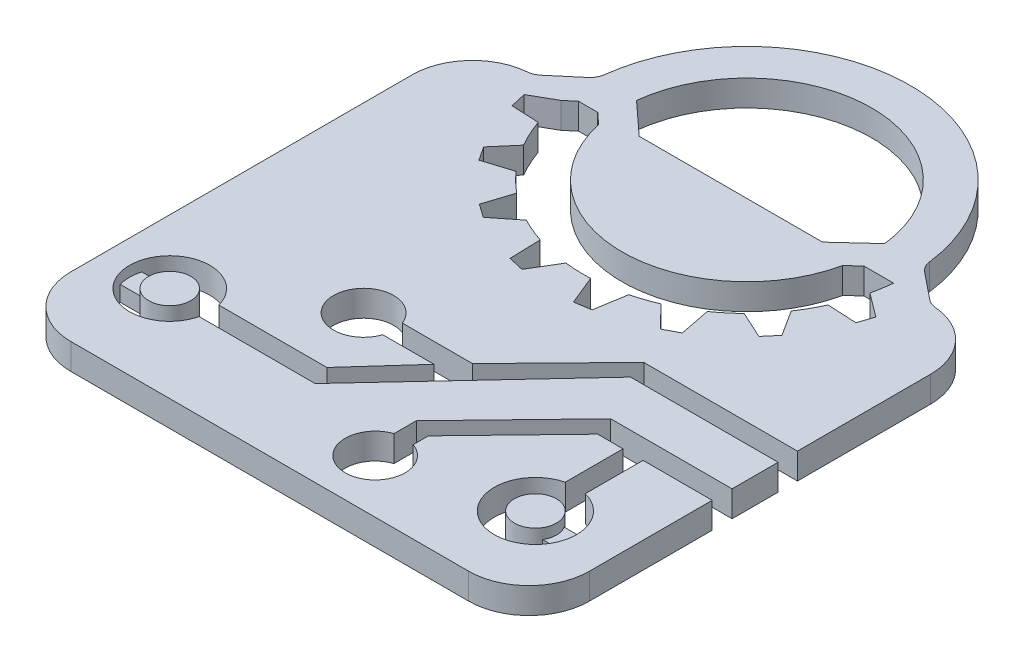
ISO-10303-21;
HEADER;
FILE_DESCRIPTION(('STEP AP214'),'2;1');
FILE_NAME('part.step','',(''),(''),'','','');
FILE_SCHEMA(('AUTOMOTIVE_DESIGN { 1 0 10303 214 1 1 1 1 }'));
ENDSEC;
DATA;
#1=APPLICATION_CONTEXT('core data for automotive mechanical design processes');
#2=APPLICATION_PROTOCOL_DEFINITION('international standard','automotive_design',2000,#1);
#3=PRODUCT_CONTEXT('',#1,'mechanical');
#4=PRODUCT('Part','Part','',(#3));
#5=PRODUCT_RELATED_PRODUCT_CATEGORY('part','',(#4));
#6=PRODUCT_DEFINITION_FORMATION('','',#4);
#7=PRODUCT_DEFINITION_CONTEXT('part definition',#1,'design');
#8=PRODUCT_DEFINITION('design','',#6,#7);
#9=PRODUCT_DEFINITION_SHAPE('','',#8);
#10=(LENGTH_UNIT() NAMED_UNIT(*) SI_UNIT(.MILLI.,.METRE.));
#11=(NAMED_UNIT(*) PLANE_ANGLE_UNIT() SI_UNIT($,.RADIAN.));
#12=(NAMED_UNIT(*) SI_UNIT($,.STERADIAN.) SOLID_ANGLE_UNIT());
#13=UNCERTAINTY_MEASURE_WITH_UNIT(LENGTH_MEASURE(1.E-05),#10,'distance_accuracy_value','');
#14=(GEOMETRIC_REPRESENTATION_CONTEXT(3) GLOBAL_UNCERTAINTY_ASSIGNED_CONTEXT((#13)) GLOBAL_UNIT_ASSIGNED_CONTEXT((#10,
#11,#12)) REPRESENTATION_CONTEXT('',''));
#15=CARTESIAN_POINT('',(0.,0.,0.));
#16=DIRECTION('',(0.,0.,1.));
#17=DIRECTION('',(1.,0.,0.));
#18=AXIS2_PLACEMENT_3D('',#15,#16,#17);
#19=CARTESIAN_POINT('',(21.6665733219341,32.5921111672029,171.415434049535));
#20=DIRECTION('',(0.,-1.,0.));
#21=DIRECTION('',(0.,0.,-1.));
#22=AXIS2_PLACEMENT_3D('',#19,#20,#21);
#23=CYLINDRICAL_SURFACE('',#22,7.91876207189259);
#24=CARTESIAN_POINT('',(21.6665733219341,30.5918111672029,171.415434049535));
#25=DIRECTION('',(0.,1.,0.));
#26=DIRECTION('',(0.,0.,1.));
#27=AXIS2_PLACEMENT_3D('',#24,#25,#26);
#28=CIRCLE('',#27,7.91876207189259);
#29=CARTESIAN_POINT('',(29.3086389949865,30.5918111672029,173.490434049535));
#30=VERTEX_POINT('',#29);
#31=CARTESIAN_POINT('',(29.3086389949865,30.5918111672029,169.340434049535));
#32=VERTEX_POINT('',#31);
#33=EDGE_CURVE('E825',#30,#32,#28,.T.);
#34=ORIENTED_EDGE('',*,*,#33,.F.);
#35=DIRECTION('',(0.,-1.,0.));
#36=VECTOR('',#35,1.);
#37=CARTESIAN_POINT('',(29.3086389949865,30.5918111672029,173.490434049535));
#38=LINE('',#37,#36);
#39=CARTESIAN_POINT('',(29.3086389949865,27.5921911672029,173.490434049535));
#40=VERTEX_POINT('',#39);
#41=EDGE_CURVE('E848',#30,#40,#38,.T.);
#42=ORIENTED_EDGE('',*,*,#41,.T.);
#43=CARTESIAN_POINT('',(21.6665733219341,27.5921911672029,171.415434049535));
#44=DIRECTION('',(0.,1.,0.));
#45=DIRECTION('',(0.,0.,1.));
#46=AXIS2_PLACEMENT_3D('',#43,#44,#45);
#47=CIRCLE('',#46,7.91876207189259);
#48=CARTESIAN_POINT('',(19.7403661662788,27.5921911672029,163.734514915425));
#49=VERTEX_POINT('',#48);
#50=EDGE_CURVE('E1146',#49,#40,#47,.T.);
#51=ORIENTED_EDGE('',*,*,#50,.F.);
#52=DIRECTION('',(0.,-1.,0.));
#53=VECTOR('',#52,1.);
#54=CARTESIAN_POINT('',(19.7403661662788,32.5921111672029,163.734514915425));
#55=LINE('',#54,#53);
#56=CARTESIAN_POINT('',(19.7403661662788,32.5921111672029,163.734514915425));
#57=VERTEX_POINT('',#56);
#58=EDGE_CURVE('E1461',#57,#49,#55,.T.);
#59=ORIENTED_EDGE('',*,*,#58,.F.);
#60=CARTESIAN_POINT('',(21.6665733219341,32.5921111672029,171.415434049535));
#61=DIRECTION('',(0.,1.,0.));
#62=DIRECTION('',(0.,0.,1.));
#63=AXIS2_PLACEMENT_3D('',#60,#61,#62);
#64=CIRCLE('',#63,7.91876207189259);
#65=CARTESIAN_POINT('',(23.5927804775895,32.5921111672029,163.734514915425));
#66=VERTEX_POINT('',#65);
#67=EDGE_CURVE('E922',#57,#66,#64,.T.);
#68=ORIENTED_EDGE('',*,*,#67,.T.);
#69=DIRECTION('',(0.,-1.,0.));
#70=VECTOR('',#69,1.);
#71=CARTESIAN_POINT('',(23.5927804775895,32.5921111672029,163.734514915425));
#72=LINE('',#71,#70);
#73=CARTESIAN_POINT('',(23.5927804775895,27.5921911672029,163.734514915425));
#74=VERTEX_POINT('',#73);
#75=EDGE_CURVE('E1463',#66,#74,#72,.T.);
#76=ORIENTED_EDGE('',*,*,#75,.T.);
#77=CARTESIAN_POINT('',(29.3086389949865,27.5921911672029,169.340434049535));
#78=VERTEX_POINT('',#77);
#79=EDGE_CURVE('E1145',#78,#74,#47,.T.);
#80=ORIENTED_EDGE('',*,*,#79,.F.);
#81=DIRECTION('',(0.,-1.,0.));
#82=VECTOR('',#81,1.);
#83=CARTESIAN_POINT('',(29.3086389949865,30.5918111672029,169.340434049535));
#84=LINE('',#83,#82);
#85=EDGE_CURVE('E834',#32,#78,#84,.T.);
#86=ORIENTED_EDGE('',*,*,#85,.F.);
#87=EDGE_LOOP('',(#34,#42,#51,#59,#68,#76,#80,#86));
#88=FACE_BOUND('',#87,.T.);
#89=ADVANCED_FACE('F273',(#88),#23,.F.);
#90=CARTESIAN_POINT('',(-50.6755759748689,32.5921111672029,169.526051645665));
#91=DIRECTION('',(0.,-1.,0.));
#92=DIRECTION('',(0.,0.,-1.));
#93=AXIS2_PLACEMENT_3D('',#90,#91,#92);
#94=CYLINDRICAL_SURFACE('',#93,7.74595383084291);
#95=CARTESIAN_POINT('',(-50.6755759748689,30.5918111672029,169.526051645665));
#96=DIRECTION('',(0.,1.,0.));
#97=DIRECTION('',(0.,0.,1.));
#98=AXIS2_PLACEMENT_3D('',#95,#96,#97);
#99=CIRCLE('',#98,7.74595383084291);
#100=CARTESIAN_POINT('',(-58.1384290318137,30.5918111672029,167.451051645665));
#101=VERTEX_POINT('',#100);
#102=CARTESIAN_POINT('',(-58.1384290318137,30.5918111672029,171.601051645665));
#103=VERTEX_POINT('',#102);
#104=EDGE_CURVE('E860',#101,#103,#99,.T.);
#105=ORIENTED_EDGE('',*,*,#104,.F.);
#106=DIRECTION('',(0.,-1.,0.));
#107=VECTOR('',#106,1.);
#108=CARTESIAN_POINT('',(-58.1384290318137,30.5918111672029,167.451051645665));
#109=LINE('',#108,#107);
#110=CARTESIAN_POINT('',(-58.1384290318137,27.5921911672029,167.451051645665));
#111=VERTEX_POINT('',#110);
#112=EDGE_CURVE('E877',#101,#111,#109,.T.);
#113=ORIENTED_EDGE('',*,*,#112,.T.);
#114=CARTESIAN_POINT('',(-50.6755759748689,27.5921911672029,169.526051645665));
#115=DIRECTION('',(0.,1.,0.));
#116=DIRECTION('',(0.,0.,1.));
#117=AXIS2_PLACEMENT_3D('',#114,#115,#116);
#118=CIRCLE('',#117,7.74595383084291);
#119=CARTESIAN_POINT('',(-43.1837020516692,27.5921911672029,167.558406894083));
#120=VERTEX_POINT('',#119);
#121=EDGE_CURVE('E1181',#120,#111,#118,.T.);
#122=ORIENTED_EDGE('',*,*,#121,.F.);
#123=DIRECTION('',(0.,-1.,0.));
#124=VECTOR('',#123,1.);
#125=CARTESIAN_POINT('',(-43.1837020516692,32.5921111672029,167.558406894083));
#126=LINE('',#125,#124);
#127=CARTESIAN_POINT('',(-43.1837020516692,32.5921111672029,167.558406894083));
#128=VERTEX_POINT('',#127);
#129=EDGE_CURVE('E1432',#128,#120,#126,.T.);
#130=ORIENTED_EDGE('',*,*,#129,.F.);
#131=CARTESIAN_POINT('',(-50.6755759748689,32.5921111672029,169.526051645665));
#132=DIRECTION('',(0.,1.,0.));
#133=DIRECTION('',(0.,0.,1.));
#134=AXIS2_PLACEMENT_3D('',#131,#132,#133);
#135=CIRCLE('',#134,7.74595383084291);
#136=CARTESIAN_POINT('',(-43.1543405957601,32.5921111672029,171.378298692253));
#137=VERTEX_POINT('',#136);
#138=EDGE_CURVE('E955',#128,#137,#135,.T.);
#139=ORIENTED_EDGE('',*,*,#138,.T.);
#140=DIRECTION('',(0.,-1.,0.));
#141=VECTOR('',#140,1.);
#142=CARTESIAN_POINT('',(-43.1543405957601,32.5921111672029,171.378298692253));
#143=LINE('',#142,#141);
#144=CARTESIAN_POINT('',(-43.1543405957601,27.5921911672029,171.378298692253));
#145=VERTEX_POINT('',#144);
#146=EDGE_CURVE('E1434',#137,#145,#143,.T.);
#147=ORIENTED_EDGE('',*,*,#146,.T.);
#148=CARTESIAN_POINT('',(-58.1384290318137,27.5921911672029,171.601051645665));
#149=VERTEX_POINT('',#148);
#150=EDGE_CURVE('E1180',#149,#145,#118,.T.);
#151=ORIENTED_EDGE('',*,*,#150,.F.);
#152=DIRECTION('',(0.,-1.,0.));
#153=VECTOR('',#152,1.);
#154=CARTESIAN_POINT('',(-58.1384290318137,30.5918111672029,171.601051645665));
#155=LINE('',#154,#153);
#156=EDGE_CURVE('E875',#103,#149,#155,.T.);
#157=ORIENTED_EDGE('',*,*,#156,.F.);
#158=EDGE_LOOP('',(#105,#113,#122,#130,#139,#147,#151,#157));
#159=FACE_BOUND('',#158,.T.);
#160=ADVANCED_FACE('F1595',(#159),#94,.F.);
#161=CARTESIAN_POINT('',(-13.1977240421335,32.5921111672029,95.8009097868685));
#162=DIRECTION('',(0.,-1.,0.));
#163=DIRECTION('',(0.,0.,-1.));
#164=AXIS2_PLACEMENT_3D('',#161,#162,#163);
#165=CYLINDRICAL_SURFACE('',#164,31.5127104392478);
#166=CARTESIAN_POINT('',(-13.1977240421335,27.5921911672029,95.8009097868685));
#167=DIRECTION('',(0.,1.,0.));
#168=DIRECTION('',(0.,0.,1.));
#169=AXIS2_PLACEMENT_3D('',#166,#167,#168);
#170=CIRCLE('',#169,31.5127104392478);
#171=CARTESIAN_POINT('',(17.5227621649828,27.5921911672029,102.822494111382));
#172=VERTEX_POINT('',#171);
#173=CARTESIAN_POINT('',(18.162815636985,27.5921911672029,98.8940425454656));
#174=VERTEX_POINT('',#173);
#175=EDGE_CURVE('E1218',#172,#174,#170,.T.);
#176=ORIENTED_EDGE('',*,*,#175,.F.);
#177=DIRECTION('',(0.,-1.,0.));
#178=VECTOR('',#177,1.);
#179=CARTESIAN_POINT('',(17.5227621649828,32.5921111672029,102.822494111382));
#180=LINE('',#179,#178);
#181=CARTESIAN_POINT('',(17.5227621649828,32.5921111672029,102.822494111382));
#182=VERTEX_POINT('',#181);
#183=EDGE_CURVE('E12',#182,#172,#180,.T.);
#184=ORIENTED_EDGE('',*,*,#183,.F.);
#185=CARTESIAN_POINT('',(-13.1977240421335,32.5921111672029,95.8009097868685));
#186=DIRECTION('',(0.,1.,0.));
#187=DIRECTION('',(0.,0.,1.));
#188=AXIS2_PLACEMENT_3D('',#185,#186,#187);
#189=CIRCLE('',#188,31.5127104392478);
#190=CARTESIAN_POINT('',(18.162815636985,32.5921111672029,98.8940425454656));
#191=VERTEX_POINT('',#190);
#192=EDGE_CURVE('E990',#182,#191,#189,.T.);
#193=ORIENTED_EDGE('',*,*,#192,.T.);
#194=DIRECTION('',(0.,-1.,0.));
#195=VECTOR('',#194,1.);
#196=CARTESIAN_POINT('',(18.162815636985,32.5921111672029,98.8940425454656));
#197=LINE('',#196,#195);
#198=EDGE_CURVE('E1331',#191,#174,#197,.T.);
#199=ORIENTED_EDGE('',*,*,#198,.T.);
#200=EDGE_LOOP('',(#176,#184,#193,#199));
#201=FACE_BOUND('',#200,.T.);
#202=ADVANCED_FACE('F1600',(#201),#165,.F.);
#203=CARTESIAN_POINT('',(9.08586433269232,32.5921111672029,96.5134979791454));
#204=DIRECTION('',(-0.598864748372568,0.,0.800850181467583));
#205=DIRECTION('',(0.800850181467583,0.,0.598864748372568));
#206=AXIS2_PLACEMENT_3D('',#203,#204,#205);
#207=PLANE('',#206);
#208=DIRECTION('',(-0.800850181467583,0.,-0.598864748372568));
#209=VECTOR('',#208,1.);
#210=CARTESIAN_POINT('',(9.08586433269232,27.5921911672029,96.5134979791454));
#211=LINE('',#210,#209);
#212=CARTESIAN_POINT('',(22.1029122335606,27.5921911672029,106.247467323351));
#213=VERTEX_POINT('',#212);
#214=EDGE_CURVE('E1221',#213,#172,#211,.T.);
#215=ORIENTED_EDGE('',*,*,#214,.F.);
#216=DIRECTION('',(0.,-1.,0.));
#217=VECTOR('',#216,1.);
#218=CARTESIAN_POINT('',(22.1029122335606,32.5921111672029,106.247467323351));
#219=LINE('',#218,#217);
#220=CARTESIAN_POINT('',(22.1029122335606,32.5921111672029,106.247467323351));
#221=VERTEX_POINT('',#220);
#222=EDGE_CURVE('E282',#221,#213,#219,.T.);
#223=ORIENTED_EDGE('',*,*,#222,.F.);
#224=DIRECTION('',(-0.800850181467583,0.,-0.598864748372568));
#225=VECTOR('',#224,1.);
#226=CARTESIAN_POINT('',(9.08586433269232,32.5921111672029,96.5134979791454));
#227=LINE('',#226,#225);
#228=EDGE_CURVE('E993',#221,#182,#227,.T.);
#229=ORIENTED_EDGE('',*,*,#228,.T.);
#230=ORIENTED_EDGE('',*,*,#183,.T.);
#231=EDGE_LOOP('',(#215,#223,#229,#230));
#232=FACE_BOUND('',#231,.T.);
#233=ADVANCED_FACE('F2166',(#232),#207,.T.);
#234=CARTESIAN_POINT('',(12.6087502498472,32.5921111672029,134.659787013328));
#235=DIRECTION('',(-0.948448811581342,0.,-0.316930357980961));
#236=DIRECTION('',(-0.316930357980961,0.,0.948448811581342));
#237=AXIS2_PLACEMENT_3D('',#234,#235,#236);
#238=PLANE('',#237);
#239=DIRECTION('',(0.316930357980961,0.,-0.948448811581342));
#240=VECTOR('',#239,1.);
#241=CARTESIAN_POINT('',(12.6087502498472,27.5921911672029,134.659787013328));
#242=LINE('',#241,#240);
#243=CARTESIAN_POINT('',(21.1388979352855,27.5921911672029,109.13238570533));
#244=VERTEX_POINT('',#243);
#245=EDGE_CURVE('E1224',#244,#213,#242,.T.);
#246=ORIENTED_EDGE('',*,*,#245,.F.);
#247=DIRECTION('',(0.,-1.,0.));
#248=VECTOR('',#247,1.);
#249=CARTESIAN_POINT('',(21.1388979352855,32.5921111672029,109.13238570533));
#250=LINE('',#249,#248);
#251=CARTESIAN_POINT('',(21.1388979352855,32.5921111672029,109.13238570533));
#252=VERTEX_POINT('',#251);
#253=EDGE_CURVE('E1403',#252,#244,#250,.T.);
#254=ORIENTED_EDGE('',*,*,#253,.F.);
#255=DIRECTION('',(0.316930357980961,0.,-0.948448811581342));
#256=VECTOR('',#255,1.);
#257=CARTESIAN_POINT('',(12.6087502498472,32.5921111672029,134.659787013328));
#258=LINE('',#257,#256);
#259=EDGE_CURVE('E996',#252,#221,#258,.T.);
#260=ORIENTED_EDGE('',*,*,#259,.T.);
#261=ORIENTED_EDGE('',*,*,#222,.T.);
#262=EDGE_LOOP('',(#246,#254,#260,#261));
#263=FACE_BOUND('',#262,.T.);
#264=ADVANCED_FACE('F2156',(#263),#238,.T.);
#265=CARTESIAN_POINT('',(-12.0806039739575,32.5921111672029,107.437614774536));
#266=DIRECTION('',(0.0509510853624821,0.,-0.998701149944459));
#267=DIRECTION('',(-0.998701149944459,0.,-0.0509510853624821));
#268=AXIS2_PLACEMENT_3D('',#265,#266,#267);
#269=PLANE('',#268);
#270=DIRECTION('',(0.998701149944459,0.,0.0509510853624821));
#271=VECTOR('',#270,1.);
#272=CARTESIAN_POINT('',(-12.0806039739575,27.5921911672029,107.437614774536));
#273=LINE('',#272,#271);
#274=CARTESIAN_POINT('',(15.4889463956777,27.5921911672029,108.844140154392));
#275=VERTEX_POINT('',#274);
#276=EDGE_CURVE('E1227',#275,#244,#273,.T.);
#277=ORIENTED_EDGE('',*,*,#276,.F.);
#278=DIRECTION('',(0.,-1.,0.));
#279=VECTOR('',#278,1.);
#280=CARTESIAN_POINT('',(15.4889463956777,32.5921111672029,108.844140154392));
#281=LINE('',#280,#279);
#282=CARTESIAN_POINT('',(15.4889463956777,32.5921111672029,108.844140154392));
#283=VERTEX_POINT('',#282);
#284=EDGE_CURVE('E1401',#283,#275,#281,.T.);
#285=ORIENTED_EDGE('',*,*,#284,.F.);
#286=DIRECTION('',(0.998701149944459,0.,0.0509510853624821));
#287=VECTOR('',#286,1.);
#288=CARTESIAN_POINT('',(-12.0806039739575,32.5921111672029,107.437614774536));
#289=LINE('',#288,#287);
#290=EDGE_CURVE('E999',#283,#252,#289,.T.);
#291=ORIENTED_EDGE('',*,*,#290,.T.);
#292=ORIENTED_EDGE('',*,*,#253,.T.);
#293=EDGE_LOOP('',(#277,#285,#291,#292));
#294=FACE_BOUND('',#293,.T.);
#295=ADVANCED_FACE('F2146',(#294),#269,.T.);
#296=CARTESIAN_POINT('',(-13.1977240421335,32.5921111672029,95.8009097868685));
#297=DIRECTION('',(0.,-1.,0.));
#298=DIRECTION('',(0.,0.,-1.));
#299=AXIS2_PLACEMENT_3D('',#296,#297,#298);
#300=CYLINDRICAL_SURFACE('',#299,31.5127104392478);
#301=CARTESIAN_POINT('',(-13.1977240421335,27.5921911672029,95.8009097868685));
#302=DIRECTION('',(0.,1.,0.));
#303=DIRECTION('',(0.,0.,1.));
#304=AXIS2_PLACEMENT_3D('',#301,#302,#303);
#305=CIRCLE('',#304,31.5127104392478);
#306=CARTESIAN_POINT('',(12.9467753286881,27.5921911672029,113.393978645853));
#307=VERTEX_POINT('',#306);
#308=EDGE_CURVE('E1230',#307,#275,#305,.T.);
#309=ORIENTED_EDGE('',*,*,#308,.F.);
#310=DIRECTION('',(0.,-1.,0.));
#311=VECTOR('',#310,1.);
#312=CARTESIAN_POINT('',(12.9467753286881,32.5921111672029,113.393978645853));
#313=LINE('',#312,#311);
#314=CARTESIAN_POINT('',(12.9467753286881,32.5921111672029,113.393978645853));
#315=VERTEX_POINT('',#314);
#316=EDGE_CURVE('E1399',#315,#307,#313,.T.);
#317=ORIENTED_EDGE('',*,*,#316,.F.);
#318=CARTESIAN_POINT('',(-13.1977240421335,32.5921111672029,95.8009097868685));
#319=DIRECTION('',(0.,1.,0.));
#320=DIRECTION('',(0.,0.,1.));
#321=AXIS2_PLACEMENT_3D('',#318,#319,#320);
#322=CIRCLE('',#321,31.5127104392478);
#323=EDGE_CURVE('E1002',#315,#283,#322,.T.);
#324=ORIENTED_EDGE('',*,*,#323,.T.);
#325=ORIENTED_EDGE('',*,*,#284,.T.);
#326=EDGE_LOOP('',(#309,#317,#324,#325));
#327=FACE_BOUND('',#326,.T.);
#328=ADVANCED_FACE('F2136',(#327),#300,.F.);
#329=CARTESIAN_POINT('',(11.210203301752,32.5921111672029,110.665012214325));
#330=DIRECTION('',(-0.843667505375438,0.,0.536866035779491));
#331=DIRECTION('',(0.536866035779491,0.,0.843667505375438));
#332=AXIS2_PLACEMENT_3D('',#329,#330,#331);
#333=PLANE('',#332);
#334=DIRECTION('',(-0.536866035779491,0.,-0.843667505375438));
#335=VECTOR('',#334,1.);
#336=CARTESIAN_POINT('',(11.210203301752,27.5921911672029,110.665012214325));
#337=LINE('',#336,#335);
#338=CARTESIAN_POINT('',(16.1119081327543,27.5921911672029,118.367881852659));
#339=VERTEX_POINT('',#338);
#340=EDGE_CURVE('E1233',#339,#307,#337,.T.);
#341=ORIENTED_EDGE('',*,*,#340,.F.);
#342=DIRECTION('',(0.,-1.,0.));
#343=VECTOR('',#342,1.);
#344=CARTESIAN_POINT('',(16.1119081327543,32.5921111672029,118.367881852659));
#345=LINE('',#344,#343);
#346=CARTESIAN_POINT('',(16.1119081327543,32.5921111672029,118.367881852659));
#347=VERTEX_POINT('',#346);
#348=EDGE_CURVE('E1397',#347,#339,#345,.T.);
#349=ORIENTED_EDGE('',*,*,#348,.F.);
#350=DIRECTION('',(-0.536866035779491,0.,-0.843667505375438));
#351=VECTOR('',#350,1.);
#352=CARTESIAN_POINT('',(11.210203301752,32.5921111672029,110.665012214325));
#353=LINE('',#352,#351);
#354=EDGE_CURVE('E1005',#347,#315,#353,.T.);
#355=ORIENTED_EDGE('',*,*,#354,.T.);
#356=ORIENTED_EDGE('',*,*,#316,.T.);
#357=EDGE_LOOP('',(#341,#349,#355,#356));
#358=FACE_BOUND('',#357,.T.);
#359=ADVANCED_FACE('F2126',(#358),#333,.T.);
#360=CARTESIAN_POINT('',(0.0710121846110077,32.5921111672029,137.233202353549));
#361=DIRECTION('',(-0.761832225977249,0.,-0.647774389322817));
#362=DIRECTION('',(-0.647774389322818,0.,0.76183222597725));
#363=AXIS2_PLACEMENT_3D('',#360,#361,#362);
#364=PLANE('',#363);
#365=DIRECTION('',(0.647774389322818,0.,-0.76183222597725));
#366=VECTOR('',#365,1.);
#367=CARTESIAN_POINT('',(0.0710121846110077,27.5921911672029,137.233202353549));
#368=LINE('',#367,#366);
#369=CARTESIAN_POINT('',(14.0769132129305,27.5921911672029,120.76119152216));
#370=VERTEX_POINT('',#369);
#371=EDGE_CURVE('E1236',#370,#339,#368,.T.);
#372=ORIENTED_EDGE('',*,*,#371,.F.);
#373=DIRECTION('',(0.,-1.,0.));
#374=VECTOR('',#373,1.);
#375=CARTESIAN_POINT('',(14.0769132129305,32.5921111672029,120.76119152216));
#376=LINE('',#375,#374);
#377=CARTESIAN_POINT('',(14.0769132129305,32.5921111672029,120.76119152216));
#378=VERTEX_POINT('',#377);
#379=EDGE_CURVE('E1395',#378,#370,#376,.T.);
#380=ORIENTED_EDGE('',*,*,#379,.F.);
#381=DIRECTION('',(0.647774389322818,0.,-0.76183222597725));
#382=VECTOR('',#381,1.);
#383=CARTESIAN_POINT('',(0.0710121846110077,32.5921111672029,137.233202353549));
#384=LINE('',#383,#382);
#385=EDGE_CURVE('E1008',#378,#347,#384,.T.);
#386=ORIENTED_EDGE('',*,*,#385,.T.);
#387=ORIENTED_EDGE('',*,*,#348,.T.);
#388=EDGE_LOOP('',(#372,#380,#386,#387));
#389=FACE_BOUND('',#388,.T.);
#390=ADVANCED_FACE('F2116',(#389),#364,.T.);
#391=CARTESIAN_POINT('',(-6.29421728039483,32.5921111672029,111.411208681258));
#392=DIRECTION('',(0.417141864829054,0.,-0.908841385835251));
#393=DIRECTION('',(-0.908841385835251,0.,-0.417141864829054));
#394=AXIS2_PLACEMENT_3D('',#391,#392,#393);
#395=PLANE('',#394);
#396=DIRECTION('',(0.908841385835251,0.,0.417141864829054));
#397=VECTOR('',#396,1.);
#398=CARTESIAN_POINT('',(-6.29421728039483,27.5921911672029,111.411208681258));
#399=LINE('',#398,#397);
#400=CARTESIAN_POINT('',(8.81819420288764,27.5921911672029,118.3475339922));
#401=VERTEX_POINT('',#400);
#402=EDGE_CURVE('E1239',#401,#370,#399,.T.);
#403=ORIENTED_EDGE('',*,*,#402,.F.);
#404=DIRECTION('',(0.,-1.,0.));
#405=VECTOR('',#404,1.);
#406=CARTESIAN_POINT('',(8.81819420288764,32.5921111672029,118.3475339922));
#407=LINE('',#406,#405);
#408=CARTESIAN_POINT('',(8.81819420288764,32.5921111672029,118.3475339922));
#409=VERTEX_POINT('',#408);
#410=EDGE_CURVE('E1393',#409,#401,#407,.T.);
#411=ORIENTED_EDGE('',*,*,#410,.F.);
#412=DIRECTION('',(0.908841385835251,0.,0.417141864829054));
#413=VECTOR('',#412,1.);
#414=CARTESIAN_POINT('',(-6.29421728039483,32.5921111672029,111.411208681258));
#415=LINE('',#414,#413);
#416=EDGE_CURVE('E1011',#409,#378,#415,.T.);
#417=ORIENTED_EDGE('',*,*,#416,.T.);
#418=ORIENTED_EDGE('',*,*,#379,.T.);
#419=EDGE_LOOP('',(#403,#411,#417,#418));
#420=FACE_BOUND('',#419,.T.);
#421=ADVANCED_FACE('F2106',(#420),#395,.T.);
#422=CARTESIAN_POINT('',(-13.1977240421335,32.5921111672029,95.8009097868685));
#423=DIRECTION('',(0.,-1.,0.));
#424=DIRECTION('',(0.,0.,-1.));
#425=AXIS2_PLACEMENT_3D('',#422,#423,#424);
#426=CYLINDRICAL_SURFACE('',#425,31.5127104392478);
#427=CARTESIAN_POINT('',(-13.1977240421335,27.5921911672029,95.8009097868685));
#428=DIRECTION('',(0.,1.,0.));
#429=DIRECTION('',(0.,0.,1.));
#430=AXIS2_PLACEMENT_3D('',#427,#428,#429);
#431=CIRCLE('',#430,31.5127104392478);
#432=CARTESIAN_POINT('',(4.94021488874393,27.5921911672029,121.57038961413));
#433=VERTEX_POINT('',#432);
#434=EDGE_CURVE('E1242',#433,#401,#431,.T.);
#435=ORIENTED_EDGE('',*,*,#434,.F.);
#436=DIRECTION('',(0.,-1.,0.));
#437=VECTOR('',#436,1.);
#438=CARTESIAN_POINT('',(4.94021488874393,32.5921111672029,121.57038961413));
#439=LINE('',#438,#437);
#440=CARTESIAN_POINT('',(4.94021488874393,32.5921111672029,121.57038961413));
#441=VERTEX_POINT('',#440);
#442=EDGE_CURVE('E1391',#441,#433,#439,.T.);
#443=ORIENTED_EDGE('',*,*,#442,.F.);
#444=CARTESIAN_POINT('',(-13.1977240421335,32.5921111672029,95.8009097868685));
#445=DIRECTION('',(0.,1.,0.));
#446=DIRECTION('',(0.,0.,1.));
#447=AXIS2_PLACEMENT_3D('',#444,#445,#446);
#448=CIRCLE('',#447,31.5127104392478);
#449=EDGE_CURVE('E1014',#441,#409,#448,.T.);
#450=ORIENTED_EDGE('',*,*,#449,.T.);
#451=ORIENTED_EDGE('',*,*,#410,.T.);
#452=EDGE_LOOP('',(#435,#443,#450,#451));
#453=FACE_BOUND('',#452,.T.);
#454=ADVANCED_FACE('F2096',(#453),#426,.F.);
#455=CARTESIAN_POINT('',(5.12719857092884,32.5921111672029,122.521462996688));
#456=DIRECTION('',(-0.981216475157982,0.,0.192909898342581));
#457=DIRECTION('',(0.192909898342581,0.,0.981216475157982));
#458=AXIS2_PLACEMENT_3D('',#455,#456,#457);
#459=PLANE('',#458);
#460=DIRECTION('',(-0.192909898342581,0.,-0.981216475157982));
#461=VECTOR('',#460,1.);
#462=CARTESIAN_POINT('',(5.12719857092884,27.5921911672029,122.521462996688));
#463=LINE('',#462,#461);
#464=CARTESIAN_POINT('',(6.1187759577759,27.5921911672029,127.565019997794));
#465=VERTEX_POINT('',#464);
#466=EDGE_CURVE('E1245',#465,#433,#463,.T.);
#467=ORIENTED_EDGE('',*,*,#466,.F.);
#468=DIRECTION('',(0.,-1.,0.));
#469=VECTOR('',#468,1.);
#470=CARTESIAN_POINT('',(6.1187759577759,32.5921111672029,127.565019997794));
#471=LINE('',#470,#469);
#472=CARTESIAN_POINT('',(6.1187759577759,32.5921111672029,127.565019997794));
#473=VERTEX_POINT('',#472);
#474=EDGE_CURVE('E1389',#473,#465,#471,.T.);
#475=ORIENTED_EDGE('',*,*,#474,.F.);
#476=DIRECTION('',(-0.192909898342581,0.,-0.981216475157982));
#477=VECTOR('',#476,1.);
#478=CARTESIAN_POINT('',(5.12719857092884,32.5921111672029,122.521462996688));
#479=LINE('',#478,#477);
#480=EDGE_CURVE('E1017',#473,#441,#479,.T.);
#481=ORIENTED_EDGE('',*,*,#480,.T.);
#482=ORIENTED_EDGE('',*,*,#442,.T.);
#483=EDGE_LOOP('',(#467,#475,#481,#482));
#484=FACE_BOUND('',#483,.T.);
#485=ADVANCED_FACE('F2086',(#484),#459,.T.);
#486=CARTESIAN_POINT('',(-8.23705233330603,32.5921111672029,135.157942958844));
#487=DIRECTION('',(-0.467540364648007,0.,-0.883971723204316));
#488=DIRECTION('',(-0.883971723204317,0.,0.467540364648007));
#489=AXIS2_PLACEMENT_3D('',#486,#487,#488);
#490=PLANE('',#489);
#491=DIRECTION('',(0.883971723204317,0.,-0.467540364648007));
#492=VECTOR('',#491,1.);
#493=CARTESIAN_POINT('',(-8.23705233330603,27.5921911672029,135.157942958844));
#494=LINE('',#493,#492);
#495=CARTESIAN_POINT('',(3.36909807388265,27.5921911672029,129.01934864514));
#496=VERTEX_POINT('',#495);
#497=EDGE_CURVE('E1248',#496,#465,#494,.T.);
#498=ORIENTED_EDGE('',*,*,#497,.F.);
#499=DIRECTION('',(0.,-1.,0.));
#500=VECTOR('',#499,1.);
#501=CARTESIAN_POINT('',(3.36909807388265,32.5921111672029,129.01934864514));
#502=LINE('',#501,#500);
#503=CARTESIAN_POINT('',(3.36909807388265,32.5921111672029,129.01934864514));
#504=VERTEX_POINT('',#503);
#505=EDGE_CURVE('E1387',#504,#496,#502,.T.);
#506=ORIENTED_EDGE('',*,*,#505,.F.);
#507=DIRECTION('',(0.883971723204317,0.,-0.467540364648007));
#508=VECTOR('',#507,1.);
#509=CARTESIAN_POINT('',(-8.23705233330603,32.5921111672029,135.157942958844));
#510=LINE('',#509,#508);
#511=EDGE_CURVE('E1020',#504,#473,#510,.T.);
#512=ORIENTED_EDGE('',*,*,#511,.T.);
#513=ORIENTED_EDGE('',*,*,#474,.T.);
#514=EDGE_LOOP('',(#498,#506,#512,#513));
#515=FACE_BOUND('',#514,.T.);
#516=ADVANCED_FACE('F2076',(#515),#490,.T.);
#517=CARTESIAN_POINT('',(-6.1135577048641,32.5921111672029,119.324425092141));
#518=DIRECTION('',(0.714889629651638,0.,-0.699237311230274));
#519=DIRECTION('',(-0.699237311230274,0.,-0.714889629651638));
#520=AXIS2_PLACEMENT_3D('',#517,#518,#519);
#521=PLANE('',#520);
#522=DIRECTION('',(0.699237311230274,0.,0.714889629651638));
#523=VECTOR('',#522,1.);
#524=CARTESIAN_POINT('',(-6.1135577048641,27.5921911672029,119.324425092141));
#525=LINE('',#524,#523);
#526=CARTESIAN_POINT('',(-0.789330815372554,27.5921911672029,124.767833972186));
#527=VERTEX_POINT('',#526);
#528=EDGE_CURVE('E1251',#527,#496,#525,.T.);
#529=ORIENTED_EDGE('',*,*,#528,.F.);
#530=DIRECTION('',(0.,-1.,0.));
#531=VECTOR('',#530,1.);
#532=CARTESIAN_POINT('',(-0.789330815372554,32.5921111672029,124.767833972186));
#533=LINE('',#532,#531);
#534=CARTESIAN_POINT('',(-0.789330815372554,32.5921111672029,124.767833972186));
#535=VERTEX_POINT('',#534);
#536=EDGE_CURVE('E1385',#535,#527,#533,.T.);
#537=ORIENTED_EDGE('',*,*,#536,.F.);
#538=DIRECTION('',(0.699237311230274,0.,0.714889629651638));
#539=VECTOR('',#538,1.);
#540=CARTESIAN_POINT('',(-6.1135577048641,32.5921111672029,119.324425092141));
#541=LINE('',#540,#539);
#542=EDGE_CURVE('E1023',#535,#504,#541,.T.);
#543=ORIENTED_EDGE('',*,*,#542,.T.);
#544=ORIENTED_EDGE('',*,*,#505,.T.);
#545=EDGE_LOOP('',(#529,#537,#543,#544));
#546=FACE_BOUND('',#545,.T.);
#547=ADVANCED_FACE('F2066',(#546),#521,.T.);
#548=CARTESIAN_POINT('',(-13.1977240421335,32.5921111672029,95.8009097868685));
#549=DIRECTION('',(0.,-1.,0.));
#550=DIRECTION('',(0.,0.,-1.));
#551=AXIS2_PLACEMENT_3D('',#548,#549,#550);
#552=CYLINDRICAL_SURFACE('',#551,31.5127104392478);
#553=CARTESIAN_POINT('',(-13.1977240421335,27.5921911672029,95.8009097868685));
#554=DIRECTION('',(0.,1.,0.));
#555=DIRECTION('',(0.,0.,1.));
#556=AXIS2_PLACEMENT_3D('',#553,#554,#555);
#557=CIRCLE('',#556,31.5127104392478);
#558=CARTESIAN_POINT('',(-5.42453238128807,27.5921911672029,126.339875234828));
#559=VERTEX_POINT('',#558);
#560=EDGE_CURVE('E1254',#559,#527,#557,.T.);
#561=ORIENTED_EDGE('',*,*,#560,.F.);
#562=DIRECTION('',(0.,-1.,0.));
#563=VECTOR('',#562,1.);
#564=CARTESIAN_POINT('',(-5.42453238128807,32.5921111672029,126.339875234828));
#565=LINE('',#564,#563);
#566=CARTESIAN_POINT('',(-5.42453238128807,32.5921111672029,126.339875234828));
#567=VERTEX_POINT('',#566);
#568=EDGE_CURVE('E1383',#567,#559,#565,.T.);
#569=ORIENTED_EDGE('',*,*,#568,.F.);
#570=CARTESIAN_POINT('',(-13.1977240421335,32.5921111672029,95.8009097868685));
#571=DIRECTION('',(0.,1.,0.));
#572=DIRECTION('',(0.,0.,1.));
#573=AXIS2_PLACEMENT_3D('',#570,#571,#572);
#574=CIRCLE('',#573,31.5127104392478);
#575=EDGE_CURVE('E1026',#567,#535,#574,.T.);
#576=ORIENTED_EDGE('',*,*,#575,.T.);
#577=ORIENTED_EDGE('',*,*,#536,.T.);
#578=EDGE_LOOP('',(#561,#569,#576,#577));
#579=FACE_BOUND('',#578,.T.);
#580=ADVANCED_FACE('F2056',(#579),#552,.F.);
#581=CARTESIAN_POINT('',(-5.5852463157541,32.5921111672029,127.316791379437));
#582=DIRECTION('',(-0.986736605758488,0.,-0.162329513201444));
#583=DIRECTION('',(-0.162329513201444,0.,0.986736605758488));
#584=AXIS2_PLACEMENT_3D('',#581,#582,#583);
#585=PLANE('',#584);
#586=DIRECTION('',(0.162329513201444,0.,-0.986736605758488));
#587=VECTOR('',#586,1.);
#588=CARTESIAN_POINT('',(-5.5852463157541,27.5921911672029,127.316791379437));
#589=LINE('',#588,#587);
#590=CARTESIAN_POINT('',(-6.42019918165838,27.5921911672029,132.39213806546));
#591=VERTEX_POINT('',#590);
#592=EDGE_CURVE('E1257',#591,#559,#589,.T.);
#593=ORIENTED_EDGE('',*,*,#592,.F.);
#594=DIRECTION('',(0.,-1.,0.));
#595=VECTOR('',#594,1.);
#596=CARTESIAN_POINT('',(-6.42019918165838,32.5921111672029,132.39213806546));
#597=LINE('',#596,#595);
#598=CARTESIAN_POINT('',(-6.42019918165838,32.5921111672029,132.39213806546));
#599=VERTEX_POINT('',#598);
#600=EDGE_CURVE('E1381',#599,#591,#597,.T.);
#601=ORIENTED_EDGE('',*,*,#600,.F.);
#602=DIRECTION('',(0.162329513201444,0.,-0.986736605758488));
#603=VECTOR('',#602,1.);
#604=CARTESIAN_POINT('',(-5.5852463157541,32.5921111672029,127.316791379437));
#605=LINE('',#604,#603);
#606=EDGE_CURVE('E1029',#599,#567,#605,.T.);
#607=ORIENTED_EDGE('',*,*,#606,.T.);
#608=ORIENTED_EDGE('',*,*,#568,.T.);
#609=EDGE_LOOP('',(#593,#601,#607,#608));
#610=FACE_BOUND('',#609,.T.);
#611=ADVANCED_FACE('F2046',(#610),#585,.T.);
#612=CARTESIAN_POINT('',(-11.8809014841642,32.5921111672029,133.268233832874));
#613=DIRECTION('',(-0.158410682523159,0.,-0.987373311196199));
#614=DIRECTION('',(-0.987373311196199,0.,0.158410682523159));
#615=AXIS2_PLACEMENT_3D('',#612,#613,#614);
#616=PLANE('',#615);
#617=DIRECTION('',(0.987373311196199,0.,-0.158410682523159));
#618=VECTOR('',#617,1.);
#619=CARTESIAN_POINT('',(-11.8809014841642,27.5921911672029,133.268233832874));
#620=LINE('',#619,#618);
#621=CARTESIAN_POINT('',(-9.52132357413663,27.5921911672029,132.88967149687));
#622=VERTEX_POINT('',#621);
#623=EDGE_CURVE('E1260',#622,#591,#620,.T.);
#624=ORIENTED_EDGE('',*,*,#623,.F.);
#625=DIRECTION('',(0.,-1.,0.));
#626=VECTOR('',#625,1.);
#627=CARTESIAN_POINT('',(-9.52132357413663,32.5921111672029,132.88967149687));
#628=LINE('',#627,#626);
#629=CARTESIAN_POINT('',(-9.52132357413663,32.5921111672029,132.88967149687));
#630=VERTEX_POINT('',#629);
#631=EDGE_CURVE('E1379',#630,#622,#628,.T.);
#632=ORIENTED_EDGE('',*,*,#631,.F.);
#633=DIRECTION('',(0.987373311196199,0.,-0.158410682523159));
#634=VECTOR('',#633,1.);
#635=CARTESIAN_POINT('',(-11.8809014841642,32.5921111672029,133.268233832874));
#636=LINE('',#635,#634);
#637=EDGE_CURVE('E1032',#630,#599,#636,.T.);
#638=ORIENTED_EDGE('',*,*,#637,.T.);
#639=ORIENTED_EDGE('',*,*,#600,.T.);
#640=EDGE_LOOP('',(#624,#632,#638,#639));
#641=FACE_BOUND('',#640,.T.);
#642=ADVANCED_FACE('F2036',(#641),#616,.T.);
#643=CARTESIAN_POINT('',(-12.4149920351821,32.5921111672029,125.838348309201));
#644=DIRECTION('',(0.925130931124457,0.,-0.379648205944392));
#645=DIRECTION('',(-0.379648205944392,0.,-0.925130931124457));
#646=AXIS2_PLACEMENT_3D('',#643,#644,#645);
#647=PLANE('',#646);
#648=DIRECTION('',(0.379648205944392,0.,0.925130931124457));
#649=VECTOR('',#648,1.);
#650=CARTESIAN_POINT('',(-12.4149920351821,27.5921911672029,125.838348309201));
#651=LINE('',#650,#649);
#652=CARTESIAN_POINT('',(-11.8219118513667,27.5921911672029,127.283572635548));
#653=VERTEX_POINT('',#652);
#654=EDGE_CURVE('E1263',#653,#622,#651,.T.);
#655=ORIENTED_EDGE('',*,*,#654,.F.);
#656=DIRECTION('',(0.,-1.,0.));
#657=VECTOR('',#656,1.);
#658=CARTESIAN_POINT('',(-11.8219118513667,32.5921111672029,127.283572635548));
#659=LINE('',#658,#657);
#660=CARTESIAN_POINT('',(-11.8219118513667,32.5921111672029,127.283572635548));
#661=VERTEX_POINT('',#660);
#662=EDGE_CURVE('E1377',#661,#653,#659,.T.);
#663=ORIENTED_EDGE('',*,*,#662,.F.);
#664=DIRECTION('',(0.379648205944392,0.,0.925130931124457));
#665=VECTOR('',#664,1.);
#666=CARTESIAN_POINT('',(-12.4149920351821,32.5921111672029,125.838348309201));
#667=LINE('',#666,#665);
#668=EDGE_CURVE('E1035',#661,#630,#667,.T.);
#669=ORIENTED_EDGE('',*,*,#668,.T.);
#670=ORIENTED_EDGE('',*,*,#631,.T.);
#671=EDGE_LOOP('',(#655,#663,#669,#670));
#672=FACE_BOUND('',#671,.T.);
#673=ADVANCED_FACE('F2026',(#672),#647,.T.);
#674=CARTESIAN_POINT('',(-13.1977240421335,32.5921111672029,95.8009097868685));
#675=DIRECTION('',(0.,-1.,0.));
#676=DIRECTION('',(0.,0.,-1.));
#677=AXIS2_PLACEMENT_3D('',#674,#675,#676);
#678=CYLINDRICAL_SURFACE('',#677,31.5127104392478);
#679=CARTESIAN_POINT('',(-13.1977240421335,27.5921911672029,95.8009097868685));
#680=DIRECTION('',(0.,1.,0.));
#681=DIRECTION('',(0.,0.,1.));
#682=AXIS2_PLACEMENT_3D('',#679,#680,#681);
#683=CIRCLE('',#682,31.5127104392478);
#684=CARTESIAN_POINT('',(-16.7715414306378,27.5921911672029,127.11031330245));
#685=VERTEX_POINT('',#684);
#686=EDGE_CURVE('E1266',#685,#653,#683,.T.);
#687=ORIENTED_EDGE('',*,*,#686,.F.);
#688=DIRECTION('',(0.,-1.,0.));
#689=VECTOR('',#688,1.);
#690=CARTESIAN_POINT('',(-16.7715414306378,32.5921111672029,127.11031330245));
#691=LINE('',#690,#689);
#692=CARTESIAN_POINT('',(-16.7715414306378,32.5921111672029,127.11031330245));
#693=VERTEX_POINT('',#692);
#694=EDGE_CURVE('E1375',#693,#685,#691,.T.);
#695=ORIENTED_EDGE('',*,*,#694,.F.);
#696=CARTESIAN_POINT('',(-13.1977240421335,32.5921111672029,95.8009097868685));
#697=DIRECTION('',(0.,1.,0.));
#698=DIRECTION('',(0.,0.,1.));
#699=AXIS2_PLACEMENT_3D('',#696,#697,#698);
#700=CIRCLE('',#699,31.5127104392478);
#701=EDGE_CURVE('E1038',#693,#661,#700,.T.);
#702=ORIENTED_EDGE('',*,*,#701,.T.);
#703=ORIENTED_EDGE('',*,*,#662,.T.);
#704=EDGE_LOOP('',(#687,#695,#702,#703));
#705=FACE_BOUND('',#704,.T.);
#706=ADVANCED_FACE('F2016',(#705),#678,.F.);
#707=CARTESIAN_POINT('',(-15.3302835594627,32.5921111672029,124.711170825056));
#708=DIRECTION('',(-0.857213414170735,0.,-0.514961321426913));
#709=DIRECTION('',(-0.514961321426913,0.,0.857213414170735));
#710=AXIS2_PLACEMENT_3D('',#707,#708,#709);
#711=PLANE('',#710);
#712=DIRECTION('',(0.514961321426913,0.,-0.857213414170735));
#713=VECTOR('',#712,1.);
#714=CARTESIAN_POINT('',(-15.3302835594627,27.5921911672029,124.711170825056));
#715=LINE('',#714,#713);
#716=CARTESIAN_POINT('',(-19.9445382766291,27.5921911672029,132.39213806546));
#717=VERTEX_POINT('',#716);
#718=EDGE_CURVE('E1269',#717,#685,#715,.T.);
#719=ORIENTED_EDGE('',*,*,#718,.F.);
#720=DIRECTION('',(0.,-1.,0.));
#721=VECTOR('',#720,1.);
#722=CARTESIAN_POINT('',(-19.9445382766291,32.5921111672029,132.39213806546));
#723=LINE('',#722,#721);
#724=CARTESIAN_POINT('',(-19.9445382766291,32.5921111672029,132.39213806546));
#725=VERTEX_POINT('',#724);
#726=EDGE_CURVE('E1373',#725,#717,#723,.T.);
#727=ORIENTED_EDGE('',*,*,#726,.F.);
#728=DIRECTION('',(0.514961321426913,0.,-0.857213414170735));
#729=VECTOR('',#728,1.);
#730=CARTESIAN_POINT('',(-15.3302835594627,32.5921111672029,124.711170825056));
#731=LINE('',#730,#729);
#732=EDGE_CURVE('E1041',#725,#693,#731,.T.);
#733=ORIENTED_EDGE('',*,*,#732,.T.);
#734=ORIENTED_EDGE('',*,*,#694,.T.);
#735=EDGE_LOOP('',(#719,#727,#733,#734));
#736=FACE_BOUND('',#735,.T.);
#737=ADVANCED_FACE('F2006',(#736),#711,.T.);
#738=CARTESIAN_POINT('',(-14.7168464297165,32.5921111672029,133.569760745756));
#739=DIRECTION('',(0.219759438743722,0.,-0.975554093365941));
#740=DIRECTION('',(-0.975554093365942,0.,-0.219759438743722));
#741=AXIS2_PLACEMENT_3D('',#738,#739,#740);
#742=PLANE('',#741);
#743=DIRECTION('',(0.975554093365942,0.,0.219759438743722));
#744=VECTOR('',#743,1.);
#745=CARTESIAN_POINT('',(-14.7168464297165,27.5921911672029,133.569760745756));
#746=LINE('',#745,#744);
#747=CARTESIAN_POINT('',(-22.9221179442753,27.5921911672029,131.721389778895));
#748=VERTEX_POINT('',#747);
#749=EDGE_CURVE('E1272',#748,#717,#746,.T.);
#750=ORIENTED_EDGE('',*,*,#749,.F.);
#751=DIRECTION('',(0.,-1.,0.));
#752=VECTOR('',#751,1.);
#753=CARTESIAN_POINT('',(-22.9221179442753,32.5921111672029,131.721389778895));
#754=LINE('',#753,#752);
#755=CARTESIAN_POINT('',(-22.9221179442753,32.5921111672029,131.721389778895));
#756=VERTEX_POINT('',#755);
#757=EDGE_CURVE('E1371',#756,#748,#754,.T.);
#758=ORIENTED_EDGE('',*,*,#757,.F.);
#759=DIRECTION('',(0.975554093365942,0.,0.219759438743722));
#760=VECTOR('',#759,1.);
#761=CARTESIAN_POINT('',(-14.7168464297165,32.5921111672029,133.569760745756));
#762=LINE('',#761,#760);
#763=EDGE_CURVE('E1044',#756,#725,#762,.T.);
#764=ORIENTED_EDGE('',*,*,#763,.T.);
#765=ORIENTED_EDGE('',*,*,#726,.T.);
#766=EDGE_LOOP('',(#750,#758,#764,#765));
#767=FACE_BOUND('',#766,.T.);
#768=ADVANCED_FACE('F1996',(#767),#742,.T.);
#769=CARTESIAN_POINT('',(-23.083142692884,32.5921111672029,126.395552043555));
#770=DIRECTION('',(0.999543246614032,0.,-0.0302208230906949));
#771=DIRECTION('',(-0.0302208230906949,0.,-0.999543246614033));
#772=AXIS2_PLACEMENT_3D('',#769,#770,#771);
#773=PLANE('',#772);
#774=DIRECTION('',(0.0302208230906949,0.,0.999543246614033));
#775=VECTOR('',#774,1.);
#776=CARTESIAN_POINT('',(-23.083142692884,27.5921911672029,126.395552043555));
#777=LINE('',#776,#775);
#778=CARTESIAN_POINT('',(-23.1036835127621,27.5921911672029,125.716171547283));
#779=VERTEX_POINT('',#778);
#780=EDGE_CURVE('E1275',#779,#748,#777,.T.);
#781=ORIENTED_EDGE('',*,*,#780,.F.);
#782=DIRECTION('',(0.,-1.,0.));
#783=VECTOR('',#782,1.);
#784=CARTESIAN_POINT('',(-23.1036835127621,32.5921111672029,125.716171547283));
#785=LINE('',#784,#783);
#786=CARTESIAN_POINT('',(-23.1036835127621,32.5921111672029,125.716171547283));
#787=VERTEX_POINT('',#786);
#788=EDGE_CURVE('E1369',#787,#779,#785,.T.);
#789=ORIENTED_EDGE('',*,*,#788,.F.);
#790=DIRECTION('',(0.0302208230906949,0.,0.999543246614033));
#791=VECTOR('',#790,1.);
#792=CARTESIAN_POINT('',(-23.083142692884,32.5921111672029,126.395552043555));
#793=LINE('',#792,#791);
#794=EDGE_CURVE('E1047',#787,#756,#793,.T.);
#795=ORIENTED_EDGE('',*,*,#794,.T.);
#796=ORIENTED_EDGE('',*,*,#757,.T.);
#797=EDGE_LOOP('',(#781,#789,#795,#796));
#798=FACE_BOUND('',#797,.T.);
#799=ADVANCED_FACE('F1986',(#798),#773,.T.);
#800=CARTESIAN_POINT('',(-13.1977240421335,32.5921111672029,95.8009097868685));
#801=DIRECTION('',(0.,-1.,0.));
#802=DIRECTION('',(0.,0.,-1.));
#803=AXIS2_PLACEMENT_3D('',#800,#801,#802);
#804=CYLINDRICAL_SURFACE('',#803,31.5127104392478);
#805=CARTESIAN_POINT('',(-13.1977240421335,27.5921911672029,95.8009097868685));
#806=DIRECTION('',(0.,1.,0.));
#807=DIRECTION('',(0.,0.,1.));
#808=AXIS2_PLACEMENT_3D('',#805,#806,#807);
#809=CIRCLE('',#808,31.5127104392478);
#810=CARTESIAN_POINT('',(-27.7244448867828,27.5921911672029,123.765625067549));
#811=VERTEX_POINT('',#810);
#812=EDGE_CURVE('E1278',#811,#779,#809,.T.);
#813=ORIENTED_EDGE('',*,*,#812,.F.);
#814=DIRECTION('',(0.,-1.,0.));
#815=VECTOR('',#814,1.);
#816=CARTESIAN_POINT('',(-27.7244448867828,32.5921111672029,123.765625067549));
#817=LINE('',#816,#815);
#818=CARTESIAN_POINT('',(-27.7244448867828,32.5921111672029,123.765625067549));
#819=VERTEX_POINT('',#818);
#820=EDGE_CURVE('E1367',#819,#811,#817,.T.);
#821=ORIENTED_EDGE('',*,*,#820,.F.);
#822=CARTESIAN_POINT('',(-13.1977240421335,32.5921111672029,95.8009097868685));
#823=DIRECTION('',(0.,1.,0.));
#824=DIRECTION('',(0.,0.,1.));
#825=AXIS2_PLACEMENT_3D('',#822,#823,#824);
#826=CIRCLE('',#825,31.5127104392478);
#827=EDGE_CURVE('E1050',#819,#787,#826,.T.);
#828=ORIENTED_EDGE('',*,*,#827,.T.);
#829=ORIENTED_EDGE('',*,*,#788,.T.);
#830=EDGE_LOOP('',(#813,#821,#828,#829));
#831=FACE_BOUND('',#830,.T.);
#832=ADVANCED_FACE('F1976',(#831),#804,.F.);
#833=CARTESIAN_POINT('',(-19.8302825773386,32.5921111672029,117.511293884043));
#834=DIRECTION('',(-0.620995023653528,0.,-0.783814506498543));
#835=DIRECTION('',(-0.783814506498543,0.,0.620995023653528));
#836=AXIS2_PLACEMENT_3D('',#833,#834,#835);
#837=PLANE('',#836);
#838=DIRECTION('',(0.783814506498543,0.,-0.620995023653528));
#839=VECTOR('',#838,1.);
#840=CARTESIAN_POINT('',(-19.8302825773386,27.5921911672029,117.511293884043));
#841=LINE('',#840,#839);
#842=CARTESIAN_POINT('',(-32.3577746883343,27.5921911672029,127.43648689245));
#843=VERTEX_POINT('',#842);
#844=EDGE_CURVE('E1281',#843,#811,#841,.T.);
#845=ORIENTED_EDGE('',*,*,#844,.F.);
#846=DIRECTION('',(0.,-1.,0.));
#847=VECTOR('',#846,1.);
#848=CARTESIAN_POINT('',(-32.3577746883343,32.5921111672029,127.43648689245));
#849=LINE('',#848,#847);
#850=CARTESIAN_POINT('',(-32.3577746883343,32.5921111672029,127.43648689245));
#851=VERTEX_POINT('',#850);
#852=EDGE_CURVE('E1365',#851,#843,#849,.T.);
#853=ORIENTED_EDGE('',*,*,#852,.F.);
#854=DIRECTION('',(0.783814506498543,0.,-0.620995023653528));
#855=VECTOR('',#854,1.);
#856=CARTESIAN_POINT('',(-19.8302825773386,32.5921111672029,117.511293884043));
#857=LINE('',#856,#855);
#858=EDGE_CURVE('E1053',#851,#819,#857,.T.);
#859=ORIENTED_EDGE('',*,*,#858,.T.);
#860=ORIENTED_EDGE('',*,*,#820,.T.);
#861=EDGE_LOOP('',(#845,#853,#859,#860));
#862=FACE_BOUND('',#861,.T.);
#863=ADVANCED_FACE('F1966',(#862),#837,.T.);
#864=CARTESIAN_POINT('',(-20.0871661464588,32.5921111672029,136.092519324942));
#865=DIRECTION('',(0.576435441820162,0.,-0.817142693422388));
#866=DIRECTION('',(-0.817142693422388,0.,-0.576435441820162));
#867=AXIS2_PLACEMENT_3D('',#864,#865,#866);
#868=PLANE('',#867);
#869=DIRECTION('',(0.817142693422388,0.,0.576435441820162));
#870=VECTOR('',#869,1.);
#871=CARTESIAN_POINT('',(-20.0871661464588,27.5921911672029,136.092519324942));
#872=LINE('',#871,#870);
#873=CARTESIAN_POINT('',(-34.9269691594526,27.5921911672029,125.624104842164));
#874=VERTEX_POINT('',#873);
#875=EDGE_CURVE('E1284',#874,#843,#872,.T.);
#876=ORIENTED_EDGE('',*,*,#875,.F.);
#877=DIRECTION('',(0.,-1.,0.));
#878=VECTOR('',#877,1.);
#879=CARTESIAN_POINT('',(-34.9269691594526,32.5921111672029,125.624104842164));
#880=LINE('',#879,#878);
#881=CARTESIAN_POINT('',(-34.9269691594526,32.5921111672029,125.624104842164));
#882=VERTEX_POINT('',#881);
#883=EDGE_CURVE('E1363',#882,#874,#880,.T.);
#884=ORIENTED_EDGE('',*,*,#883,.F.);
#885=DIRECTION('',(0.817142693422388,0.,0.576435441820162));
#886=VECTOR('',#885,1.);
#887=CARTESIAN_POINT('',(-20.0871661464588,32.5921111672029,136.092519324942));
#888=LINE('',#887,#886);
#889=EDGE_CURVE('E1056',#882,#851,#888,.T.);
#890=ORIENTED_EDGE('',*,*,#889,.T.);
#891=ORIENTED_EDGE('',*,*,#852,.T.);
#892=EDGE_LOOP('',(#876,#884,#890,#891));
#893=FACE_BOUND('',#892,.T.);
#894=ADVANCED_FACE('F1956',(#893),#868,.T.);
#895=CARTESIAN_POINT('',(-32.9836629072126,32.5921111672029,119.626811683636));
#896=DIRECTION('',(0.951304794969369,0.,0.308251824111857));
#897=DIRECTION('',(0.308251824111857,0.,-0.951304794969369));
#898=AXIS2_PLACEMENT_3D('',#895,#896,#897);
#899=PLANE('',#898);
#900=DIRECTION('',(-0.308251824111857,0.,0.951304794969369));
#901=VECTOR('',#900,1.);
#902=CARTESIAN_POINT('',(-32.9836629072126,27.5921911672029,119.626811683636));
#903=LINE('',#902,#901);
#904=CARTESIAN_POINT('',(-33.1634491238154,27.5921911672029,120.181655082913));
#905=VERTEX_POINT('',#904);
#906=EDGE_CURVE('E1287',#905,#874,#903,.T.);
#907=ORIENTED_EDGE('',*,*,#906,.F.);
#908=DIRECTION('',(0.,-1.,0.));
#909=VECTOR('',#908,1.);
#910=CARTESIAN_POINT('',(-33.1634491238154,32.5921111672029,120.181655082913));
#911=LINE('',#910,#909);
#912=CARTESIAN_POINT('',(-33.1634491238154,32.5921111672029,120.181655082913));
#913=VERTEX_POINT('',#912);
#914=EDGE_CURVE('E1361',#913,#905,#911,.T.);
#915=ORIENTED_EDGE('',*,*,#914,.F.);
#916=DIRECTION('',(-0.308251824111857,0.,0.951304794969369));
#917=VECTOR('',#916,1.);
#918=CARTESIAN_POINT('',(-32.9836629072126,32.5921111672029,119.626811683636));
#919=LINE('',#918,#917);
#920=EDGE_CURVE('E1059',#913,#882,#919,.T.);
#921=ORIENTED_EDGE('',*,*,#920,.T.);
#922=ORIENTED_EDGE('',*,*,#883,.T.);
#923=EDGE_LOOP('',(#907,#915,#921,#922));
#924=FACE_BOUND('',#923,.T.);
#925=ADVANCED_FACE('F1946',(#924),#899,.T.);
#926=CARTESIAN_POINT('',(-13.1977240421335,32.5921111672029,95.8009097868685));
#927=DIRECTION('',(0.,-1.,0.));
#928=DIRECTION('',(0.,0.,-1.));
#929=AXIS2_PLACEMENT_3D('',#926,#927,#928);
#930=CYLINDRICAL_SURFACE('',#929,31.5127104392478);
#931=CARTESIAN_POINT('',(-13.1977240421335,27.5921911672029,95.8009097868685));
#932=DIRECTION('',(0.,1.,0.));
#933=DIRECTION('',(0.,0.,1.));
#934=AXIS2_PLACEMENT_3D('',#931,#932,#933);
#935=CIRCLE('',#934,31.5127104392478);
#936=CARTESIAN_POINT('',(-36.8672978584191,27.5921911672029,116.604808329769));
#937=VERTEX_POINT('',#936);
#938=EDGE_CURVE('E1290',#937,#905,#935,.T.);
#939=ORIENTED_EDGE('',*,*,#938,.F.);
#940=DIRECTION('',(0.,-1.,0.));
#941=VECTOR('',#940,1.);
#942=CARTESIAN_POINT('',(-36.8672978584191,32.5921111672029,116.604808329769));
#943=LINE('',#942,#941);
#944=CARTESIAN_POINT('',(-36.8672978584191,32.5921111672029,116.604808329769));
#945=VERTEX_POINT('',#944);
#946=EDGE_CURVE('E1359',#945,#937,#943,.T.);
#947=ORIENTED_EDGE('',*,*,#946,.F.);
#948=CARTESIAN_POINT('',(-13.1977240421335,32.5921111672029,95.8009097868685));
#949=DIRECTION('',(0.,1.,0.));
#950=DIRECTION('',(0.,0.,1.));
#951=AXIS2_PLACEMENT_3D('',#948,#949,#950);
#952=CIRCLE('',#951,31.5127104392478);
#953=EDGE_CURVE('E1062',#945,#913,#952,.T.);
#954=ORIENTED_EDGE('',*,*,#953,.T.);
#955=ORIENTED_EDGE('',*,*,#914,.T.);
#956=EDGE_LOOP('',(#939,#947,#954,#955));
#957=FACE_BOUND('',#956,.T.);
#958=ADVANCED_FACE('F1936',(#957),#930,.F.);
#959=CARTESIAN_POINT('',(-17.9070437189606,32.5921111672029,110.627846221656));
#960=DIRECTION('',(-0.300651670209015,0.,-0.953734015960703));
#961=DIRECTION('',(-0.953734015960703,0.,0.300651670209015));
#962=AXIS2_PLACEMENT_3D('',#959,#960,#961);
#963=PLANE('',#962);
#964=DIRECTION('',(0.953734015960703,0.,-0.300651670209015));
#965=VECTOR('',#964,1.);
#966=CARTESIAN_POINT('',(-17.9070437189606,27.5921911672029,110.627846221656));
#967=LINE('',#966,#965);
#968=CARTESIAN_POINT('',(-42.3096019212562,27.5921911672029,118.320420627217));
#969=VERTEX_POINT('',#968);
#970=EDGE_CURVE('E1293',#969,#937,#967,.T.);
#971=ORIENTED_EDGE('',*,*,#970,.F.);
#972=DIRECTION('',(0.,-1.,0.));
#973=VECTOR('',#972,1.);
#974=CARTESIAN_POINT('',(-42.3096019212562,32.5921111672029,118.320420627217));
#975=LINE('',#974,#973);
#976=CARTESIAN_POINT('',(-42.3096019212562,32.5921111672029,118.320420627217));
#977=VERTEX_POINT('',#976);
#978=EDGE_CURVE('E1357',#977,#969,#975,.T.);
#979=ORIENTED_EDGE('',*,*,#978,.F.);
#980=DIRECTION('',(0.953734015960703,0.,-0.300651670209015));
#981=VECTOR('',#980,1.);
#982=CARTESIAN_POINT('',(-17.9070437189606,32.5921111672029,110.627846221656));
#983=LINE('',#982,#981);
#984=EDGE_CURVE('E1065',#977,#945,#983,.T.);
#985=ORIENTED_EDGE('',*,*,#984,.T.);
#986=ORIENTED_EDGE('',*,*,#946,.T.);
#987=EDGE_LOOP('',(#971,#979,#985,#986));
#988=FACE_BOUND('',#987,.T.);
#989=ADVANCED_FACE('F1926',(#988),#963,.T.);
#990=CARTESIAN_POINT('',(-29.8841831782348,32.5921111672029,137.189033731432));
#991=DIRECTION('',(0.83517601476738,0.,-0.549982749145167));
#992=DIRECTION('',(-0.549982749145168,0.,-0.835176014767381));
#993=AXIS2_PLACEMENT_3D('',#990,#991,#992);
#994=PLANE('',#993);
#995=DIRECTION('',(0.549982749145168,0.,0.835176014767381));
#996=VECTOR('',#995,1.);
#997=CARTESIAN_POINT('',(-29.8841831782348,27.5921911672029,137.189033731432));
#998=LINE('',#997,#996);
#999=CARTESIAN_POINT('',(-44.0645038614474,27.5921911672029,115.655515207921));
#1000=VERTEX_POINT('',#999);
#1001=EDGE_CURVE('E1296',#1000,#969,#998,.T.);
#1002=ORIENTED_EDGE('',*,*,#1001,.F.);
#1003=DIRECTION('',(0.,-1.,0.));
#1004=VECTOR('',#1003,1.);
#1005=CARTESIAN_POINT('',(-44.0645038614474,32.5921111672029,115.655515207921));
#1006=LINE('',#1005,#1004);
#1007=CARTESIAN_POINT('',(-44.0645038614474,32.5921111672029,115.655515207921));
#1008=VERTEX_POINT('',#1007);
#1009=EDGE_CURVE('E1355',#1008,#1000,#1006,.T.);
#1010=ORIENTED_EDGE('',*,*,#1009,.F.);
#1011=DIRECTION('',(0.549982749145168,0.,0.835176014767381));
#1012=VECTOR('',#1011,1.);
#1013=CARTESIAN_POINT('',(-29.8841831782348,32.5921111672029,137.189033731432));
#1014=LINE('',#1013,#1012);
#1015=EDGE_CURVE('E1068',#1008,#977,#1014,.T.);
#1016=ORIENTED_EDGE('',*,*,#1015,.T.);
#1017=ORIENTED_EDGE('',*,*,#978,.T.);
#1018=EDGE_LOOP('',(#1002,#1010,#1016,#1017));
#1019=FACE_BOUND('',#1018,.T.);
#1020=ADVANCED_FACE('F1916',(#1019),#994,.T.);
#1021=CARTESIAN_POINT('',(-36.1103667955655,32.5921111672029,106.354826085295));
#1022=DIRECTION('',(0.75997813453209,0.,0.649948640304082));
#1023=DIRECTION('',(0.649948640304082,0.,-0.75997813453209));
#1024=AXIS2_PLACEMENT_3D('',#1021,#1022,#1023);
#1025=PLANE('',#1024);
#1026=DIRECTION('',(-0.649948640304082,0.,0.75997813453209));
#1027=VECTOR('',#1026,1.);
#1028=CARTESIAN_POINT('',(-36.1103667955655,27.5921911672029,106.354826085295));
#1029=LINE('',#1028,#1027);
#1030=CARTESIAN_POINT('',(-40.5171366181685,27.5921911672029,111.507615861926));
#1031=VERTEX_POINT('',#1030);
#1032=EDGE_CURVE('E1299',#1031,#1000,#1029,.T.);
#1033=ORIENTED_EDGE('',*,*,#1032,.F.);
#1034=DIRECTION('',(0.,-1.,0.));
#1035=VECTOR('',#1034,1.);
#1036=CARTESIAN_POINT('',(-40.5171366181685,32.5921111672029,111.507615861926));
#1037=LINE('',#1036,#1035);
#1038=CARTESIAN_POINT('',(-40.5171366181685,32.5921111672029,111.507615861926));
#1039=VERTEX_POINT('',#1038);
#1040=EDGE_CURVE('E1353',#1039,#1031,#1037,.T.);
#1041=ORIENTED_EDGE('',*,*,#1040,.F.);
#1042=DIRECTION('',(-0.649948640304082,0.,0.75997813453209));
#1043=VECTOR('',#1042,1.);
#1044=CARTESIAN_POINT('',(-36.1103667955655,32.5921111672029,106.354826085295));
#1045=LINE('',#1044,#1043);
#1046=EDGE_CURVE('E1071',#1039,#1008,#1045,.T.);
#1047=ORIENTED_EDGE('',*,*,#1046,.T.);
#1048=ORIENTED_EDGE('',*,*,#1009,.T.);
#1049=EDGE_LOOP('',(#1033,#1041,#1047,#1048));
#1050=FACE_BOUND('',#1049,.T.);
#1051=ADVANCED_FACE('F1906',(#1050),#1025,.T.);
#1052=CARTESIAN_POINT('',(-13.1977240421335,32.5921111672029,95.8009097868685));
#1053=DIRECTION('',(0.,-1.,0.));
#1054=DIRECTION('',(0.,0.,-1.));
#1055=AXIS2_PLACEMENT_3D('',#1052,#1053,#1054);
#1056=CYLINDRICAL_SURFACE('',#1055,31.5127104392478);
#1057=CARTESIAN_POINT('',(-13.1977240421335,27.5921911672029,95.8009097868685));
#1058=DIRECTION('',(0.,1.,0.));
#1059=DIRECTION('',(0.,0.,1.));
#1060=AXIS2_PLACEMENT_3D('',#1057,#1058,#1059);
#1061=CIRCLE('',#1060,31.5127104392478);
#1062=CARTESIAN_POINT('',(-42.9111191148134,27.5921911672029,106.296864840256));
#1063=VERTEX_POINT('',#1062);
#1064=EDGE_CURVE('E1302',#1063,#1031,#1061,.T.);
#1065=ORIENTED_EDGE('',*,*,#1064,.F.);
#1066=DIRECTION('',(0.,-1.,0.));
#1067=VECTOR('',#1066,1.);
#1068=CARTESIAN_POINT('',(-42.9111191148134,32.5921111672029,106.296864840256));
#1069=LINE('',#1068,#1067);
#1070=CARTESIAN_POINT('',(-42.9111191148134,32.5921111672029,106.296864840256));
#1071=VERTEX_POINT('',#1070);
#1072=EDGE_CURVE('E1351',#1071,#1063,#1069,.T.);
#1073=ORIENTED_EDGE('',*,*,#1072,.F.);
#1074=CARTESIAN_POINT('',(-13.1977240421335,32.5921111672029,95.8009097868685));
#1075=DIRECTION('',(0.,1.,0.));
#1076=DIRECTION('',(0.,0.,1.));
#1077=AXIS2_PLACEMENT_3D('',#1074,#1075,#1076);
#1078=CIRCLE('',#1077,31.5127104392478);
#1079=EDGE_CURVE('E1074',#1071,#1039,#1078,.T.);
#1080=ORIENTED_EDGE('',*,*,#1079,.T.);
#1081=ORIENTED_EDGE('',*,*,#1040,.T.);
#1082=EDGE_LOOP('',(#1065,#1073,#1080,#1081));
#1083=FACE_BOUND('',#1082,.T.);
#1084=ADVANCED_FACE('F1896',(#1083),#1056,.F.);
#1085=CARTESIAN_POINT('',(-12.195981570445,32.5921111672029,107.693007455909));
#1086=DIRECTION('',(0.0454076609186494,0.,-0.9989685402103));
#1087=DIRECTION('',(-0.9989685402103,0.,-0.0454076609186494));
#1088=AXIS2_PLACEMENT_3D('',#1085,#1086,#1087);
#1089=PLANE('',#1088);
#1090=DIRECTION('',(0.9989685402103,0.,0.0454076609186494));
#1091=VECTOR('',#1090,1.);
#1092=CARTESIAN_POINT('',(-12.195981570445,27.5921911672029,107.693007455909));
#1093=LINE('',#1092,#1091);
#1094=CARTESIAN_POINT('',(-48.2036866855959,27.5921911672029,106.056293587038));
#1095=VERTEX_POINT('',#1094);
#1096=EDGE_CURVE('E1305',#1095,#1063,#1093,.T.);
#1097=ORIENTED_EDGE('',*,*,#1096,.F.);
#1098=DIRECTION('',(0.,-1.,0.));
#1099=VECTOR('',#1098,1.);
#1100=CARTESIAN_POINT('',(-48.2036866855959,32.5921111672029,106.056293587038));
#1101=LINE('',#1100,#1099);
#1102=CARTESIAN_POINT('',(-48.2036866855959,32.5921111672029,106.056293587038));
#1103=VERTEX_POINT('',#1102);
#1104=EDGE_CURVE('E1349',#1103,#1095,#1101,.T.);
#1105=ORIENTED_EDGE('',*,*,#1104,.F.);
#1106=DIRECTION('',(0.9989685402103,0.,0.0454076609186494));
#1107=VECTOR('',#1106,1.);
#1108=CARTESIAN_POINT('',(-12.195981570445,32.5921111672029,107.693007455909));
#1109=LINE('',#1108,#1107);
#1110=EDGE_CURVE('E1077',#1103,#1071,#1109,.T.);
#1111=ORIENTED_EDGE('',*,*,#1110,.T.);
#1112=ORIENTED_EDGE('',*,*,#1072,.T.);
#1113=EDGE_LOOP('',(#1097,#1105,#1111,#1112));
#1114=FACE_BOUND('',#1113,.T.);
#1115=ADVANCED_FACE('F1886',(#1114),#1089,.T.);
#1116=CARTESIAN_POINT('',(-42.1824771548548,32.5921111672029,132.683420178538));
#1117=DIRECTION('',(0.975373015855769,0.,-0.220561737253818));
#1118=DIRECTION('',(-0.220561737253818,0.,-0.975373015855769));
#1119=AXIS2_PLACEMENT_3D('',#1116,#1117,#1118);
#1120=PLANE('',#1119);
#1121=DIRECTION('',(0.220561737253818,0.,0.975373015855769));
#1122=VECTOR('',#1121,1.);
#1123=CARTESIAN_POINT('',(-42.1824771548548,27.5921911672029,132.683420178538));
#1124=LINE('',#1123,#1122);
#1125=CARTESIAN_POINT('',(-48.8922056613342,27.5921911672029,103.011509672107));
#1126=VERTEX_POINT('',#1125);
#1127=EDGE_CURVE('E1308',#1126,#1095,#1124,.T.);
#1128=ORIENTED_EDGE('',*,*,#1127,.F.);
#1129=DIRECTION('',(0.,-1.,0.));
#1130=VECTOR('',#1129,1.);
#1131=CARTESIAN_POINT('',(-48.8922056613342,32.5921111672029,103.011509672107));
#1132=LINE('',#1131,#1130);
#1133=CARTESIAN_POINT('',(-48.8922056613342,32.5921111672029,103.011509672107));
#1134=VERTEX_POINT('',#1133);
#1135=EDGE_CURVE('E1347',#1134,#1126,#1132,.T.);
#1136=ORIENTED_EDGE('',*,*,#1135,.F.);
#1137=DIRECTION('',(0.220561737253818,0.,0.975373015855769));
#1138=VECTOR('',#1137,1.);
#1139=CARTESIAN_POINT('',(-42.1824771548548,32.5921111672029,132.683420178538));
#1140=LINE('',#1139,#1138);
#1141=EDGE_CURVE('E1080',#1134,#1103,#1140,.T.);
#1142=ORIENTED_EDGE('',*,*,#1141,.T.);
#1143=ORIENTED_EDGE('',*,*,#1104,.T.);
#1144=EDGE_LOOP('',(#1128,#1136,#1142,#1143));
#1145=FACE_BOUND('',#1144,.T.);
#1146=ADVANCED_FACE('F1876',(#1145),#1120,.T.);
#1147=CARTESIAN_POINT('',(-31.7172603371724,32.5921111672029,93.2422747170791));
#1148=DIRECTION('',(0.494420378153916,0.,0.869222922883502));
#1149=DIRECTION('',(0.869222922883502,0.,-0.494420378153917));
#1150=AXIS2_PLACEMENT_3D('',#1147,#1148,#1149);
#1151=PLANE('',#1150);
#1152=DIRECTION('',(-0.869222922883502,0.,0.494420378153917));
#1153=VECTOR('',#1152,1.);
#1154=CARTESIAN_POINT('',(-31.7172603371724,27.5921911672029,93.2422747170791));
#1155=LINE('',#1154,#1153);
#1156=CARTESIAN_POINT('',(-44.3674262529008,27.5921911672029,100.4377819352));
#1157=VERTEX_POINT('',#1156);
#1158=EDGE_CURVE('E1311',#1157,#1126,#1155,.T.);
#1159=ORIENTED_EDGE('',*,*,#1158,.F.);
#1160=DIRECTION('',(0.,-1.,0.));
#1161=VECTOR('',#1160,1.);
#1162=CARTESIAN_POINT('',(-44.3674262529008,32.5921111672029,100.4377819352));
#1163=LINE('',#1162,#1161);
#1164=CARTESIAN_POINT('',(-44.3674262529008,32.5921111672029,100.4377819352));
#1165=VERTEX_POINT('',#1164);
#1166=EDGE_CURVE('E1345',#1165,#1157,#1163,.T.);
#1167=ORIENTED_EDGE('',*,*,#1166,.F.);
#1168=DIRECTION('',(-0.869222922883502,0.,0.494420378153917));
#1169=VECTOR('',#1168,1.);
#1170=CARTESIAN_POINT('',(-31.7172603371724,32.5921111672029,93.2422747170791));
#1171=LINE('',#1170,#1169);
#1172=EDGE_CURVE('E1083',#1165,#1134,#1171,.T.);
#1173=ORIENTED_EDGE('',*,*,#1172,.T.);
#1174=ORIENTED_EDGE('',*,*,#1135,.T.);
#1175=EDGE_LOOP('',(#1159,#1167,#1173,#1174));
#1176=FACE_BOUND('',#1175,.T.);
#1177=ADVANCED_FACE('F1866',(#1176),#1151,.T.);
#1178=CARTESIAN_POINT('',(-38.762305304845,32.5921111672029,95.6934317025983));
#1179=DIRECTION('',(-0.646065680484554,0.,-0.763281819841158));
#1180=DIRECTION('',(-0.763281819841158,0.,0.646065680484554));
#1181=AXIS2_PLACEMENT_3D('',#1178,#1179,#1180);
#1182=PLANE('',#1181);
#1183=DIRECTION('',(0.763281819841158,0.,-0.646065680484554));
#1184=VECTOR('',#1183,1.);
#1185=CARTESIAN_POINT('',(-38.762305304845,27.5921911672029,95.6934317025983));
#1186=LINE('',#1185,#1184);
#1187=CARTESIAN_POINT('',(-42.5436051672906,27.5921911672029,98.8940425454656));
#1188=VERTEX_POINT('',#1187);
#1189=EDGE_CURVE('E1314',#1157,#1188,#1186,.T.);
#1190=ORIENTED_EDGE('',*,*,#1189,.T.);
#1191=DIRECTION('',(0.,-1.,0.));
#1192=VECTOR('',#1191,1.);
#1193=CARTESIAN_POINT('',(-42.5436051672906,32.5921111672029,98.8940425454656));
#1194=LINE('',#1193,#1192);
#1195=CARTESIAN_POINT('',(-42.5436051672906,32.5921111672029,98.8940425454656));
#1196=VERTEX_POINT('',#1195);
#1197=EDGE_CURVE('E1343',#1196,#1188,#1194,.T.);
#1198=ORIENTED_EDGE('',*,*,#1197,.F.);
#1199=DIRECTION('',(0.763281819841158,0.,-0.646065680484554));
#1200=VECTOR('',#1199,1.);
#1201=CARTESIAN_POINT('',(-38.762305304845,32.5921111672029,95.6934317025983));
#1202=LINE('',#1201,#1200);
#1203=EDGE_CURVE('E1086',#1165,#1196,#1202,.T.);
#1204=ORIENTED_EDGE('',*,*,#1203,.F.);
#1205=ORIENTED_EDGE('',*,*,#1166,.T.);
#1206=EDGE_LOOP('',(#1190,#1198,#1204,#1205));
#1207=FACE_BOUND('',#1206,.T.);
#1208=ADVANCED_FACE('F1856',(#1207),#1182,.F.);
#1209=CARTESIAN_POINT('',(-13.0322843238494,32.5921111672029,98.8940425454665));
#1210=DIRECTION('',(0.,0.,1.));
#1211=DIRECTION('',(1.,0.,0.));
#1212=AXIS2_PLACEMENT_3D('',#1209,#1210,#1211);
#1213=PLANE('',#1212);
#1214=DIRECTION('',(-1.,0.,0.));
#1215=VECTOR('',#1214,1.);
#1216=CARTESIAN_POINT('',(-13.0322843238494,27.5921911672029,98.8940425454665));
#1217=LINE('',#1216,#1215);
#1218=CARTESIAN_POINT('',(-38.8456893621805,27.5921911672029,98.8940425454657));
#1219=VERTEX_POINT('',#1218);
#1220=EDGE_CURVE('E1317',#1219,#1188,#1217,.T.);
#1221=ORIENTED_EDGE('',*,*,#1220,.F.);
#1222=DIRECTION('',(0.,-1.,0.));
#1223=VECTOR('',#1222,1.);
#1224=CARTESIAN_POINT('',(-38.8456893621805,32.5921111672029,98.8940425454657));
#1225=LINE('',#1224,#1223);
#1226=CARTESIAN_POINT('',(-38.8456893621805,32.5921111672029,98.8940425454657));
#1227=VERTEX_POINT('',#1226);
#1228=EDGE_CURVE('E1341',#1227,#1219,#1225,.T.);
#1229=ORIENTED_EDGE('',*,*,#1228,.F.);
#1230=DIRECTION('',(-1.,0.,0.));
#1231=VECTOR('',#1230,1.);
#1232=CARTESIAN_POINT('',(-13.0322843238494,32.5921111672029,98.8940425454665));
#1233=LINE('',#1232,#1231);
#1234=EDGE_CURVE('E1088',#1227,#1196,#1233,.T.);
#1235=ORIENTED_EDGE('',*,*,#1234,.T.);
#1236=ORIENTED_EDGE('',*,*,#1197,.T.);
#1237=EDGE_LOOP('',(#1221,#1229,#1235,#1236));
#1238=FACE_BOUND('',#1237,.T.);
#1239=ADVANCED_FACE('F1846',(#1238),#1213,.T.);
#1240=CARTESIAN_POINT('',(-11.2923646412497,32.5921111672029,124.197005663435));
#1241=DIRECTION('',(-0.676388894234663,0.,0.736544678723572));
#1242=DIRECTION('',(0.736544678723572,0.,0.676388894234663));
#1243=AXIS2_PLACEMENT_3D('',#1240,#1241,#1242);
#1244=PLANE('',#1243);
#1245=DIRECTION('',(-0.736544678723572,0.,-0.676388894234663));
#1246=VECTOR('',#1245,1.);
#1247=CARTESIAN_POINT('',(-11.2923646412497,27.5921911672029,124.197005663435));
#1248=LINE('',#1247,#1246);
#1249=CARTESIAN_POINT('',(-36.701462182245,27.5921911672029,100.863144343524));
#1250=VERTEX_POINT('',#1249);
#1251=EDGE_CURVE('E1320',#1250,#1219,#1248,.T.);
#1252=ORIENTED_EDGE('',*,*,#1251,.F.);
#1253=DIRECTION('',(0.,-1.,0.));
#1254=VECTOR('',#1253,1.);
#1255=CARTESIAN_POINT('',(-36.701462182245,32.5921111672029,100.863144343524));
#1256=LINE('',#1255,#1254);
#1257=CARTESIAN_POINT('',(-36.701462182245,32.5921111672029,100.863144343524));
#1258=VERTEX_POINT('',#1257);
#1259=EDGE_CURVE('E1339',#1258,#1250,#1256,.T.);
#1260=ORIENTED_EDGE('',*,*,#1259,.F.);
#1261=DIRECTION('',(-0.736544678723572,0.,-0.676388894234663));
#1262=VECTOR('',#1261,1.);
#1263=CARTESIAN_POINT('',(-11.2923646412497,32.5921111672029,124.197005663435));
#1264=LINE('',#1263,#1262);
#1265=EDGE_CURVE('E1091',#1258,#1227,#1264,.T.);
#1266=ORIENTED_EDGE('',*,*,#1265,.T.);
#1267=ORIENTED_EDGE('',*,*,#1228,.T.);
#1268=EDGE_LOOP('',(#1252,#1260,#1266,#1267));
#1269=FACE_BOUND('',#1268,.T.);
#1270=ADVANCED_FACE('F1836',(#1269),#1244,.T.);
#1271=CARTESIAN_POINT('',(-13.1977240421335,32.5921111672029,95.8009097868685));
#1272=DIRECTION('',(0.,-1.,0.));
#1273=DIRECTION('',(0.,0.,-1.));
#1274=AXIS2_PLACEMENT_3D('',#1271,#1272,#1273);
#1275=CYLINDRICAL_SURFACE('',#1274,24.0427104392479);
#1276=CARTESIAN_POINT('',(-13.1977240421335,27.5921911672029,95.8009097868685));
#1277=DIRECTION('',(0.,1.,0.));
#1278=DIRECTION('',(0.,0.,1.));
#1279=AXIS2_PLACEMENT_3D('',#1276,#1277,#1278);
#1280=CIRCLE('',#1279,24.0427104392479);
#1281=CARTESIAN_POINT('',(10.306014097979,27.5921911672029,100.863144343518));
#1282=VERTEX_POINT('',#1281);
#1283=EDGE_CURVE('E1323',#1250,#1282,#1280,.T.);
#1284=ORIENTED_EDGE('',*,*,#1283,.T.);
#1285=DIRECTION('',(0.,-1.,0.));
#1286=VECTOR('',#1285,1.);
#1287=CARTESIAN_POINT('',(10.306014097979,32.5921111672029,100.863144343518));
#1288=LINE('',#1287,#1286);
#1289=CARTESIAN_POINT('',(10.306014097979,32.5921111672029,100.863144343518));
#1290=VERTEX_POINT('',#1289);
#1291=EDGE_CURVE('E1336',#1290,#1282,#1288,.T.);
#1292=ORIENTED_EDGE('',*,*,#1291,.F.);
#1293=CARTESIAN_POINT('',(-13.1977240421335,32.5921111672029,95.8009097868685));
#1294=DIRECTION('',(0.,1.,0.));
#1295=DIRECTION('',(0.,0.,1.));
#1296=AXIS2_PLACEMENT_3D('',#1293,#1294,#1295);
#1297=CIRCLE('',#1296,24.0427104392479);
#1298=EDGE_CURVE('E1094',#1258,#1290,#1297,.T.);
#1299=ORIENTED_EDGE('',*,*,#1298,.F.);
#1300=ORIENTED_EDGE('',*,*,#1259,.T.);
#1301=EDGE_LOOP('',(#1284,#1292,#1299,#1300));
#1302=FACE_BOUND('',#1301,.T.);
#1303=ADVANCED_FACE('F1826',(#1302),#1275,.T.);
#1304=CARTESIAN_POINT('',(-14.9235819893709,32.5921111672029,124.03216462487));
#1305=DIRECTION('',(-0.676388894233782,0.,-0.736544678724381));
#1306=DIRECTION('',(-0.736544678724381,0.,0.676388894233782));
#1307=AXIS2_PLACEMENT_3D('',#1304,#1305,#1306);
#1308=PLANE('',#1307);
#1309=DIRECTION('',(0.736544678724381,0.,-0.676388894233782));
#1310=VECTOR('',#1309,1.);
#1311=CARTESIAN_POINT('',(-14.9235819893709,27.5921911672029,124.03216462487));
#1312=LINE('',#1311,#1310);
#1313=CARTESIAN_POINT('',(12.4502412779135,27.5921911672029,98.8940425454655));
#1314=VERTEX_POINT('',#1313);
#1315=EDGE_CURVE('E1326',#1282,#1314,#1312,.T.);
#1316=ORIENTED_EDGE('',*,*,#1315,.T.);
#1317=DIRECTION('',(0.,-1.,0.));
#1318=VECTOR('',#1317,1.);
#1319=CARTESIAN_POINT('',(12.4502412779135,32.5921111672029,98.8940425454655));
#1320=LINE('',#1319,#1318);
#1321=CARTESIAN_POINT('',(12.4502412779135,32.5921111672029,98.8940425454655));
#1322=VERTEX_POINT('',#1321);
#1323=EDGE_CURVE('E1333',#1322,#1314,#1320,.T.);
#1324=ORIENTED_EDGE('',*,*,#1323,.F.);
#1325=DIRECTION('',(0.736544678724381,0.,-0.676388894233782));
#1326=VECTOR('',#1325,1.);
#1327=CARTESIAN_POINT('',(-14.9235819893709,32.5921111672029,124.03216462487));
#1328=LINE('',#1327,#1326);
#1329=EDGE_CURVE('E1097',#1290,#1322,#1328,.T.);
#1330=ORIENTED_EDGE('',*,*,#1329,.F.);
#1331=ORIENTED_EDGE('',*,*,#1291,.T.);
#1332=EDGE_LOOP('',(#1316,#1324,#1330,#1331));
#1333=FACE_BOUND('',#1332,.T.);
#1334=ADVANCED_FACE('F1674',(#1333),#1308,.F.);
#1335=CARTESIAN_POINT('',(-13.1977240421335,32.5921111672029,95.8009097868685));
#1336=DIRECTION('',(0.,-1.,0.));
#1337=DIRECTION('',(0.,0.,-1.));
#1338=AXIS2_PLACEMENT_3D('',#1335,#1336,#1337);
#1339=CYLINDRICAL_SURFACE('',#1338,24.0427104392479);
#1340=CARTESIAN_POINT('',(-13.1977240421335,27.5921911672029,95.8009097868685));
#1341=DIRECTION('',(0.,1.,0.));
#1342=DIRECTION('',(0.,0.,1.));
#1343=AXIS2_PLACEMENT_3D('',#1340,#1341,#1342);
#1344=CIRCLE('',#1343,24.0427104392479);
#1345=CARTESIAN_POINT('',(10.7002733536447,27.5921911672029,93.1669686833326));
#1346=VERTEX_POINT('',#1345);
#1347=CARTESIAN_POINT('',(-37.0957214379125,27.5921911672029,93.1669686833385));
#1348=VERTEX_POINT('',#1347);
#1349=EDGE_CURVE('E1206',#1346,#1348,#1344,.T.);
#1350=ORIENTED_EDGE('',*,*,#1349,.F.);
#1351=DIRECTION('',(0.,-1.,0.));
#1352=VECTOR('',#1351,1.);
#1353=CARTESIAN_POINT('',(10.7002733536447,32.5921111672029,93.1669686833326));
#1354=LINE('',#1353,#1352);
#1355=CARTESIAN_POINT('',(10.7002733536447,32.5921111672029,93.1669686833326));
#1356=VERTEX_POINT('',#1355);
#1357=EDGE_CURVE('E1334',#1356,#1346,#1354,.T.);
#1358=ORIENTED_EDGE('',*,*,#1357,.F.);
#1359=CARTESIAN_POINT('',(-13.1977240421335,32.5921111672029,95.8009097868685));
#1360=DIRECTION('',(0.,1.,0.));
#1361=DIRECTION('',(0.,0.,1.));
#1362=AXIS2_PLACEMENT_3D('',#1359,#1360,#1361);
#1363=CIRCLE('',#1362,24.0427104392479);
#1364=CARTESIAN_POINT('',(-37.0957214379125,32.5921111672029,93.1669686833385));
#1365=VERTEX_POINT('',#1364);
#1366=EDGE_CURVE('E979',#1356,#1365,#1363,.T.);
#1367=ORIENTED_EDGE('',*,*,#1366,.T.);
#1368=DIRECTION('',(0.,-1.,0.));
#1369=VECTOR('',#1368,1.);
#1370=CARTESIAN_POINT('',(-37.0957214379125,32.5921111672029,93.1669686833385));
#1371=LINE('',#1370,#1369);
#1372=EDGE_CURVE('E1406',#1365,#1348,#1371,.T.);
#1373=ORIENTED_EDGE('',*,*,#1372,.T.);
#1374=EDGE_LOOP('',(#1350,#1358,#1367,#1373));
#1375=FACE_BOUND('',#1374,.T.);
#1376=ADVANCED_FACE('F1664',(#1375),#1339,.F.);
#1377=CARTESIAN_POINT('',(-18.5773703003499,32.5921111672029,120.053420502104));
#1378=DIRECTION('',(0.676388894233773,0.,0.736544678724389));
#1379=DIRECTION('',(0.736544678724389,0.,-0.676388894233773));
#1380=AXIS2_PLACEMENT_3D('',#1377,#1378,#1379);
#1381=PLANE('',#1380);
#1382=DIRECTION('',(-0.736544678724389,0.,0.676388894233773));
#1383=VECTOR('',#1382,1.);
#1384=CARTESIAN_POINT('',(-18.5773703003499,27.5921911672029,120.053420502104));
#1385=LINE('',#1384,#1383);
#1386=CARTESIAN_POINT('',(4.4638525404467,27.5921911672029,98.8940425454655));
#1387=VERTEX_POINT('',#1386);
#1388=EDGE_CURVE('E1209',#1346,#1387,#1385,.T.);
#1389=ORIENTED_EDGE('',*,*,#1388,.T.);
#1390=DIRECTION('',(0.,-1.,0.));
#1391=VECTOR('',#1390,1.);
#1392=CARTESIAN_POINT('',(4.4638525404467,32.5921111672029,98.8940425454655));
#1393=LINE('',#1392,#1391);
#1394=CARTESIAN_POINT('',(4.4638525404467,32.5921111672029,98.8940425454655));
#1395=VERTEX_POINT('',#1394);
#1396=EDGE_CURVE('E1410',#1395,#1387,#1393,.T.);
#1397=ORIENTED_EDGE('',*,*,#1396,.F.);
#1398=DIRECTION('',(-0.736544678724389,0.,0.676388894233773));
#1399=VECTOR('',#1398,1.);
#1400=CARTESIAN_POINT('',(-18.5773703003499,32.5921111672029,120.053420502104));
#1401=LINE('',#1400,#1399);
#1402=EDGE_CURVE('E982',#1356,#1395,#1401,.T.);
#1403=ORIENTED_EDGE('',*,*,#1402,.F.);
#1404=ORIENTED_EDGE('',*,*,#1357,.T.);
#1405=EDGE_LOOP('',(#1389,#1397,#1403,#1404));
#1406=FACE_BOUND('',#1405,.T.);
#1407=ADVANCED_FACE('F1658',(#1406),#1381,.F.);
#1408=CARTESIAN_POINT('',(-13.0322843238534,32.5921111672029,98.8940425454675));
#1409=DIRECTION('',(-1.16871030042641E-13,0.,-1.));
#1410=DIRECTION('',(-1.,0.,1.16871030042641E-13));
#1411=AXIS2_PLACEMENT_3D('',#1408,#1409,#1410);
#1412=PLANE('',#1411);
#1413=DIRECTION('',(1.,0.,-1.16871030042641E-13));
#1414=VECTOR('',#1413,1.);
#1415=CARTESIAN_POINT('',(-13.0322843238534,27.5921911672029,98.8940425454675));
#1416=LINE('',#1415,#1414);
#1417=CARTESIAN_POINT('',(-30.859300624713,27.5921911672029,98.8940425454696));
#1418=VERTEX_POINT('',#1417);
#1419=EDGE_CURVE('E1212',#1418,#1387,#1416,.T.);
#1420=ORIENTED_EDGE('',*,*,#1419,.F.);
#1421=DIRECTION('',(0.,-1.,0.));
#1422=VECTOR('',#1421,1.);
#1423=CARTESIAN_POINT('',(-30.859300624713,32.5921111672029,98.8940425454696));
#1424=LINE('',#1423,#1422);
#1425=CARTESIAN_POINT('',(-30.859300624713,32.5921111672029,98.8940425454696));
#1426=VERTEX_POINT('',#1425);
#1427=EDGE_CURVE('E1408',#1426,#1418,#1424,.T.);
#1428=ORIENTED_EDGE('',*,*,#1427,.F.);
#1429=DIRECTION('',(1.,0.,-1.16871030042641E-13));
#1430=VECTOR('',#1429,1.);
#1431=CARTESIAN_POINT('',(-13.0322843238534,32.5921111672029,98.8940425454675));
#1432=LINE('',#1431,#1430);
#1433=EDGE_CURVE('E984',#1426,#1395,#1432,.T.);
#1434=ORIENTED_EDGE('',*,*,#1433,.T.);
#1435=ORIENTED_EDGE('',*,*,#1396,.T.);
#1436=EDGE_LOOP('',(#1420,#1428,#1434,#1435));
#1437=FACE_BOUND('',#1436,.T.);
#1438=ADVANCED_FACE('F1654',(#1437),#1412,.T.);
#1439=CARTESIAN_POINT('',(26.5376925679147,32.5921111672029,95.6252543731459));
#1440=DIRECTION('',(0.,-1.,0.));
#1441=DIRECTION('',(0.,0.,-1.));
#1442=AXIS2_PLACEMENT_3D('',#1439,#1440,#1441);
#1443=CYLINDRICAL_SURFACE('',#1442,3.32);
#1444=CARTESIAN_POINT('',(26.5376925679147,27.5921911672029,95.6252543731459));
#1445=DIRECTION('',(0.,1.,0.));
#1446=DIRECTION('',(0.,0.,1.));
#1447=AXIS2_PLACEMENT_3D('',#1444,#1445,#1446);
#1448=CIRCLE('',#1447,3.32);
#1449=CARTESIAN_POINT('',(24.4527448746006,27.5921911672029,98.208932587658));
#1450=VERTEX_POINT('',#1449);
#1451=CARTESIAN_POINT('',(26.2630357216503,27.5921911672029,98.9338739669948));
#1452=VERTEX_POINT('',#1451);
#1453=EDGE_CURVE('E880',#1450,#1452,#1448,.T.);
#1454=ORIENTED_EDGE('',*,*,#1453,.F.);
#1455=DIRECTION('',(0.,-1.,0.));
#1456=VECTOR('',#1455,1.);
#1457=CARTESIAN_POINT('',(24.4527448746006,32.5921111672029,98.208932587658));
#1458=LINE('',#1457,#1456);
#1459=CARTESIAN_POINT('',(24.4527448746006,32.5921111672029,98.208932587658));
#1460=VERTEX_POINT('',#1459);
#1461=EDGE_CURVE('E277',#1460,#1450,#1458,.T.);
#1462=ORIENTED_EDGE('',*,*,#1461,.F.);
#1463=CARTESIAN_POINT('',(26.5376925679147,32.5921111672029,95.6252543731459));
#1464=DIRECTION('',(0.,1.,0.));
#1465=DIRECTION('',(0.,0.,1.));
#1466=AXIS2_PLACEMENT_3D('',#1463,#1464,#1465);
#1467=CIRCLE('',#1466,3.32);
#1468=CARTESIAN_POINT('',(26.2630357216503,32.5921111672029,98.9338739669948));
#1469=VERTEX_POINT('',#1468);
#1470=EDGE_CURVE('E881',#1460,#1469,#1467,.T.);
#1471=ORIENTED_EDGE('',*,*,#1470,.T.);
#1472=DIRECTION('',(0.,-1.,0.));
#1473=VECTOR('',#1472,1.);
#1474=CARTESIAN_POINT('',(26.2630357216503,32.5921111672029,98.9338739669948));
#1475=LINE('',#1474,#1473);
#1476=EDGE_CURVE('E1102',#1469,#1452,#1475,.T.);
#1477=ORIENTED_EDGE('',*,*,#1476,.T.);
#1478=EDGE_LOOP('',(#1454,#1462,#1471,#1477));
#1479=FACE_BOUND('',#1478,.T.);
#1480=ADVANCED_FACE('F275',(#1479),#1443,.F.);
#1481=CARTESIAN_POINT('',(15.3778028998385,32.5921111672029,90.8857376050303));
#1482=DIRECTION('',(0.627996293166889,0.,-0.778216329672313));
#1483=DIRECTION('',(-0.778216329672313,0.,-0.62799629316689));
#1484=AXIS2_PLACEMENT_3D('',#1481,#1482,#1483);
#1485=PLANE('',#1484);
#1486=DIRECTION('',(0.778216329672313,0.,0.62799629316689));
#1487=VECTOR('',#1486,1.);
#1488=CARTESIAN_POINT('',(15.3778028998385,27.5921911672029,90.8857376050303));
#1489=LINE('',#1488,#1487);
#1490=CARTESIAN_POINT('',(19.2770662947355,27.5921911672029,94.0323214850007));
#1491=VERTEX_POINT('',#1490);
#1492=EDGE_CURVE('E1105',#1491,#1450,#1489,.T.);
#1493=ORIENTED_EDGE('',*,*,#1492,.F.);
#1494=DIRECTION('',(0.,-1.,0.));
#1495=VECTOR('',#1494,1.);
#1496=CARTESIAN_POINT('',(19.2770662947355,32.5921111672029,94.0323214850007));
#1497=LINE('',#1496,#1495);
#1498=CARTESIAN_POINT('',(19.2770662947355,32.5921111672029,94.0323214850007));
#1499=VERTEX_POINT('',#1498);
#1500=EDGE_CURVE('E1493',#1499,#1491,#1497,.T.);
#1501=ORIENTED_EDGE('',*,*,#1500,.F.);
#1502=DIRECTION('',(0.778216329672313,0.,0.62799629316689));
#1503=VECTOR('',#1502,1.);
#1504=CARTESIAN_POINT('',(15.3778028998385,32.5921111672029,90.8857376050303));
#1505=LINE('',#1504,#1503);
#1506=EDGE_CURVE('E884',#1499,#1460,#1505,.T.);
#1507=ORIENTED_EDGE('',*,*,#1506,.T.);
#1508=ORIENTED_EDGE('',*,*,#1461,.T.);
#1509=EDGE_LOOP('',(#1493,#1501,#1507,#1508));
#1510=FACE_BOUND('',#1509,.T.);
#1511=ADVANCED_FACE('F1500',(#1510),#1485,.T.);
#1512=CARTESIAN_POINT('',(21.3620139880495,32.5921111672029,91.4486432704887));
#1513=DIRECTION('',(0.,-1.,0.));
#1514=DIRECTION('',(0.,0.,-1.));
#1515=AXIS2_PLACEMENT_3D('',#1512,#1513,#1514);
#1516=CYLINDRICAL_SURFACE('',#1515,3.32);
#1517=CARTESIAN_POINT('',(21.3620139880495,27.5921911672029,91.4486432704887));
#1518=DIRECTION('',(0.,1.,0.));
#1519=DIRECTION('',(0.,0.,1.));
#1520=AXIS2_PLACEMENT_3D('',#1517,#1518,#1519);
#1521=CIRCLE('',#1520,3.32);
#1522=CARTESIAN_POINT('',(18.0680317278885,27.5921911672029,91.8634695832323));
#1523=VERTEX_POINT('',#1522);
#1524=EDGE_CURVE('E1108',#1491,#1523,#1521,.F.);
#1525=ORIENTED_EDGE('',*,*,#1524,.T.);
#1526=DIRECTION('',(0.,-1.,0.));
#1527=VECTOR('',#1526,1.);
#1528=CARTESIAN_POINT('',(18.0680317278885,32.5921111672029,91.8634695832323));
#1529=LINE('',#1528,#1527);
#1530=CARTESIAN_POINT('',(18.0680317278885,32.5921111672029,91.8634695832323));
#1531=VERTEX_POINT('',#1530);
#1532=EDGE_CURVE('E1491',#1531,#1523,#1529,.T.);
#1533=ORIENTED_EDGE('',*,*,#1532,.F.);
#1534=CARTESIAN_POINT('',(21.3620139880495,32.5921111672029,91.4486432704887));
#1535=DIRECTION('',(0.,1.,0.));
#1536=DIRECTION('',(0.,0.,1.));
#1537=AXIS2_PLACEMENT_3D('',#1534,#1535,#1536);
#1538=CIRCLE('',#1537,3.32);
#1539=EDGE_CURVE('E888',#1499,#1531,#1538,.F.);
#1540=ORIENTED_EDGE('',*,*,#1539,.F.);
#1541=ORIENTED_EDGE('',*,*,#1500,.T.);
#1542=EDGE_LOOP('',(#1525,#1533,#1540,#1541));
#1543=FACE_BOUND('',#1542,.T.);
#1544=ADVANCED_FACE('F1509',(#1543),#1516,.F.);
#1545=CARTESIAN_POINT('',(-13.1977240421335,32.5921111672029,95.8009097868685));
#1546=DIRECTION('',(0.,-1.,0.));
#1547=DIRECTION('',(0.,0.,-1.));
#1548=AXIS2_PLACEMENT_3D('',#1545,#1546,#1547);
#1549=CYLINDRICAL_SURFACE('',#1548,31.5127104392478);
#1550=CARTESIAN_POINT('',(-13.1977240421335,27.5921911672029,95.8009097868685));
#1551=DIRECTION('',(0.,1.,0.));
#1552=DIRECTION('',(0.,0.,1.));
#1553=AXIS2_PLACEMENT_3D('',#1550,#1551,#1552);
#1554=CIRCLE('',#1553,31.5127104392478);
#1555=CARTESIAN_POINT('',(-44.4686924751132,27.5921911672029,91.9050847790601));
#1556=VERTEX_POINT('',#1555);
#1557=EDGE_CURVE('E1110',#1523,#1556,#1554,.T.);
#1558=ORIENTED_EDGE('',*,*,#1557,.T.);
#1559=DIRECTION('',(0.,-1.,0.));
#1560=VECTOR('',#1559,1.);
#1561=CARTESIAN_POINT('',(-44.4686924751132,32.5921111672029,91.9050847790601));
#1562=LINE('',#1561,#1560);
#1563=CARTESIAN_POINT('',(-44.4686924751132,32.5921111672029,91.9050847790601));
#1564=VERTEX_POINT('',#1563);
#1565=EDGE_CURVE('E1489',#1564,#1556,#1562,.T.);
#1566=ORIENTED_EDGE('',*,*,#1565,.F.);
#1567=CARTESIAN_POINT('',(-13.1977240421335,32.5921111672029,95.8009097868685));
#1568=DIRECTION('',(0.,1.,0.));
#1569=DIRECTION('',(0.,0.,1.));
#1570=AXIS2_PLACEMENT_3D('',#1567,#1568,#1569);
#1571=CIRCLE('',#1570,31.5127104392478);
#1572=EDGE_CURVE('E890',#1531,#1564,#1571,.T.);
#1573=ORIENTED_EDGE('',*,*,#1572,.F.);
#1574=ORIENTED_EDGE('',*,*,#1532,.T.);
#1575=EDGE_LOOP('',(#1558,#1566,#1573,#1574));
#1576=FACE_BOUND('',#1575,.T.);
#1577=ADVANCED_FACE('F1512',(#1576),#1549,.T.);
#1578=CARTESIAN_POINT('',(-47.7632239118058,32.5921111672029,91.4946428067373));
#1579=DIRECTION('',(0.,-1.,0.));
#1580=DIRECTION('',(0.,0.,-1.));
#1581=AXIS2_PLACEMENT_3D('',#1578,#1579,#1580);
#1582=CYLINDRICAL_SURFACE('',#1581,3.32);
#1583=CARTESIAN_POINT('',(-47.7632239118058,27.5921911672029,91.4946428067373));
#1584=DIRECTION('',(0.,1.,0.));
#1585=DIRECTION('',(0.,0.,1.));
#1586=AXIS2_PLACEMENT_3D('',#1583,#1584,#1585);
#1587=CIRCLE('',#1586,3.32);
#1588=CARTESIAN_POINT('',(-45.6182858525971,27.5921911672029,94.02873844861));
#1589=VERTEX_POINT('',#1588);
#1590=EDGE_CURVE('E1113',#1589,#1556,#1587,.T.);
#1591=ORIENTED_EDGE('',*,*,#1590,.F.);
#1592=DIRECTION('',(0.,-1.,0.));
#1593=VECTOR('',#1592,1.);
#1594=CARTESIAN_POINT('',(-45.6182858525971,32.5921111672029,94.02873844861));
#1595=LINE('',#1594,#1593);
#1596=CARTESIAN_POINT('',(-45.6182858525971,32.5921111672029,94.02873844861));
#1597=VERTEX_POINT('',#1596);
#1598=EDGE_CURVE('E1487',#1597,#1589,#1595,.T.);
#1599=ORIENTED_EDGE('',*,*,#1598,.F.);
#1600=CARTESIAN_POINT('',(-47.7632239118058,32.5921111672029,91.4946428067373));
#1601=DIRECTION('',(0.,1.,0.));
#1602=DIRECTION('',(0.,0.,1.));
#1603=AXIS2_PLACEMENT_3D('',#1600,#1601,#1602);
#1604=CIRCLE('',#1603,3.32);
#1605=EDGE_CURVE('E892',#1597,#1564,#1604,.T.);
#1606=ORIENTED_EDGE('',*,*,#1605,.T.);
#1607=ORIENTED_EDGE('',*,*,#1565,.T.);
#1608=EDGE_LOOP('',(#1591,#1599,#1606,#1607));
#1609=FACE_BOUND('',#1608,.T.);
#1610=ADVANCED_FACE('F1642',(#1609),#1582,.F.);
#1611=CARTESIAN_POINT('',(-42.4449080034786,32.5921111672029,91.3426918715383));
#1612=DIRECTION('',(-0.646065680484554,0.,-0.763281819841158));
#1613=DIRECTION('',(-0.763281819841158,0.,0.646065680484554));
#1614=AXIS2_PLACEMENT_3D('',#1611,#1612,#1613);
#1615=PLANE('',#1614);
#1616=DIRECTION('',(0.763281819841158,0.,-0.646065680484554));
#1617=VECTOR('',#1616,1.);
#1618=CARTESIAN_POINT('',(-42.4449080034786,27.5921911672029,91.3426918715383));
#1619=LINE('',#1618,#1617);
#1620=CARTESIAN_POINT('',(-50.502866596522,27.5921911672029,98.1632008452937));
#1621=VERTEX_POINT('',#1620);
#1622=EDGE_CURVE('E1116',#1621,#1589,#1619,.T.);
#1623=ORIENTED_EDGE('',*,*,#1622,.F.);
#1624=DIRECTION('',(0.,-1.,0.));
#1625=VECTOR('',#1624,1.);
#1626=CARTESIAN_POINT('',(-50.502866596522,32.5921111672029,98.1632008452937));
#1627=LINE('',#1626,#1625);
#1628=CARTESIAN_POINT('',(-50.502866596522,32.5921111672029,98.1632008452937));
#1629=VERTEX_POINT('',#1628);
#1630=EDGE_CURVE('E1485',#1629,#1621,#1627,.T.);
#1631=ORIENTED_EDGE('',*,*,#1630,.F.);
#1632=DIRECTION('',(0.763281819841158,0.,-0.646065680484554));
#1633=VECTOR('',#1632,1.);
#1634=CARTESIAN_POINT('',(-42.4449080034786,32.5921111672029,91.3426918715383));
#1635=LINE('',#1634,#1633);
#1636=EDGE_CURVE('E895',#1629,#1597,#1635,.T.);
#1637=ORIENTED_EDGE('',*,*,#1636,.T.);
#1638=ORIENTED_EDGE('',*,*,#1598,.T.);
#1639=EDGE_LOOP('',(#1623,#1631,#1637,#1638));
#1640=FACE_BOUND('',#1639,.T.);
#1641=ADVANCED_FACE('F1638',(#1640),#1615,.T.);
#1642=CARTESIAN_POINT('',(-52.6478046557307,32.5921111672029,95.629105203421));
#1643=DIRECTION('',(0.,-1.,0.));
#1644=DIRECTION('',(0.,0.,-1.));
#1645=AXIS2_PLACEMENT_3D('',#1642,#1643,#1644);
#1646=CYLINDRICAL_SURFACE('',#1645,3.32);
#1647=CARTESIAN_POINT('',(-52.6478046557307,27.5921911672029,95.629105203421));
#1648=DIRECTION('',(0.,1.,0.));
#1649=DIRECTION('',(0.,0.,1.));
#1650=AXIS2_PLACEMENT_3D('',#1647,#1648,#1649);
#1651=CIRCLE('',#1650,3.32);
#1652=CARTESIAN_POINT('',(-52.3630270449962,27.5921911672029,98.9368690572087));
#1653=VERTEX_POINT('',#1652);
#1654=EDGE_CURVE('E1119',#1621,#1653,#1651,.F.);
#1655=ORIENTED_EDGE('',*,*,#1654,.T.);
#1656=DIRECTION('',(0.,-1.,0.));
#1657=VECTOR('',#1656,1.);
#1658=CARTESIAN_POINT('',(-52.3630270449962,32.5921111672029,98.9368690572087));
#1659=LINE('',#1658,#1657);
#1660=CARTESIAN_POINT('',(-52.3630270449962,32.5921111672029,98.9368690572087));
#1661=VERTEX_POINT('',#1660);
#1662=EDGE_CURVE('E1483',#1661,#1653,#1659,.T.);
#1663=ORIENTED_EDGE('',*,*,#1662,.F.);
#1664=CARTESIAN_POINT('',(-52.6478046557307,32.5921111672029,95.629105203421));
#1665=DIRECTION('',(0.,1.,0.));
#1666=DIRECTION('',(0.,0.,1.));
#1667=AXIS2_PLACEMENT_3D('',#1664,#1665,#1666);
#1668=CIRCLE('',#1667,3.32);
#1669=EDGE_CURVE('E898',#1629,#1661,#1668,.F.);
#1670=ORIENTED_EDGE('',*,*,#1669,.F.);
#1671=ORIENTED_EDGE('',*,*,#1630,.T.);
#1672=EDGE_LOOP('',(#1655,#1663,#1670,#1671));
#1673=FACE_BOUND('',#1672,.T.);
#1674=ADVANCED_FACE('F1634',(#1673),#1646,.F.);
#1675=CARTESIAN_POINT('',(-51.3663054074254,32.5921111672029,110.514042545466));
#1676=DIRECTION('',(0.,-1.,0.));
#1677=DIRECTION('',(0.,0.,-1.));
#1678=AXIS2_PLACEMENT_3D('',#1675,#1676,#1677);
#1679=CYLINDRICAL_SURFACE('',#1678,11.62);
#1680=CARTESIAN_POINT('',(-51.3663054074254,27.5921911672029,110.514042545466));
#1681=DIRECTION('',(0.,1.,0.));
#1682=DIRECTION('',(0.,0.,1.));
#1683=AXIS2_PLACEMENT_3D('',#1680,#1681,#1682);
#1684=CIRCLE('',#1683,11.62);
#1685=CARTESIAN_POINT('',(-62.9863054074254,27.5921911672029,110.514042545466));
#1686=VERTEX_POINT('',#1685);
#1687=EDGE_CURVE('E1122',#1686,#1653,#1684,.F.);
#1688=ORIENTED_EDGE('',*,*,#1687,.F.);
#1689=DIRECTION('',(0.,-1.,0.));
#1690=VECTOR('',#1689,1.);
#1691=CARTESIAN_POINT('',(-62.9863054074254,32.5921111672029,110.514042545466));
#1692=LINE('',#1691,#1690);
#1693=CARTESIAN_POINT('',(-62.9863054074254,32.5921111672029,110.514042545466));
#1694=VERTEX_POINT('',#1693);
#1695=EDGE_CURVE('E1481',#1694,#1686,#1692,.T.);
#1696=ORIENTED_EDGE('',*,*,#1695,.F.);
#1697=CARTESIAN_POINT('',(-51.3663054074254,32.5921111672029,110.514042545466));
#1698=DIRECTION('',(0.,1.,0.));
#1699=DIRECTION('',(0.,0.,1.));
#1700=AXIS2_PLACEMENT_3D('',#1697,#1698,#1699);
#1701=CIRCLE('',#1700,11.62);
#1702=EDGE_CURVE('E900',#1694,#1661,#1701,.F.);
#1703=ORIENTED_EDGE('',*,*,#1702,.T.);
#1704=ORIENTED_EDGE('',*,*,#1662,.T.);
#1705=EDGE_LOOP('',(#1688,#1696,#1703,#1704));
#1706=FACE_BOUND('',#1705,.T.);
#1707=ADVANCED_FACE('F1630',(#1706),#1679,.T.);
#1708=CARTESIAN_POINT('',(-62.9863054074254,32.5921111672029,126.091668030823));
#1709=DIRECTION('',(1.,0.,0.));
#1710=DIRECTION('',(0.,0.,-1.));
#1711=AXIS2_PLACEMENT_3D('',#1708,#1709,#1710);
#1712=PLANE('',#1711);
#1713=DIRECTION('',(0.,0.,1.));
#1714=VECTOR('',#1713,1.);
#1715=CARTESIAN_POINT('',(-62.9863054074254,27.5921911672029,126.091668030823));
#1716=LINE('',#1715,#1714);
#1717=CARTESIAN_POINT('',(-62.9863054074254,27.5921911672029,176.275136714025));
#1718=VERTEX_POINT('',#1717);
#1719=EDGE_CURVE('E1125',#1686,#1718,#1716,.T.);
#1720=ORIENTED_EDGE('',*,*,#1719,.T.);
#1721=DIRECTION('',(0.,-1.,0.));
#1722=VECTOR('',#1721,1.);
#1723=CARTESIAN_POINT('',(-62.9863054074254,32.5921111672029,176.275136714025));
#1724=LINE('',#1723,#1722);
#1725=CARTESIAN_POINT('',(-62.9863054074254,32.5921111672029,176.275136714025));
#1726=VERTEX_POINT('',#1725);
#1727=EDGE_CURVE('E1478',#1726,#1718,#1724,.T.);
#1728=ORIENTED_EDGE('',*,*,#1727,.F.);
#1729=DIRECTION('',(0.,0.,1.));
#1730=VECTOR('',#1729,1.);
#1731=CARTESIAN_POINT('',(-62.9863054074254,32.5921111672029,126.091668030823));
#1732=LINE('',#1731,#1730);
#1733=EDGE_CURVE('E903',#1694,#1726,#1732,.T.);
#1734=ORIENTED_EDGE('',*,*,#1733,.F.);
#1735=ORIENTED_EDGE('',*,*,#1695,.T.);
#1736=EDGE_LOOP('',(#1720,#1728,#1734,#1735));
#1737=FACE_BOUND('',#1736,.T.);
#1738=ADVANCED_FACE('F1626',(#1737),#1712,.F.);
#1739=CARTESIAN_POINT('',(-51.3663054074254,32.5921111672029,176.275136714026));
#1740=DIRECTION('',(0.,-1.,0.));
#1741=DIRECTION('',(0.,0.,-1.));
#1742=AXIS2_PLACEMENT_3D('',#1739,#1740,#1741);
#1743=CYLINDRICAL_SURFACE('',#1742,11.62);
#1744=CARTESIAN_POINT('',(-51.3663054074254,27.5921911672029,176.275136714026));
#1745=DIRECTION('',(0.,1.,0.));
#1746=DIRECTION('',(0.,0.,1.));
#1747=AXIS2_PLACEMENT_3D('',#1744,#1745,#1746);
#1748=CIRCLE('',#1747,11.62);
#1749=CARTESIAN_POINT('',(-51.3663054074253,27.5921911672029,187.895136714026));
#1750=VERTEX_POINT('',#1749);
#1751=EDGE_CURVE('E1127',#1718,#1750,#1748,.T.);
#1752=ORIENTED_EDGE('',*,*,#1751,.T.);
#1753=DIRECTION('',(0.,-1.,0.));
#1754=VECTOR('',#1753,1.);
#1755=CARTESIAN_POINT('',(-51.3663054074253,32.5921111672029,187.895136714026));
#1756=LINE('',#1755,#1754);
#1757=CARTESIAN_POINT('',(-51.3663054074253,32.5921111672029,187.895136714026));
#1758=VERTEX_POINT('',#1757);
#1759=EDGE_CURVE('E1475',#1758,#1750,#1756,.T.);
#1760=ORIENTED_EDGE('',*,*,#1759,.F.);
#1761=CARTESIAN_POINT('',(-51.3663054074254,32.5921111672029,176.275136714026));
#1762=DIRECTION('',(0.,1.,0.));
#1763=DIRECTION('',(0.,0.,1.));
#1764=AXIS2_PLACEMENT_3D('',#1761,#1762,#1763);
#1765=CIRCLE('',#1764,11.62);
#1766=EDGE_CURVE('E905',#1726,#1758,#1765,.T.);
#1767=ORIENTED_EDGE('',*,*,#1766,.F.);
#1768=ORIENTED_EDGE('',*,*,#1727,.T.);
#1769=EDGE_LOOP('',(#1752,#1760,#1767,#1768));
#1770=FACE_BOUND('',#1769,.T.);
#1771=ADVANCED_FACE('F1622',(#1770),#1743,.T.);
#1772=CARTESIAN_POINT('',(-13.0322843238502,32.5921111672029,187.895136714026));
#1773=DIRECTION('',(0.,0.,-1.));
#1774=DIRECTION('',(-1.,0.,0.));
#1775=AXIS2_PLACEMENT_3D('',#1772,#1773,#1774);
#1776=PLANE('',#1775);
#1777=DIRECTION('',(1.,0.,0.));
#1778=VECTOR('',#1777,1.);
#1779=CARTESIAN_POINT('',(-13.0322843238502,27.5921911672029,187.895136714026));
#1780=LINE('',#1779,#1778);
#1781=CARTESIAN_POINT('',(25.301736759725,27.5921911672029,187.895136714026));
#1782=VERTEX_POINT('',#1781);
#1783=EDGE_CURVE('E1129',#1750,#1782,#1780,.T.);
#1784=ORIENTED_EDGE('',*,*,#1783,.T.);
#1785=DIRECTION('',(0.,-1.,0.));
#1786=VECTOR('',#1785,1.);
#1787=CARTESIAN_POINT('',(25.301736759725,32.5921111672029,187.895136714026));
#1788=LINE('',#1787,#1786);
#1789=CARTESIAN_POINT('',(25.301736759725,32.5921111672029,187.895136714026));
#1790=VERTEX_POINT('',#1789);
#1791=EDGE_CURVE('E1472',#1790,#1782,#1788,.T.);
#1792=ORIENTED_EDGE('',*,*,#1791,.F.);
#1793=DIRECTION('',(1.,0.,0.));
#1794=VECTOR('',#1793,1.);
#1795=CARTESIAN_POINT('',(-13.0322843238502,32.5921111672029,187.895136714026));
#1796=LINE('',#1795,#1794);
#1797=EDGE_CURVE('E907',#1758,#1790,#1796,.T.);
#1798=ORIENTED_EDGE('',*,*,#1797,.F.);
#1799=ORIENTED_EDGE('',*,*,#1759,.T.);
#1800=EDGE_LOOP('',(#1784,#1792,#1798,#1799));
#1801=FACE_BOUND('',#1800,.T.);
#1802=ADVANCED_FACE('F1618',(#1801),#1776,.F.);
#1803=CARTESIAN_POINT('',(25.3017367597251,32.5921111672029,176.275136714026));
#1804=DIRECTION('',(0.,-1.,0.));
#1805=DIRECTION('',(0.,0.,-1.));
#1806=AXIS2_PLACEMENT_3D('',#1803,#1804,#1805);
#1807=CYLINDRICAL_SURFACE('',#1806,11.62);
#1808=CARTESIAN_POINT('',(25.3017367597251,27.5921911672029,176.275136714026));
#1809=DIRECTION('',(0.,1.,0.));
#1810=DIRECTION('',(0.,0.,1.));
#1811=AXIS2_PLACEMENT_3D('',#1808,#1809,#1810);
#1812=CIRCLE('',#1811,11.62);
#1813=CARTESIAN_POINT('',(36.9217367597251,27.5921911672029,176.275136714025));
#1814=VERTEX_POINT('',#1813);
#1815=EDGE_CURVE('E1131',#1782,#1814,#1812,.T.);
#1816=ORIENTED_EDGE('',*,*,#1815,.T.);
#1817=DIRECTION('',(0.,-1.,0.));
#1818=VECTOR('',#1817,1.);
#1819=CARTESIAN_POINT('',(36.9217367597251,32.5921111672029,176.275136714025));
#1820=LINE('',#1819,#1818);
#1821=CARTESIAN_POINT('',(36.9217367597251,32.5921111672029,176.275136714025));
#1822=VERTEX_POINT('',#1821);
#1823=EDGE_CURVE('E1470',#1822,#1814,#1820,.T.);
#1824=ORIENTED_EDGE('',*,*,#1823,.F.);
#1825=CARTESIAN_POINT('',(25.3017367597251,32.5921111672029,176.275136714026));
#1826=DIRECTION('',(0.,1.,0.));
#1827=DIRECTION('',(0.,0.,1.));
#1828=AXIS2_PLACEMENT_3D('',#1825,#1826,#1827);
#1829=CIRCLE('',#1828,11.62);
#1830=EDGE_CURVE('E909',#1790,#1822,#1829,.T.);
#1831=ORIENTED_EDGE('',*,*,#1830,.F.);
#1832=ORIENTED_EDGE('',*,*,#1791,.T.);
#1833=EDGE_LOOP('',(#1816,#1824,#1831,#1832));
#1834=FACE_BOUND('',#1833,.T.);
#1835=ADVANCED_FACE('F1615',(#1834),#1807,.T.);
#1836=CARTESIAN_POINT('',(36.9217367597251,32.5921111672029,126.091668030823));
#1837=DIRECTION('',(1.,0.,0.));
#1838=DIRECTION('',(0.,0.,-1.));
#1839=AXIS2_PLACEMENT_3D('',#1836,#1837,#1838);
#1840=PLANE('',#1839);
#1841=DIRECTION('',(0.,0.,1.));
#1842=VECTOR('',#1841,1.);
#1843=CARTESIAN_POINT('',(36.9217367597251,27.5921911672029,126.091668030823));
#1844=LINE('',#1843,#1842);
#1845=CARTESIAN_POINT('',(36.9217367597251,27.5921911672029,152.60371410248));
#1846=VERTEX_POINT('',#1845);
#1847=EDGE_CURVE('E1134',#1846,#1814,#1844,.T.);
#1848=ORIENTED_EDGE('',*,*,#1847,.F.);
#1849=DIRECTION('',(0.,-1.,0.));
#1850=VECTOR('',#1849,1.);
#1851=CARTESIAN_POINT('',(36.9217367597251,32.5921111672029,152.60371410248));
#1852=LINE('',#1851,#1850);
#1853=CARTESIAN_POINT('',(36.9217367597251,32.5921111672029,152.60371410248));
#1854=VERTEX_POINT('',#1853);
#1855=EDGE_CURVE('E1468',#1854,#1846,#1852,.T.);
#1856=ORIENTED_EDGE('',*,*,#1855,.F.);
#1857=DIRECTION('',(0.,0.,1.));
#1858=VECTOR('',#1857,1.);
#1859=CARTESIAN_POINT('',(36.9217367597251,32.5921111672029,126.091668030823));
#1860=LINE('',#1859,#1858);
#1861=EDGE_CURVE('E911',#1854,#1822,#1860,.T.);
#1862=ORIENTED_EDGE('',*,*,#1861,.T.);
#1863=ORIENTED_EDGE('',*,*,#1823,.T.);
#1864=EDGE_LOOP('',(#1848,#1856,#1862,#1863));
#1865=FACE_BOUND('',#1864,.T.);
#1866=ADVANCED_FACE('F1613',(#1865),#1840,.T.);
#1867=CARTESIAN_POINT('',(-13.0322843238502,32.5921111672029,152.60371410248));
#1868=DIRECTION('',(0.,0.,-1.));
#1869=DIRECTION('',(-1.,0.,0.));
#1870=AXIS2_PLACEMENT_3D('',#1867,#1868,#1869);
#1871=PLANE('',#1870);
#1872=DIRECTION('',(1.,0.,0.));
#1873=VECTOR('',#1872,1.);
#1874=CARTESIAN_POINT('',(-13.0322843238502,27.5921911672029,152.60371410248));
#1875=LINE('',#1874,#1873);
#1876=CARTESIAN_POINT('',(23.5927804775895,27.5921911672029,152.60371410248));
#1877=VERTEX_POINT('',#1876);
#1878=EDGE_CURVE('E1137',#1877,#1846,#1875,.T.);
#1879=ORIENTED_EDGE('',*,*,#1878,.F.);
#1880=DIRECTION('',(0.,-1.,0.));
#1881=VECTOR('',#1880,1.);
#1882=CARTESIAN_POINT('',(23.5927804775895,32.5921111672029,152.60371410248));
#1883=LINE('',#1882,#1881);
#1884=CARTESIAN_POINT('',(23.5927804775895,32.5921111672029,152.60371410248));
#1885=VERTEX_POINT('',#1884);
#1886=EDGE_CURVE('E1466',#1885,#1877,#1883,.T.);
#1887=ORIENTED_EDGE('',*,*,#1886,.F.);
#1888=DIRECTION('',(1.,0.,0.));
#1889=VECTOR('',#1888,1.);
#1890=CARTESIAN_POINT('',(-13.0322843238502,32.5921111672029,152.60371410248));
#1891=LINE('',#1890,#1889);
#1892=EDGE_CURVE('E914',#1885,#1854,#1891,.T.);
#1893=ORIENTED_EDGE('',*,*,#1892,.T.);
#1894=ORIENTED_EDGE('',*,*,#1855,.T.);
#1895=EDGE_LOOP('',(#1879,#1887,#1893,#1894));
#1896=FACE_BOUND('',#1895,.T.);
#1897=ADVANCED_FACE('F1609',(#1896),#1871,.T.);
#1898=CARTESIAN_POINT('',(23.5927804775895,32.5921111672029,126.091668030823));
#1899=DIRECTION('',(-1.,0.,0.));
#1900=DIRECTION('',(0.,0.,1.));
#1901=AXIS2_PLACEMENT_3D('',#1898,#1899,#1900);
#1902=PLANE('',#1901);
#1903=DIRECTION('',(0.,0.,-1.));
#1904=VECTOR('',#1903,1.);
#1905=CARTESIAN_POINT('',(23.5927804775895,27.5921911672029,126.091668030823));
#1906=LINE('',#1905,#1904);
#1907=EDGE_CURVE('E1142',#74,#1877,#1906,.T.);
#1908=ORIENTED_EDGE('',*,*,#1907,.F.);
#1909=ORIENTED_EDGE('',*,*,#75,.F.);
#1910=DIRECTION('',(0.,0.,-1.));
#1911=VECTOR('',#1910,1.);
#1912=CARTESIAN_POINT('',(23.5927804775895,32.5921111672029,126.091668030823));
#1913=LINE('',#1912,#1911);
#1914=EDGE_CURVE('E919',#66,#1885,#1913,.T.);
#1915=ORIENTED_EDGE('',*,*,#1914,.T.);
#1916=ORIENTED_EDGE('',*,*,#1886,.T.);
#1917=EDGE_LOOP('',(#1908,#1909,#1915,#1916));
#1918=FACE_BOUND('',#1917,.T.);
#1919=ADVANCED_FACE('F1606',(#1918),#1902,.T.);
#1920=CARTESIAN_POINT('',(19.7403661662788,32.5921111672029,126.091668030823));
#1921=DIRECTION('',(1.,0.,0.));
#1922=DIRECTION('',(0.,0.,-1.));
#1923=AXIS2_PLACEMENT_3D('',#1920,#1921,#1922);
#1924=PLANE('',#1923);
#1925=DIRECTION('',(0.,0.,1.));
#1926=VECTOR('',#1925,1.);
#1927=CARTESIAN_POINT('',(19.7403661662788,27.5921911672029,126.091668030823));
#1928=LINE('',#1927,#1926);
#1929=CARTESIAN_POINT('',(19.7403661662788,27.5921911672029,152.60371410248));
#1930=VERTEX_POINT('',#1929);
#1931=EDGE_CURVE('E1149',#1930,#49,#1928,.T.);
#1932=ORIENTED_EDGE('',*,*,#1931,.F.);
#1933=DIRECTION('',(0.,-1.,0.));
#1934=VECTOR('',#1933,1.);
#1935=CARTESIAN_POINT('',(19.7403661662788,32.5921111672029,152.60371410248));
#1936=LINE('',#1935,#1934);
#1937=CARTESIAN_POINT('',(19.7403661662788,32.5921111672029,152.60371410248));
#1938=VERTEX_POINT('',#1937);
#1939=EDGE_CURVE('E1459',#1938,#1930,#1936,.T.);
#1940=ORIENTED_EDGE('',*,*,#1939,.F.);
#1941=DIRECTION('',(0.,0.,1.));
#1942=VECTOR('',#1941,1.);
#1943=CARTESIAN_POINT('',(19.7403661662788,32.5921111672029,126.091668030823));
#1944=LINE('',#1943,#1942);
#1945=EDGE_CURVE('E925',#1938,#57,#1944,.T.);
#1946=ORIENTED_EDGE('',*,*,#1945,.T.);
#1947=ORIENTED_EDGE('',*,*,#58,.T.);
#1948=EDGE_LOOP('',(#1932,#1940,#1946,#1947));
#1949=FACE_BOUND('',#1948,.T.);
#1950=ADVANCED_FACE('F1569',(#1949),#1924,.T.);
#1951=CARTESIAN_POINT('',(-13.0322843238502,32.5921111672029,152.60371410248));
#1952=DIRECTION('',(0.,0.,-1.));
#1953=DIRECTION('',(-1.,0.,0.));
#1954=AXIS2_PLACEMENT_3D('',#1951,#1952,#1953);
#1955=PLANE('',#1954);
#1956=DIRECTION('',(1.,0.,0.));
#1957=VECTOR('',#1956,1.);
#1958=CARTESIAN_POINT('',(-13.0322843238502,27.5921911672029,152.60371410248));
#1959=LINE('',#1958,#1957);
#1960=CARTESIAN_POINT('',(14.8510855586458,27.5921911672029,152.60371410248));
#1961=VERTEX_POINT('',#1960);
#1962=EDGE_CURVE('E1152',#1961,#1930,#1959,.T.);
#1963=ORIENTED_EDGE('',*,*,#1962,.F.);
#1964=DIRECTION('',(0.,-1.,0.));
#1965=VECTOR('',#1964,1.);
#1966=CARTESIAN_POINT('',(14.8510855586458,32.5921111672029,152.60371410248));
#1967=LINE('',#1966,#1965);
#1968=CARTESIAN_POINT('',(14.8510855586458,32.5921111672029,152.60371410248));
#1969=VERTEX_POINT('',#1968);
#1970=EDGE_CURVE('E1457',#1969,#1961,#1967,.T.);
#1971=ORIENTED_EDGE('',*,*,#1970,.F.);
#1972=DIRECTION('',(1.,0.,0.));
#1973=VECTOR('',#1972,1.);
#1974=CARTESIAN_POINT('',(-13.0322843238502,32.5921111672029,152.60371410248));
#1975=LINE('',#1974,#1973);
#1976=EDGE_CURVE('E928',#1969,#1938,#1975,.T.);
#1977=ORIENTED_EDGE('',*,*,#1976,.T.);
#1978=ORIENTED_EDGE('',*,*,#1939,.T.);
#1979=EDGE_LOOP('',(#1963,#1971,#1977,#1978));
#1980=FACE_BOUND('',#1979,.T.);
#1981=ADVANCED_FACE('F1565',(#1980),#1955,.T.);
#1982=CARTESIAN_POINT('',(14.6483741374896,32.5921111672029,152.813697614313));
#1983=DIRECTION('',(-0.719455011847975,0.,-0.694539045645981));
#1984=DIRECTION('',(-0.694539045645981,0.,0.719455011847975));
#1985=AXIS2_PLACEMENT_3D('',#1982,#1983,#1984);
#1986=PLANE('',#1985);
#1987=DIRECTION('',(0.694539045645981,0.,-0.719455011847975));
#1988=VECTOR('',#1987,1.);
#1989=CARTESIAN_POINT('',(14.6483741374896,27.5921911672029,152.813697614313));
#1990=LINE('',#1989,#1988);
#1991=CARTESIAN_POINT('',(-1.17520687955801,27.5921911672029,169.204935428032));
#1992=VERTEX_POINT('',#1991);
#1993=EDGE_CURVE('E1155',#1992,#1961,#1990,.T.);
#1994=ORIENTED_EDGE('',*,*,#1993,.F.);
#1995=DIRECTION('',(0.,-1.,0.));
#1996=VECTOR('',#1995,1.);
#1997=CARTESIAN_POINT('',(-1.17520687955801,32.5921111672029,169.204935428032));
#1998=LINE('',#1997,#1996);
#1999=CARTESIAN_POINT('',(-1.17520687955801,32.5921111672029,169.204935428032));
#2000=VERTEX_POINT('',#1999);
#2001=EDGE_CURVE('E1455',#2000,#1992,#1998,.T.);
#2002=ORIENTED_EDGE('',*,*,#2001,.F.);
#2003=DIRECTION('',(0.694539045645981,0.,-0.719455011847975));
#2004=VECTOR('',#2003,1.);
#2005=CARTESIAN_POINT('',(14.6483741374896,32.5921111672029,152.813697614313));
#2006=LINE('',#2005,#2004);
#2007=EDGE_CURVE('E931',#2000,#1969,#2006,.T.);
#2008=ORIENTED_EDGE('',*,*,#2007,.T.);
#2009=ORIENTED_EDGE('',*,*,#1970,.T.);
#2010=EDGE_LOOP('',(#1994,#2002,#2008,#2009));
#2011=FACE_BOUND('',#2010,.T.);
#2012=ADVANCED_FACE('F1561',(#2011),#1986,.T.);
#2013=CARTESIAN_POINT('',(-1.17520687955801,32.5921111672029,126.091668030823));
#2014=DIRECTION('',(-1.,0.,0.));
#2015=DIRECTION('',(0.,0.,1.));
#2016=AXIS2_PLACEMENT_3D('',#2013,#2014,#2015);
#2017=PLANE('',#2016);
#2018=DIRECTION('',(0.,0.,-1.));
#2019=VECTOR('',#2018,1.);
#2020=CARTESIAN_POINT('',(-1.17520687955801,27.5921911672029,126.091668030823));
#2021=LINE('',#2020,#2019);
#2022=CARTESIAN_POINT('',(-1.17520687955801,27.5921911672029,172.135325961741));
#2023=VERTEX_POINT('',#2022);
#2024=EDGE_CURVE('E1158',#2023,#1992,#2021,.T.);
#2025=ORIENTED_EDGE('',*,*,#2024,.F.);
#2026=DIRECTION('',(0.,-1.,0.));
#2027=VECTOR('',#2026,1.);
#2028=CARTESIAN_POINT('',(-1.17520687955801,32.5921111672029,172.135325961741));
#2029=LINE('',#2028,#2027);
#2030=CARTESIAN_POINT('',(-1.17520687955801,32.5921111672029,172.135325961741));
#2031=VERTEX_POINT('',#2030);
#2032=EDGE_CURVE('E1453',#2031,#2023,#2029,.T.);
#2033=ORIENTED_EDGE('',*,*,#2032,.F.);
#2034=DIRECTION('',(0.,0.,-1.));
#2035=VECTOR('',#2034,1.);
#2036=CARTESIAN_POINT('',(-1.17520687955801,32.5921111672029,126.091668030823));
#2037=LINE('',#2036,#2035);
#2038=EDGE_CURVE('E934',#2031,#2000,#2037,.T.);
#2039=ORIENTED_EDGE('',*,*,#2038,.T.);
#2040=ORIENTED_EDGE('',*,*,#2001,.T.);
#2041=EDGE_LOOP('',(#2025,#2033,#2039,#2040));
#2042=FACE_BOUND('',#2041,.T.);
#2043=ADVANCED_FACE('F1557',(#2042),#2017,.T.);
#2044=CARTESIAN_POINT('',(-3.01808010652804,32.5921111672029,177.604895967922));
#2045=DIRECTION('',(0.,-1.,0.));
#2046=DIRECTION('',(0.,0.,-1.));
#2047=AXIS2_PLACEMENT_3D('',#2044,#2045,#2046);
#2048=CYLINDRICAL_SURFACE('',#2047,5.77168760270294);
#2049=CARTESIAN_POINT('',(-3.01808010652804,27.5921911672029,177.604895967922));
#2050=DIRECTION('',(0.,1.,0.));
#2051=DIRECTION('',(0.,0.,1.));
#2052=AXIS2_PLACEMENT_3D('',#2049,#2050,#2051);
#2053=CIRCLE('',#2052,5.77168760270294);
#2054=CARTESIAN_POINT('',(-4.86095333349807,27.5921911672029,172.135325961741));
#2055=VERTEX_POINT('',#2054);
#2056=EDGE_CURVE('E1161',#2055,#2023,#2053,.T.);
#2057=ORIENTED_EDGE('',*,*,#2056,.F.);
#2058=DIRECTION('',(0.,-1.,0.));
#2059=VECTOR('',#2058,1.);
#2060=CARTESIAN_POINT('',(-4.86095333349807,32.5921111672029,172.135325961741));
#2061=LINE('',#2060,#2059);
#2062=CARTESIAN_POINT('',(-4.86095333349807,32.5921111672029,172.135325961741));
#2063=VERTEX_POINT('',#2062);
#2064=EDGE_CURVE('E1451',#2063,#2055,#2061,.T.);
#2065=ORIENTED_EDGE('',*,*,#2064,.F.);
#2066=CARTESIAN_POINT('',(-3.01808010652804,32.5921111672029,177.604895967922));
#2067=DIRECTION('',(0.,1.,0.));
#2068=DIRECTION('',(0.,0.,1.));
#2069=AXIS2_PLACEMENT_3D('',#2066,#2067,#2068);
#2070=CIRCLE('',#2069,5.77168760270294);
#2071=EDGE_CURVE('E937',#2063,#2031,#2070,.T.);
#2072=ORIENTED_EDGE('',*,*,#2071,.T.);
#2073=ORIENTED_EDGE('',*,*,#2032,.T.);
#2074=EDGE_LOOP('',(#2057,#2065,#2072,#2073));
#2075=FACE_BOUND('',#2074,.T.);
#2076=ADVANCED_FACE('F1553',(#2075),#2048,.F.);
#2077=CARTESIAN_POINT('',(-4.86095333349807,32.5921111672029,126.091668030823));
#2078=DIRECTION('',(1.,0.,0.));
#2079=DIRECTION('',(0.,0.,-1.));
#2080=AXIS2_PLACEMENT_3D('',#2077,#2078,#2079);
#2081=PLANE('',#2080);
#2082=DIRECTION('',(0.,0.,1.));
#2083=VECTOR('',#2082,1.);
#2084=CARTESIAN_POINT('',(-4.86095333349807,27.5921911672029,126.091668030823));
#2085=LINE('',#2084,#2083);
#2086=CARTESIAN_POINT('',(-4.86095333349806,27.5921911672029,167.830159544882));
#2087=VERTEX_POINT('',#2086);
#2088=EDGE_CURVE('E1164',#2087,#2055,#2085,.T.);
#2089=ORIENTED_EDGE('',*,*,#2088,.F.);
#2090=DIRECTION('',(0.,-1.,0.));
#2091=VECTOR('',#2090,1.);
#2092=CARTESIAN_POINT('',(-4.86095333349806,32.5921111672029,167.830159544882));
#2093=LINE('',#2092,#2091);
#2094=CARTESIAN_POINT('',(-4.86095333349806,32.5921111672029,167.830159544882));
#2095=VERTEX_POINT('',#2094);
#2096=EDGE_CURVE('E1449',#2095,#2087,#2093,.T.);
#2097=ORIENTED_EDGE('',*,*,#2096,.F.);
#2098=DIRECTION('',(0.,0.,1.));
#2099=VECTOR('',#2098,1.);
#2100=CARTESIAN_POINT('',(-4.86095333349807,32.5921111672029,126.091668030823));
#2101=LINE('',#2100,#2099);
#2102=EDGE_CURVE('E940',#2095,#2063,#2101,.T.);
#2103=ORIENTED_EDGE('',*,*,#2102,.T.);
#2104=ORIENTED_EDGE('',*,*,#2064,.T.);
#2105=EDGE_LOOP('',(#2089,#2097,#2103,#2104));
#2106=FACE_BOUND('',#2105,.T.);
#2107=ADVANCED_FACE('F1549',(#2106),#2081,.T.);
#2108=CARTESIAN_POINT('',(12.0536133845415,32.5921111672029,150.308797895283));
#2109=DIRECTION('',(0.719455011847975,0.,0.694539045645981));
#2110=DIRECTION('',(0.694539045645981,0.,-0.719455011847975));
#2111=AXIS2_PLACEMENT_3D('',#2108,#2109,#2110);
#2112=PLANE('',#2111);
#2113=DIRECTION('',(-0.694539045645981,0.,0.719455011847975));
#2114=VECTOR('',#2113,1.);
#2115=CARTESIAN_POINT('',(12.0536133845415,27.5921911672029,150.308797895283));
#2116=LINE('',#2115,#2114);
#2117=CARTESIAN_POINT('',(13.5357655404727,27.5921911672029,148.77347485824));
#2118=VERTEX_POINT('',#2117);
#2119=EDGE_CURVE('E1167',#2118,#2087,#2116,.T.);
#2120=ORIENTED_EDGE('',*,*,#2119,.F.);
#2121=DIRECTION('',(0.,-1.,0.));
#2122=VECTOR('',#2121,1.);
#2123=CARTESIAN_POINT('',(13.5357655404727,32.5921111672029,148.77347485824));
#2124=LINE('',#2123,#2122);
#2125=CARTESIAN_POINT('',(13.5357655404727,32.5921111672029,148.77347485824));
#2126=VERTEX_POINT('',#2125);
#2127=EDGE_CURVE('E1447',#2126,#2118,#2124,.T.);
#2128=ORIENTED_EDGE('',*,*,#2127,.F.);
#2129=DIRECTION('',(-0.694539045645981,0.,0.719455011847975));
#2130=VECTOR('',#2129,1.);
#2131=CARTESIAN_POINT('',(12.0536133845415,32.5921111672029,150.308797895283));
#2132=LINE('',#2131,#2130);
#2133=EDGE_CURVE('E943',#2126,#2095,#2132,.T.);
#2134=ORIENTED_EDGE('',*,*,#2133,.T.);
#2135=ORIENTED_EDGE('',*,*,#2096,.T.);
#2136=EDGE_LOOP('',(#2120,#2128,#2134,#2135));
#2137=FACE_BOUND('',#2136,.T.);
#2138=ADVANCED_FACE('F1545',(#2137),#2112,.T.);
#2139=CARTESIAN_POINT('',(-13.0322843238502,32.5921111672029,148.77347485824));
#2140=DIRECTION('',(0.,0.,1.));
#2141=DIRECTION('',(1.,0.,0.));
#2142=AXIS2_PLACEMENT_3D('',#2139,#2140,#2141);
#2143=PLANE('',#2142);
#2144=DIRECTION('',(-1.,0.,0.));
#2145=VECTOR('',#2144,1.);
#2146=CARTESIAN_POINT('',(-13.0322843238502,27.5921911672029,148.77347485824));
#2147=LINE('',#2146,#2145);
#2148=CARTESIAN_POINT('',(36.9217367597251,27.5921911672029,148.77347485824));
#2149=VERTEX_POINT('',#2148);
#2150=EDGE_CURVE('E1170',#2149,#2118,#2147,.T.);
#2151=ORIENTED_EDGE('',*,*,#2150,.F.);
#2152=DIRECTION('',(0.,-1.,0.));
#2153=VECTOR('',#2152,1.);
#2154=CARTESIAN_POINT('',(36.9217367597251,32.5921111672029,148.77347485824));
#2155=LINE('',#2154,#2153);
#2156=CARTESIAN_POINT('',(36.9217367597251,32.5921111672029,148.77347485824));
#2157=VERTEX_POINT('',#2156);
#2158=EDGE_CURVE('E1445',#2157,#2149,#2155,.T.);
#2159=ORIENTED_EDGE('',*,*,#2158,.F.);
#2160=DIRECTION('',(-1.,0.,0.));
#2161=VECTOR('',#2160,1.);
#2162=CARTESIAN_POINT('',(-13.0322843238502,32.5921111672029,148.77347485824));
#2163=LINE('',#2162,#2161);
#2164=EDGE_CURVE('E946',#2157,#2126,#2163,.T.);
#2165=ORIENTED_EDGE('',*,*,#2164,.T.);
#2166=ORIENTED_EDGE('',*,*,#2127,.T.);
#2167=EDGE_LOOP('',(#2151,#2159,#2165,#2166));
#2168=FACE_BOUND('',#2167,.T.);
#2169=ADVANCED_FACE('F1541',(#2168),#2143,.T.);
#2170=CARTESIAN_POINT('',(36.9217367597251,27.5921911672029,139.91176074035));
#2171=VERTEX_POINT('',#2170);
#2172=EDGE_CURVE('E1139',#2171,#2149,#1844,.T.);
#2173=ORIENTED_EDGE('',*,*,#2172,.F.);
#2174=DIRECTION('',(0.,-1.,0.));
#2175=VECTOR('',#2174,1.);
#2176=CARTESIAN_POINT('',(36.9217367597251,32.5921111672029,139.91176074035));
#2177=LINE('',#2176,#2175);
#2178=CARTESIAN_POINT('',(36.9217367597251,32.5921111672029,139.91176074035));
#2179=VERTEX_POINT('',#2178);
#2180=EDGE_CURVE('E1443',#2179,#2171,#2177,.T.);
#2181=ORIENTED_EDGE('',*,*,#2180,.F.);
#2182=EDGE_CURVE('E916',#2179,#2157,#1860,.T.);
#2183=ORIENTED_EDGE('',*,*,#2182,.T.);
#2184=ORIENTED_EDGE('',*,*,#2158,.T.);
#2185=EDGE_LOOP('',(#2173,#2181,#2183,#2184));
#2186=FACE_BOUND('',#2185,.T.);
#2187=ADVANCED_FACE('F1535',(#2186),#1840,.T.);
#2188=CARTESIAN_POINT('',(-13.0322843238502,32.5921111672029,139.91176074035));
#2189=DIRECTION('',(0.,0.,1.));
#2190=DIRECTION('',(1.,0.,0.));
#2191=AXIS2_PLACEMENT_3D('',#2188,#2189,#2190);
#2192=PLANE('',#2191);
#2193=DIRECTION('',(-1.,0.,0.));
#2194=VECTOR('',#2193,1.);
#2195=CARTESIAN_POINT('',(-13.0322843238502,27.5921911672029,139.91176074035));
#2196=LINE('',#2195,#2194);
#2197=CARTESIAN_POINT('',(8.50077393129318,27.5921911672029,139.91176074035));
#2198=VERTEX_POINT('',#2197);
#2199=EDGE_CURVE('E1173',#2171,#2198,#2196,.T.);
#2200=ORIENTED_EDGE('',*,*,#2199,.T.);
#2201=DIRECTION('',(0.,-1.,0.));
#2202=VECTOR('',#2201,1.);
#2203=CARTESIAN_POINT('',(8.50077393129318,32.5921111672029,139.91176074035));
#2204=LINE('',#2203,#2202);
#2205=CARTESIAN_POINT('',(8.50077393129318,32.5921111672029,139.91176074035));
#2206=VERTEX_POINT('',#2205);
#2207=EDGE_CURVE('E1440',#2206,#2198,#2204,.T.);
#2208=ORIENTED_EDGE('',*,*,#2207,.F.);
#2209=DIRECTION('',(-1.,0.,0.));
#2210=VECTOR('',#2209,1.);
#2211=CARTESIAN_POINT('',(-13.0322843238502,32.5921111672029,139.91176074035));
#2212=LINE('',#2211,#2210);
#2213=EDGE_CURVE('E949',#2179,#2206,#2212,.T.);
#2214=ORIENTED_EDGE('',*,*,#2213,.F.);
#2215=ORIENTED_EDGE('',*,*,#2180,.T.);
#2216=EDGE_LOOP('',(#2200,#2208,#2214,#2215));
#2217=FACE_BOUND('',#2216,.T.);
#2218=ADVANCED_FACE('F1717',(#2217),#2192,.F.);
#2219=CARTESIAN_POINT('',(5.38867313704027,32.5921111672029,143.252402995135));
#2220=DIRECTION('',(0.731692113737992,0.,0.681635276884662));
#2221=DIRECTION('',(0.681635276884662,0.,-0.731692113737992));
#2222=AXIS2_PLACEMENT_3D('',#2219,#2220,#2221);
#2223=PLANE('',#2222);
#2224=DIRECTION('',(-0.681635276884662,0.,0.731692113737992));
#2225=VECTOR('',#2224,1.);
#2226=CARTESIAN_POINT('',(5.38867313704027,27.5921911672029,143.252402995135));
#2227=LINE('',#2226,#2225);
#2228=CARTESIAN_POINT('',(-20.8130616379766,27.5921911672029,171.378298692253));
#2229=VERTEX_POINT('',#2228);
#2230=EDGE_CURVE('E1175',#2198,#2229,#2227,.T.);
#2231=ORIENTED_EDGE('',*,*,#2230,.T.);
#2232=DIRECTION('',(0.,-1.,0.));
#2233=VECTOR('',#2232,1.);
#2234=CARTESIAN_POINT('',(-20.8130616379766,32.5921111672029,171.378298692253));
#2235=LINE('',#2234,#2233);
#2236=CARTESIAN_POINT('',(-20.8130616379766,32.5921111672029,171.378298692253));
#2237=VERTEX_POINT('',#2236);
#2238=EDGE_CURVE('E1437',#2237,#2229,#2235,.T.);
#2239=ORIENTED_EDGE('',*,*,#2238,.F.);
#2240=DIRECTION('',(-0.681635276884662,0.,0.731692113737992));
#2241=VECTOR('',#2240,1.);
#2242=CARTESIAN_POINT('',(5.38867313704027,32.5921111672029,143.252402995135));
#2243=LINE('',#2242,#2241);
#2244=EDGE_CURVE('E951',#2206,#2237,#2243,.T.);
#2245=ORIENTED_EDGE('',*,*,#2244,.F.);
#2246=ORIENTED_EDGE('',*,*,#2207,.T.);
#2247=EDGE_LOOP('',(#2231,#2239,#2245,#2246));
#2248=FACE_BOUND('',#2247,.T.);
#2249=ADVANCED_FACE('F1713',(#2248),#2223,.F.);
#2250=CARTESIAN_POINT('',(-13.0322843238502,32.5921111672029,171.378298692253));
#2251=DIRECTION('',(0.,0.,1.));
#2252=DIRECTION('',(1.,0.,0.));
#2253=AXIS2_PLACEMENT_3D('',#2250,#2251,#2252);
#2254=PLANE('',#2253);
#2255=DIRECTION('',(-1.,0.,0.));
#2256=VECTOR('',#2255,1.);
#2257=CARTESIAN_POINT('',(-13.0322843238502,27.5921911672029,171.378298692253));
#2258=LINE('',#2257,#2256);
#2259=EDGE_CURVE('E1177',#2229,#145,#2258,.T.);
#2260=ORIENTED_EDGE('',*,*,#2259,.T.);
#2261=ORIENTED_EDGE('',*,*,#146,.F.);
#2262=DIRECTION('',(-1.,0.,0.));
#2263=VECTOR('',#2262,1.);
#2264=CARTESIAN_POINT('',(-13.0322843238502,32.5921111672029,171.378298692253));
#2265=LINE('',#2264,#2263);
#2266=EDGE_CURVE('E953',#2237,#137,#2265,.T.);
#2267=ORIENTED_EDGE('',*,*,#2266,.F.);
#2268=ORIENTED_EDGE('',*,*,#2238,.T.);
#2269=EDGE_LOOP('',(#2260,#2261,#2267,#2268));
#2270=FACE_BOUND('',#2269,.T.);
#2271=ADVANCED_FACE('F1708',(#2270),#2254,.F.);
#2272=CARTESIAN_POINT('',(-13.0322843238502,32.5921111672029,167.558406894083));
#2273=DIRECTION('',(0.,0.,-1.));
#2274=DIRECTION('',(-1.,0.,0.));
#2275=AXIS2_PLACEMENT_3D('',#2272,#2273,#2274);
#2276=PLANE('',#2275);
#2277=DIRECTION('',(1.,0.,0.));
#2278=VECTOR('',#2277,1.);
#2279=CARTESIAN_POINT('',(-13.0322843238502,27.5921911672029,167.558406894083));
#2280=LINE('',#2279,#2278);
#2281=CARTESIAN_POINT('',(-22.361446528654,27.5921911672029,167.558406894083));
#2282=VERTEX_POINT('',#2281);
#2283=EDGE_CURVE('E1184',#120,#2282,#2280,.T.);
#2284=ORIENTED_EDGE('',*,*,#2283,.T.);
#2285=DIRECTION('',(0.,-1.,0.));
#2286=VECTOR('',#2285,1.);
#2287=CARTESIAN_POINT('',(-22.361446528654,32.5921111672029,167.558406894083));
#2288=LINE('',#2287,#2286);
#2289=CARTESIAN_POINT('',(-22.361446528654,32.5921111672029,167.558406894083));
#2290=VERTEX_POINT('',#2289);
#2291=EDGE_CURVE('E1429',#2290,#2282,#2288,.T.);
#2292=ORIENTED_EDGE('',*,*,#2291,.F.);
#2293=DIRECTION('',(1.,0.,0.));
#2294=VECTOR('',#2293,1.);
#2295=CARTESIAN_POINT('',(-13.0322843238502,32.5921111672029,167.558406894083));
#2296=LINE('',#2295,#2294);
#2297=EDGE_CURVE('E958',#128,#2290,#2296,.T.);
#2298=ORIENTED_EDGE('',*,*,#2297,.F.);
#2299=ORIENTED_EDGE('',*,*,#129,.T.);
#2300=EDGE_LOOP('',(#2284,#2292,#2298,#2299));
#2301=FACE_BOUND('',#2300,.T.);
#2302=ADVANCED_FACE('F1705',(#2301),#2276,.F.);
#2303=CARTESIAN_POINT('',(2.44309934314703,32.5921111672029,140.041768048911));
#2304=DIRECTION('',(-0.742762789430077,0.,-0.669554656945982));
#2305=DIRECTION('',(-0.669554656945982,0.,0.742762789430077));
#2306=AXIS2_PLACEMENT_3D('',#2303,#2304,#2305);
#2307=PLANE('',#2306);
#2308=DIRECTION('',(0.669554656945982,0.,-0.742762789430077));
#2309=VECTOR('',#2308,1.);
#2310=CARTESIAN_POINT('',(2.44309934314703,27.5921911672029,140.041768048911));
#2311=LINE('',#2310,#2309);
#2312=CARTESIAN_POINT('',(-12.5872821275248,27.5921911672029,156.715549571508));
#2313=VERTEX_POINT('',#2312);
#2314=EDGE_CURVE('E1186',#2282,#2313,#2311,.T.);
#2315=ORIENTED_EDGE('',*,*,#2314,.T.);
#2316=DIRECTION('',(0.,-1.,0.));
#2317=VECTOR('',#2316,1.);
#2318=CARTESIAN_POINT('',(-12.5872821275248,32.5921111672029,156.715549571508));
#2319=LINE('',#2318,#2317);
#2320=CARTESIAN_POINT('',(-12.5872821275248,32.5921111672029,156.715549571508));
#2321=VERTEX_POINT('',#2320);
#2322=EDGE_CURVE('E1426',#2321,#2313,#2319,.T.);
#2323=ORIENTED_EDGE('',*,*,#2322,.F.);
#2324=DIRECTION('',(0.669554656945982,0.,-0.742762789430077));
#2325=VECTOR('',#2324,1.);
#2326=CARTESIAN_POINT('',(2.44309934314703,32.5921111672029,140.041768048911));
#2327=LINE('',#2326,#2325);
#2328=EDGE_CURVE('E960',#2290,#2321,#2327,.T.);
#2329=ORIENTED_EDGE('',*,*,#2328,.F.);
#2330=ORIENTED_EDGE('',*,*,#2291,.T.);
#2331=EDGE_LOOP('',(#2315,#2323,#2329,#2330));
#2332=FACE_BOUND('',#2331,.T.);
#2333=ADVANCED_FACE('F1701',(#2332),#2307,.F.);
#2334=CARTESIAN_POINT('',(-13.0322843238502,32.5921111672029,156.715549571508));
#2335=DIRECTION('',(0.,0.,1.));
#2336=DIRECTION('',(1.,0.,0.));
#2337=AXIS2_PLACEMENT_3D('',#2334,#2335,#2336);
#2338=PLANE('',#2337);
#2339=DIRECTION('',(-1.,0.,0.));
#2340=VECTOR('',#2339,1.);
#2341=CARTESIAN_POINT('',(-13.0322843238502,27.5921911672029,156.715549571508));
#2342=LINE('',#2341,#2340);
#2343=CARTESIAN_POINT('',(-22.4529478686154,27.5921911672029,156.715549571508));
#2344=VERTEX_POINT('',#2343);
#2345=EDGE_CURVE('E1188',#2313,#2344,#2342,.T.);
#2346=ORIENTED_EDGE('',*,*,#2345,.T.);
#2347=DIRECTION('',(0.,-1.,0.));
#2348=VECTOR('',#2347,1.);
#2349=CARTESIAN_POINT('',(-22.4529478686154,32.5921111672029,156.715549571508));
#2350=LINE('',#2349,#2348);
#2351=CARTESIAN_POINT('',(-22.4529478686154,32.5921111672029,156.715549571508));
#2352=VERTEX_POINT('',#2351);
#2353=EDGE_CURVE('E1424',#2352,#2344,#2350,.T.);
#2354=ORIENTED_EDGE('',*,*,#2353,.F.);
#2355=DIRECTION('',(-1.,0.,0.));
#2356=VECTOR('',#2355,1.);
#2357=CARTESIAN_POINT('',(-13.0322843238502,32.5921111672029,156.715549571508));
#2358=LINE('',#2357,#2356);
#2359=EDGE_CURVE('E962',#2321,#2352,#2358,.T.);
#2360=ORIENTED_EDGE('',*,*,#2359,.F.);
#2361=ORIENTED_EDGE('',*,*,#2322,.T.);
#2362=EDGE_LOOP('',(#2346,#2354,#2360,#2361));
#2363=FACE_BOUND('',#2362,.T.);
#2364=ADVANCED_FACE('F1697',(#2363),#2338,.F.);
#2365=CARTESIAN_POINT('',(-27.9515324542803,32.5921111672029,154.896379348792));
#2366=DIRECTION('',(0.,-1.,0.));
#2367=DIRECTION('',(0.,0.,-1.));
#2368=AXIS2_PLACEMENT_3D('',#2365,#2366,#2367);
#2369=CYLINDRICAL_SURFACE('',#2368,5.7917020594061);
#2370=CARTESIAN_POINT('',(-27.9515324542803,27.5921911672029,154.896379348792));
#2371=DIRECTION('',(0.,1.,0.));
#2372=DIRECTION('',(0.,0.,1.));
#2373=AXIS2_PLACEMENT_3D('',#2370,#2371,#2372);
#2374=CIRCLE('',#2373,5.7917020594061);
#2375=CARTESIAN_POINT('',(-22.5213013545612,27.5921911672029,152.882327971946));
#2376=VERTEX_POINT('',#2375);
#2377=EDGE_CURVE('E1191',#2376,#2344,#2374,.T.);
#2378=ORIENTED_EDGE('',*,*,#2377,.F.);
#2379=DIRECTION('',(0.,-1.,0.));
#2380=VECTOR('',#2379,1.);
#2381=CARTESIAN_POINT('',(-22.5213013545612,32.5921111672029,152.882327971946));
#2382=LINE('',#2381,#2380);
#2383=CARTESIAN_POINT('',(-22.5213013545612,32.5921111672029,152.882327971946));
#2384=VERTEX_POINT('',#2383);
#2385=EDGE_CURVE('E1422',#2384,#2376,#2382,.T.);
#2386=ORIENTED_EDGE('',*,*,#2385,.F.);
#2387=CARTESIAN_POINT('',(-27.9515324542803,32.5921111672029,154.896379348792));
#2388=DIRECTION('',(0.,1.,0.));
#2389=DIRECTION('',(0.,0.,1.));
#2390=AXIS2_PLACEMENT_3D('',#2387,#2388,#2389);
#2391=CIRCLE('',#2390,5.7917020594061);
#2392=EDGE_CURVE('E964',#2384,#2352,#2391,.T.);
#2393=ORIENTED_EDGE('',*,*,#2392,.T.);
#2394=ORIENTED_EDGE('',*,*,#2353,.T.);
#2395=EDGE_LOOP('',(#2378,#2386,#2393,#2394));
#2396=FACE_BOUND('',#2395,.T.);
#2397=ADVANCED_FACE('F1693',(#2396),#2369,.F.);
#2398=CARTESIAN_POINT('',(-13.0322843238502,32.5921111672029,152.882327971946));
#2399=DIRECTION('',(0.,0.,1.));
#2400=DIRECTION('',(1.,0.,0.));
#2401=AXIS2_PLACEMENT_3D('',#2398,#2399,#2400);
#2402=PLANE('',#2401);
#2403=DIRECTION('',(-1.,0.,0.));
#2404=VECTOR('',#2403,1.);
#2405=CARTESIAN_POINT('',(-13.0322843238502,27.5921911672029,152.882327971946));
#2406=LINE('',#2405,#2404);
#2407=CARTESIAN_POINT('',(-8.99495879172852,27.5921911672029,152.882327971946));
#2408=VERTEX_POINT('',#2407);
#2409=EDGE_CURVE('E1194',#2408,#2376,#2406,.T.);
#2410=ORIENTED_EDGE('',*,*,#2409,.F.);
#2411=DIRECTION('',(0.,-1.,0.));
#2412=VECTOR('',#2411,1.);
#2413=CARTESIAN_POINT('',(-8.99495879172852,32.5921111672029,152.882327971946));
#2414=LINE('',#2413,#2412);
#2415=CARTESIAN_POINT('',(-8.99495879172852,32.5921111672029,152.882327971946));
#2416=VERTEX_POINT('',#2415);
#2417=EDGE_CURVE('E1420',#2416,#2408,#2414,.T.);
#2418=ORIENTED_EDGE('',*,*,#2417,.F.);
#2419=DIRECTION('',(-1.,0.,0.));
#2420=VECTOR('',#2419,1.);
#2421=CARTESIAN_POINT('',(-13.0322843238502,32.5921111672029,152.882327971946));
#2422=LINE('',#2421,#2420);
#2423=EDGE_CURVE('E967',#2416,#2384,#2422,.T.);
#2424=ORIENTED_EDGE('',*,*,#2423,.T.);
#2425=ORIENTED_EDGE('',*,*,#2385,.T.);
#2426=EDGE_LOOP('',(#2410,#2418,#2424,#2425));
#2427=FACE_BOUND('',#2426,.T.);
#2428=ADVANCED_FACE('F1689',(#2427),#2402,.T.);
#2429=CARTESIAN_POINT('',(2.42563306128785,32.5921111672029,141.18884983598));
#2430=DIRECTION('',(0.715405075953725,0.,0.698709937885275));
#2431=DIRECTION('',(0.698709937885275,0.,-0.715405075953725));
#2432=AXIS2_PLACEMENT_3D('',#2429,#2430,#2431);
#2433=PLANE('',#2432);
#2434=DIRECTION('',(-0.698709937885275,0.,0.715405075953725));
#2435=VECTOR('',#2434,1.);
#2436=CARTESIAN_POINT('',(2.42563306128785,27.5921911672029,141.18884983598));
#2437=LINE('',#2436,#2435);
#2438=CARTESIAN_POINT('',(7.31407104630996,27.5921911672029,136.183606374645));
#2439=VERTEX_POINT('',#2438);
#2440=EDGE_CURVE('E1197',#2439,#2408,#2437,.T.);
#2441=ORIENTED_EDGE('',*,*,#2440,.F.);
#2442=DIRECTION('',(0.,-1.,0.));
#2443=VECTOR('',#2442,1.);
#2444=CARTESIAN_POINT('',(7.31407104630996,32.5921111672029,136.183606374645));
#2445=LINE('',#2444,#2443);
#2446=CARTESIAN_POINT('',(7.31407104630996,32.5921111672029,136.183606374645));
#2447=VERTEX_POINT('',#2446);
#2448=EDGE_CURVE('E1418',#2447,#2439,#2445,.T.);
#2449=ORIENTED_EDGE('',*,*,#2448,.F.);
#2450=DIRECTION('',(-0.698709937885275,0.,0.715405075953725));
#2451=VECTOR('',#2450,1.);
#2452=CARTESIAN_POINT('',(2.42563306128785,32.5921111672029,141.18884983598));
#2453=LINE('',#2452,#2451);
#2454=EDGE_CURVE('E970',#2447,#2416,#2453,.T.);
#2455=ORIENTED_EDGE('',*,*,#2454,.T.);
#2456=ORIENTED_EDGE('',*,*,#2417,.T.);
#2457=EDGE_LOOP('',(#2441,#2449,#2455,#2456));
#2458=FACE_BOUND('',#2457,.T.);
#2459=ADVANCED_FACE('F1685',(#2458),#2433,.T.);
#2460=CARTESIAN_POINT('',(-13.0322843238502,32.5921111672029,136.183606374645));
#2461=DIRECTION('',(0.,0.,1.));
#2462=DIRECTION('',(1.,0.,0.));
#2463=AXIS2_PLACEMENT_3D('',#2460,#2461,#2462);
#2464=PLANE('',#2463);
#2465=DIRECTION('',(-1.,0.,0.));
#2466=VECTOR('',#2465,1.);
#2467=CARTESIAN_POINT('',(-13.0322843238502,27.5921911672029,136.183606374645));
#2468=LINE('',#2467,#2466);
#2469=CARTESIAN_POINT('',(36.9217367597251,27.5921911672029,136.183606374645));
#2470=VERTEX_POINT('',#2469);
#2471=EDGE_CURVE('E1200',#2470,#2439,#2468,.T.);
#2472=ORIENTED_EDGE('',*,*,#2471,.F.);
#2473=DIRECTION('',(0.,-1.,0.));
#2474=VECTOR('',#2473,1.);
#2475=CARTESIAN_POINT('',(36.9217367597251,32.5921111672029,136.183606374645));
#2476=LINE('',#2475,#2474);
#2477=CARTESIAN_POINT('',(36.9217367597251,32.5921111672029,136.183606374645));
#2478=VERTEX_POINT('',#2477);
#2479=EDGE_CURVE('E1416',#2478,#2470,#2476,.T.);
#2480=ORIENTED_EDGE('',*,*,#2479,.F.);
#2481=DIRECTION('',(-1.,0.,0.));
#2482=VECTOR('',#2481,1.);
#2483=CARTESIAN_POINT('',(-13.0322843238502,32.5921111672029,136.183606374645));
#2484=LINE('',#2483,#2482);
#2485=EDGE_CURVE('E973',#2478,#2447,#2484,.T.);
#2486=ORIENTED_EDGE('',*,*,#2485,.T.);
#2487=ORIENTED_EDGE('',*,*,#2448,.T.);
#2488=EDGE_LOOP('',(#2472,#2480,#2486,#2487));
#2489=FACE_BOUND('',#2488,.T.);
#2490=ADVANCED_FACE('F1682',(#2489),#2464,.T.);
#2491=CARTESIAN_POINT('',(36.9217367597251,27.5921911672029,110.514042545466));
#2492=VERTEX_POINT('',#2491);
#2493=EDGE_CURVE('E1138',#2492,#2470,#1844,.T.);
#2494=ORIENTED_EDGE('',*,*,#2493,.F.);
#2495=DIRECTION('',(0.,-1.,0.));
#2496=VECTOR('',#2495,1.);
#2497=CARTESIAN_POINT('',(36.9217367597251,32.5921111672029,110.514042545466));
#2498=LINE('',#2497,#2496);
#2499=CARTESIAN_POINT('',(36.9217367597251,32.5921111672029,110.514042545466));
#2500=VERTEX_POINT('',#2499);
#2501=EDGE_CURVE('E1414',#2500,#2492,#2498,.T.);
#2502=ORIENTED_EDGE('',*,*,#2501,.F.);
#2503=EDGE_CURVE('E915',#2500,#2478,#1860,.T.);
#2504=ORIENTED_EDGE('',*,*,#2503,.T.);
#2505=ORIENTED_EDGE('',*,*,#2479,.T.);
#2506=EDGE_LOOP('',(#2494,#2502,#2504,#2505));
#2507=FACE_BOUND('',#2506,.T.);
#2508=ADVANCED_FACE('F1679',(#2507),#1840,.T.);
#2509=CARTESIAN_POINT('',(-7.63857633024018,32.5921111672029,120.218261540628));
#2510=DIRECTION('',(0.676388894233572,0.,-0.736544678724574));
#2511=DIRECTION('',(-0.736544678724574,0.,-0.676388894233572));
#2512=AXIS2_PLACEMENT_3D('',#2509,#2510,#2511);
#2513=PLANE('',#2512);
#2514=DIRECTION('',(0.736544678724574,0.,0.676388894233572));
#2515=VECTOR('',#2514,1.);
#2516=CARTESIAN_POINT('',(-7.63857633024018,27.5921911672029,120.218261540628));
#2517=LINE('',#2516,#2515);
#2518=EDGE_CURVE('E1215',#1348,#1418,#2517,.T.);
#2519=ORIENTED_EDGE('',*,*,#2518,.F.);
#2520=ORIENTED_EDGE('',*,*,#1372,.F.);
#2521=DIRECTION('',(0.736544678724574,0.,0.676388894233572));
#2522=VECTOR('',#2521,1.);
#2523=CARTESIAN_POINT('',(-7.63857633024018,32.5921111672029,120.218261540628));
#2524=LINE('',#2523,#2522);
#2525=EDGE_CURVE('E987',#1365,#1426,#2524,.T.);
#2526=ORIENTED_EDGE('',*,*,#2525,.T.);
#2527=ORIENTED_EDGE('',*,*,#1427,.T.);
#2528=EDGE_LOOP('',(#2519,#2520,#2526,#2527));
#2529=FACE_BOUND('',#2528,.T.);
#2530=ADVANCED_FACE('F1669',(#2529),#2513,.T.);
#2531=CARTESIAN_POINT('',(25.3017367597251,32.5921111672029,110.514042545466));
#2532=DIRECTION('',(0.,-1.,0.));
#2533=DIRECTION('',(0.,0.,-1.));
#2534=AXIS2_PLACEMENT_3D('',#2531,#2532,#2533);
#2535=CYLINDRICAL_SURFACE('',#2534,11.6200000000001);
#2536=CARTESIAN_POINT('',(25.3017367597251,27.5921911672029,110.514042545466));
#2537=DIRECTION('',(0.,1.,0.));
#2538=DIRECTION('',(0.,0.,1.));
#2539=AXIS2_PLACEMENT_3D('',#2536,#2537,#2538);
#2540=CIRCLE('',#2539,11.6200000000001);
#2541=EDGE_CURVE('E1203',#1452,#2492,#2540,.F.);
#2542=ORIENTED_EDGE('',*,*,#2541,.F.);
#2543=ORIENTED_EDGE('',*,*,#1476,.F.);
#2544=CARTESIAN_POINT('',(25.3017367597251,32.5921111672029,110.514042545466));
#2545=DIRECTION('',(0.,1.,0.));
#2546=DIRECTION('',(0.,0.,1.));
#2547=AXIS2_PLACEMENT_3D('',#2544,#2545,#2546);
#2548=CIRCLE('',#2547,11.6200000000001);
#2549=EDGE_CURVE('E976',#1469,#2500,#2548,.F.);
#2550=ORIENTED_EDGE('',*,*,#2549,.T.);
#2551=ORIENTED_EDGE('',*,*,#2501,.T.);
#2552=EDGE_LOOP('',(#2542,#2543,#2550,#2551));
#2553=FACE_BOUND('',#2552,.T.);
#2554=ADVANCED_FACE('F1524',(#2553),#2535,.T.);
#2555=CARTESIAN_POINT('',(-13.0322843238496,32.5921111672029,98.894042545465));
#2556=DIRECTION('',(0.,0.,1.));
#2557=DIRECTION('',(1.,0.,0.));
#2558=AXIS2_PLACEMENT_3D('',#2555,#2556,#2557);
#2559=PLANE('',#2558);
#2560=DIRECTION('',(-1.,0.,0.));
#2561=VECTOR('',#2560,1.);
#2562=CARTESIAN_POINT('',(-13.0322843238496,27.5921911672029,98.894042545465));
#2563=LINE('',#2562,#2561);
#2564=EDGE_CURVE('E885',#174,#1314,#2563,.T.);
#2565=ORIENTED_EDGE('',*,*,#2564,.F.);
#2566=ORIENTED_EDGE('',*,*,#198,.F.);
#2567=DIRECTION('',(-1.,0.,0.));
#2568=VECTOR('',#2567,1.);
#2569=CARTESIAN_POINT('',(-13.0322843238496,32.5921111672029,98.894042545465));
#2570=LINE('',#2569,#2568);
#2571=EDGE_CURVE('E1099',#191,#1322,#2570,.T.);
#2572=ORIENTED_EDGE('',*,*,#2571,.T.);
#2573=ORIENTED_EDGE('',*,*,#1323,.T.);
#2574=EDGE_LOOP('',(#2565,#2566,#2572,#2573));
#2575=FACE_BOUND('',#2574,.T.);
#2576=ADVANCED_FACE('F1678',(#2575),#2559,.T.);
#2577=CARTESIAN_POINT('',(-13.0322843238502,32.5921111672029,126.091668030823));
#2578=DIRECTION('',(0.,1.,0.));
#2579=DIRECTION('',(0.,0.,1.));
#2580=AXIS2_PLACEMENT_3D('',#2577,#2578,#2579);
#2581=PLANE('',#2580);
#2582=ORIENTED_EDGE('',*,*,#1470,.F.);
#2583=ORIENTED_EDGE('',*,*,#1506,.F.);
#2584=ORIENTED_EDGE('',*,*,#1539,.T.);
#2585=ORIENTED_EDGE('',*,*,#1572,.T.);
#2586=ORIENTED_EDGE('',*,*,#1605,.F.);
#2587=ORIENTED_EDGE('',*,*,#1636,.F.);
#2588=ORIENTED_EDGE('',*,*,#1669,.T.);
#2589=ORIENTED_EDGE('',*,*,#1702,.F.);
#2590=ORIENTED_EDGE('',*,*,#1733,.T.);
#2591=ORIENTED_EDGE('',*,*,#1766,.T.);
#2592=ORIENTED_EDGE('',*,*,#1797,.T.);
#2593=ORIENTED_EDGE('',*,*,#1830,.T.);
#2594=ORIENTED_EDGE('',*,*,#1861,.F.);
#2595=ORIENTED_EDGE('',*,*,#1892,.F.);
#2596=ORIENTED_EDGE('',*,*,#1914,.F.);
#2597=ORIENTED_EDGE('',*,*,#67,.F.);
#2598=ORIENTED_EDGE('',*,*,#1945,.F.);
#2599=ORIENTED_EDGE('',*,*,#1976,.F.);
#2600=ORIENTED_EDGE('',*,*,#2007,.F.);
#2601=ORIENTED_EDGE('',*,*,#2038,.F.);
#2602=ORIENTED_EDGE('',*,*,#2071,.F.);
#2603=ORIENTED_EDGE('',*,*,#2102,.F.);
#2604=ORIENTED_EDGE('',*,*,#2133,.F.);
#2605=ORIENTED_EDGE('',*,*,#2164,.F.);
#2606=ORIENTED_EDGE('',*,*,#2182,.F.);
#2607=ORIENTED_EDGE('',*,*,#2213,.T.);
#2608=ORIENTED_EDGE('',*,*,#2244,.T.);
#2609=ORIENTED_EDGE('',*,*,#2266,.T.);
#2610=ORIENTED_EDGE('',*,*,#138,.F.);
#2611=ORIENTED_EDGE('',*,*,#2297,.T.);
#2612=ORIENTED_EDGE('',*,*,#2328,.T.);
#2613=ORIENTED_EDGE('',*,*,#2359,.T.);
#2614=ORIENTED_EDGE('',*,*,#2392,.F.);
#2615=ORIENTED_EDGE('',*,*,#2423,.F.);
#2616=ORIENTED_EDGE('',*,*,#2454,.F.);
#2617=ORIENTED_EDGE('',*,*,#2485,.F.);
#2618=ORIENTED_EDGE('',*,*,#2503,.F.);
#2619=ORIENTED_EDGE('',*,*,#2549,.F.);
#2620=EDGE_LOOP('',(#2582,#2583,#2584,#2585,#2586,#2587,#2588,#2589,#2590,#2591,#2592,#2593,
#2594,#2595,#2596,#2597,#2598,#2599,#2600,#2601,#2602,#2603,#2604,#2605,#2606,#2607,#2608,#2609,
#2610,#2611,#2612,#2613,#2614,#2615,#2616,#2617,#2618,#2619));
#2621=FACE_BOUND('',#2620,.T.);
#2622=ORIENTED_EDGE('',*,*,#1366,.F.);
#2623=ORIENTED_EDGE('',*,*,#1402,.T.);
#2624=ORIENTED_EDGE('',*,*,#1433,.F.);
#2625=ORIENTED_EDGE('',*,*,#2525,.F.);
#2626=EDGE_LOOP('',(#2622,#2623,#2624,#2625));
#2627=FACE_BOUND('',#2626,.T.);
#2628=ORIENTED_EDGE('',*,*,#192,.F.);
#2629=ORIENTED_EDGE('',*,*,#228,.F.);
#2630=ORIENTED_EDGE('',*,*,#259,.F.);
#2631=ORIENTED_EDGE('',*,*,#290,.F.);
#2632=ORIENTED_EDGE('',*,*,#323,.F.);
#2633=ORIENTED_EDGE('',*,*,#354,.F.);
#2634=ORIENTED_EDGE('',*,*,#385,.F.);
#2635=ORIENTED_EDGE('',*,*,#416,.F.);
#2636=ORIENTED_EDGE('',*,*,#449,.F.);
#2637=ORIENTED_EDGE('',*,*,#480,.F.);
#2638=ORIENTED_EDGE('',*,*,#511,.F.);
#2639=ORIENTED_EDGE('',*,*,#542,.F.);
#2640=ORIENTED_EDGE('',*,*,#575,.F.);
#2641=ORIENTED_EDGE('',*,*,#606,.F.);
#2642=ORIENTED_EDGE('',*,*,#637,.F.);
#2643=ORIENTED_EDGE('',*,*,#668,.F.);
#2644=ORIENTED_EDGE('',*,*,#701,.F.);
#2645=ORIENTED_EDGE('',*,*,#732,.F.);
#2646=ORIENTED_EDGE('',*,*,#763,.F.);
#2647=ORIENTED_EDGE('',*,*,#794,.F.);
#2648=ORIENTED_EDGE('',*,*,#827,.F.);
#2649=ORIENTED_EDGE('',*,*,#858,.F.);
#2650=ORIENTED_EDGE('',*,*,#889,.F.);
#2651=ORIENTED_EDGE('',*,*,#920,.F.);
#2652=ORIENTED_EDGE('',*,*,#953,.F.);
#2653=ORIENTED_EDGE('',*,*,#984,.F.);
#2654=ORIENTED_EDGE('',*,*,#1015,.F.);
#2655=ORIENTED_EDGE('',*,*,#1046,.F.);
#2656=ORIENTED_EDGE('',*,*,#1079,.F.);
#2657=ORIENTED_EDGE('',*,*,#1110,.F.);
#2658=ORIENTED_EDGE('',*,*,#1141,.F.);
#2659=ORIENTED_EDGE('',*,*,#1172,.F.);
#2660=ORIENTED_EDGE('',*,*,#1203,.T.);
#2661=ORIENTED_EDGE('',*,*,#1234,.F.);
#2662=ORIENTED_EDGE('',*,*,#1265,.F.);
#2663=ORIENTED_EDGE('',*,*,#1298,.T.);
#2664=ORIENTED_EDGE('',*,*,#1329,.T.);
#2665=ORIENTED_EDGE('',*,*,#2571,.F.);
#2666=EDGE_LOOP('',(#2628,#2629,#2630,#2631,#2632,#2633,#2634,#2635,#2636,#2637,#2638,#2639,
#2640,#2641,#2642,#2643,#2644,#2645,#2646,#2647,#2648,#2649,#2650,#2651,#2652,#2653,#2654,#2655,
#2656,#2657,#2658,#2659,#2660,#2661,#2662,#2663,#2664,#2665));
#2667=FACE_BOUND('',#2666,.T.);
#2668=ADVANCED_FACE('F1516',(#2621,#2627,#2667),#2581,.T.);
#2669=CARTESIAN_POINT('',(-13.0322843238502,27.5921911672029,126.091668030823));
#2670=DIRECTION('',(0.,1.,0.));
#2671=DIRECTION('',(0.,0.,1.));
#2672=AXIS2_PLACEMENT_3D('',#2669,#2670,#2671);
#2673=PLANE('',#2672);
#2674=ORIENTED_EDGE('',*,*,#1453,.T.);
#2675=ORIENTED_EDGE('',*,*,#2541,.T.);
#2676=ORIENTED_EDGE('',*,*,#2493,.T.);
#2677=ORIENTED_EDGE('',*,*,#2471,.T.);
#2678=ORIENTED_EDGE('',*,*,#2440,.T.);
#2679=ORIENTED_EDGE('',*,*,#2409,.T.);
#2680=ORIENTED_EDGE('',*,*,#2377,.T.);
#2681=ORIENTED_EDGE('',*,*,#2345,.F.);
#2682=ORIENTED_EDGE('',*,*,#2314,.F.);
#2683=ORIENTED_EDGE('',*,*,#2283,.F.);
#2684=ORIENTED_EDGE('',*,*,#121,.T.);
#2685=DIRECTION('',(-1.,0.,0.));
#2686=VECTOR('',#2685,1.);
#2687=CARTESIAN_POINT('',(-13.0322843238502,27.5921911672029,167.451051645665));
#2688=LINE('',#2687,#2686);
#2689=CARTESIAN_POINT('',(-54.1607388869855,27.5921911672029,167.451051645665));
#2690=VERTEX_POINT('',#2689);
#2691=EDGE_CURVE('E855',#2690,#111,#2688,.T.);
#2692=ORIENTED_EDGE('',*,*,#2691,.F.);
#2693=CARTESIAN_POINT('',(-50.6755759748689,27.5921911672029,169.526051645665));
#2694=DIRECTION('',(0.,1.,0.));
#2695=DIRECTION('',(0.,0.,1.));
#2696=AXIS2_PLACEMENT_3D('',#2693,#2694,#2695);
#2697=CIRCLE('',#2696,4.05610472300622);
#2698=CARTESIAN_POINT('',(-54.1607388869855,27.5921911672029,171.601051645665));
#2699=VERTEX_POINT('',#2698);
#2700=EDGE_CURVE('E851',#2699,#2690,#2697,.T.);
#2701=ORIENTED_EDGE('',*,*,#2700,.F.);
#2702=DIRECTION('',(-1.,0.,0.));
#2703=VECTOR('',#2702,1.);
#2704=CARTESIAN_POINT('',(-13.0322843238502,27.5921911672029,171.601051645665));
#2705=LINE('',#2704,#2703);
#2706=EDGE_CURVE('E297',#2699,#149,#2705,.T.);
#2707=ORIENTED_EDGE('',*,*,#2706,.T.);
#2708=ORIENTED_EDGE('',*,*,#150,.T.);
#2709=ORIENTED_EDGE('',*,*,#2259,.F.);
#2710=ORIENTED_EDGE('',*,*,#2230,.F.);
#2711=ORIENTED_EDGE('',*,*,#2199,.F.);
#2712=ORIENTED_EDGE('',*,*,#2172,.T.);
#2713=ORIENTED_EDGE('',*,*,#2150,.T.);
#2714=ORIENTED_EDGE('',*,*,#2119,.T.);
#2715=ORIENTED_EDGE('',*,*,#2088,.T.);
#2716=ORIENTED_EDGE('',*,*,#2056,.T.);
#2717=ORIENTED_EDGE('',*,*,#2024,.T.);
#2718=ORIENTED_EDGE('',*,*,#1993,.T.);
#2719=ORIENTED_EDGE('',*,*,#1962,.T.);
#2720=ORIENTED_EDGE('',*,*,#1931,.T.);
#2721=ORIENTED_EDGE('',*,*,#50,.T.);
#2722=DIRECTION('',(1.,0.,0.));
#2723=VECTOR('',#2722,1.);
#2724=CARTESIAN_POINT('',(-13.0322843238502,27.5921911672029,173.490434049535));
#2725=LINE('',#2724,#2723);
#2726=CARTESIAN_POINT('',(25.1517362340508,27.5921911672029,173.490434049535));
#2727=VERTEX_POINT('',#2726);
#2728=EDGE_CURVE('E842',#2727,#40,#2725,.T.);
#2729=ORIENTED_EDGE('',*,*,#2728,.F.);
#2730=CARTESIAN_POINT('',(21.6665733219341,27.5921911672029,171.415434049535));
#2731=DIRECTION('',(0.,1.,0.));
#2732=DIRECTION('',(0.,0.,1.));
#2733=AXIS2_PLACEMENT_3D('',#2730,#2731,#2732);
#2734=CIRCLE('',#2733,4.05610472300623);
#2735=CARTESIAN_POINT('',(25.1517362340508,27.5921911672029,169.340434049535));
#2736=VERTEX_POINT('',#2735);
#2737=EDGE_CURVE('E1579',#2736,#2727,#2734,.T.);
#2738=ORIENTED_EDGE('',*,*,#2737,.F.);
#2739=DIRECTION('',(1.,0.,0.));
#2740=VECTOR('',#2739,1.);
#2741=CARTESIAN_POINT('',(-13.0322843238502,27.5921911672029,169.340434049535));
#2742=LINE('',#2741,#2740);
#2743=EDGE_CURVE('E290',#2736,#78,#2742,.T.);
#2744=ORIENTED_EDGE('',*,*,#2743,.T.);
#2745=ORIENTED_EDGE('',*,*,#79,.T.);
#2746=ORIENTED_EDGE('',*,*,#1907,.T.);
#2747=ORIENTED_EDGE('',*,*,#1878,.T.);
#2748=ORIENTED_EDGE('',*,*,#1847,.T.);
#2749=ORIENTED_EDGE('',*,*,#1815,.F.);
#2750=ORIENTED_EDGE('',*,*,#1783,.F.);
#2751=ORIENTED_EDGE('',*,*,#1751,.F.);
#2752=ORIENTED_EDGE('',*,*,#1719,.F.);
#2753=ORIENTED_EDGE('',*,*,#1687,.T.);
#2754=ORIENTED_EDGE('',*,*,#1654,.F.);
#2755=ORIENTED_EDGE('',*,*,#1622,.T.);
#2756=ORIENTED_EDGE('',*,*,#1590,.T.);
#2757=ORIENTED_EDGE('',*,*,#1557,.F.);
#2758=ORIENTED_EDGE('',*,*,#1524,.F.);
#2759=ORIENTED_EDGE('',*,*,#1492,.T.);
#2760=EDGE_LOOP('',(#2674,#2675,#2676,#2677,#2678,#2679,#2680,#2681,#2682,#2683,#2684,#2692,
#2701,#2707,#2708,#2709,#2710,#2711,#2712,#2713,#2714,#2715,#2716,#2717,#2718,#2719,#2720,#2721,
#2729,#2738,#2744,#2745,#2746,#2747,#2748,#2749,#2750,#2751,#2752,#2753,#2754,#2755,#2756,#2757,
#2758,#2759));
#2761=FACE_BOUND('',#2760,.T.);
#2762=ORIENTED_EDGE('',*,*,#1349,.T.);
#2763=ORIENTED_EDGE('',*,*,#2518,.T.);
#2764=ORIENTED_EDGE('',*,*,#1419,.T.);
#2765=ORIENTED_EDGE('',*,*,#1388,.F.);
#2766=EDGE_LOOP('',(#2762,#2763,#2764,#2765));
#2767=FACE_BOUND('',#2766,.T.);
#2768=ORIENTED_EDGE('',*,*,#175,.T.);
#2769=ORIENTED_EDGE('',*,*,#2564,.T.);
#2770=ORIENTED_EDGE('',*,*,#1315,.F.);
#2771=ORIENTED_EDGE('',*,*,#1283,.F.);
#2772=ORIENTED_EDGE('',*,*,#1251,.T.);
#2773=ORIENTED_EDGE('',*,*,#1220,.T.);
#2774=ORIENTED_EDGE('',*,*,#1189,.F.);
#2775=ORIENTED_EDGE('',*,*,#1158,.T.);
#2776=ORIENTED_EDGE('',*,*,#1127,.T.);
#2777=ORIENTED_EDGE('',*,*,#1096,.T.);
#2778=ORIENTED_EDGE('',*,*,#1064,.T.);
#2779=ORIENTED_EDGE('',*,*,#1032,.T.);
#2780=ORIENTED_EDGE('',*,*,#1001,.T.);
#2781=ORIENTED_EDGE('',*,*,#970,.T.);
#2782=ORIENTED_EDGE('',*,*,#938,.T.);
#2783=ORIENTED_EDGE('',*,*,#906,.T.);
#2784=ORIENTED_EDGE('',*,*,#875,.T.);
#2785=ORIENTED_EDGE('',*,*,#844,.T.);
#2786=ORIENTED_EDGE('',*,*,#812,.T.);
#2787=ORIENTED_EDGE('',*,*,#780,.T.);
#2788=ORIENTED_EDGE('',*,*,#749,.T.);
#2789=ORIENTED_EDGE('',*,*,#718,.T.);
#2790=ORIENTED_EDGE('',*,*,#686,.T.);
#2791=ORIENTED_EDGE('',*,*,#654,.T.);
#2792=ORIENTED_EDGE('',*,*,#623,.T.);
#2793=ORIENTED_EDGE('',*,*,#592,.T.);
#2794=ORIENTED_EDGE('',*,*,#560,.T.);
#2795=ORIENTED_EDGE('',*,*,#528,.T.);
#2796=ORIENTED_EDGE('',*,*,#497,.T.);
#2797=ORIENTED_EDGE('',*,*,#466,.T.);
#2798=ORIENTED_EDGE('',*,*,#434,.T.);
#2799=ORIENTED_EDGE('',*,*,#402,.T.);
#2800=ORIENTED_EDGE('',*,*,#371,.T.);
#2801=ORIENTED_EDGE('',*,*,#340,.T.);
#2802=ORIENTED_EDGE('',*,*,#308,.T.);
#2803=ORIENTED_EDGE('',*,*,#276,.T.);
#2804=ORIENTED_EDGE('',*,*,#245,.T.);
#2805=ORIENTED_EDGE('',*,*,#214,.T.);
#2806=EDGE_LOOP('',(#2768,#2769,#2770,#2771,#2772,#2773,#2774,#2775,#2776,#2777,#2778,#2779,
#2780,#2781,#2782,#2783,#2784,#2785,#2786,#2787,#2788,#2789,#2790,#2791,#2792,#2793,#2794,#2795,
#2796,#2797,#2798,#2799,#2800,#2801,#2802,#2803,#2804,#2805));
#2807=FACE_BOUND('',#2806,.T.);
#2808=ADVANCED_FACE('F1505',(#2761,#2767,#2807),#2673,.F.);
#2809=CARTESIAN_POINT('',(-13.0322843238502,30.5918111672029,167.451051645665));
#2810=DIRECTION('',(0.,0.,1.));
#2811=DIRECTION('',(1.,0.,0.));
#2812=AXIS2_PLACEMENT_3D('',#2809,#2810,#2811);
#2813=PLANE('',#2812);
#2814=ORIENTED_EDGE('',*,*,#2691,.T.);
#2815=ORIENTED_EDGE('',*,*,#112,.F.);
#2816=DIRECTION('',(-1.,0.,0.));
#2817=VECTOR('',#2816,1.);
#2818=CARTESIAN_POINT('',(-13.0322843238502,30.5918111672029,167.451051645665));
#2819=LINE('',#2818,#2817);
#2820=CARTESIAN_POINT('',(-54.1607388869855,30.5918111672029,167.451051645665));
#2821=VERTEX_POINT('',#2820);
#2822=EDGE_CURVE('E858',#2821,#101,#2819,.T.);
#2823=ORIENTED_EDGE('',*,*,#2822,.F.);
#2824=DIRECTION('',(0.,-1.,0.));
#2825=VECTOR('',#2824,1.);
#2826=CARTESIAN_POINT('',(-54.1607388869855,30.5918111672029,167.451051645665));
#2827=LINE('',#2826,#2825);
#2828=EDGE_CURVE('E868',#2821,#2690,#2827,.T.);
#2829=ORIENTED_EDGE('',*,*,#2828,.T.);
#2830=EDGE_LOOP('',(#2814,#2815,#2823,#2829));
#2831=FACE_BOUND('',#2830,.T.);
#2832=ADVANCED_FACE('F2219',(#2831),#2813,.F.);
#2833=CARTESIAN_POINT('',(-13.0322843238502,30.5918111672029,171.601051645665));
#2834=DIRECTION('',(0.,0.,1.));
#2835=DIRECTION('',(1.,0.,0.));
#2836=AXIS2_PLACEMENT_3D('',#2833,#2834,#2835);
#2837=PLANE('',#2836);
#2838=ORIENTED_EDGE('',*,*,#2706,.F.);
#2839=DIRECTION('',(0.,-1.,0.));
#2840=VECTOR('',#2839,1.);
#2841=CARTESIAN_POINT('',(-54.1607388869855,30.5918111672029,171.601051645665));
#2842=LINE('',#2841,#2840);
#2843=CARTESIAN_POINT('',(-54.1607388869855,30.5918111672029,171.601051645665));
#2844=VERTEX_POINT('',#2843);
#2845=EDGE_CURVE('E872',#2844,#2699,#2842,.T.);
#2846=ORIENTED_EDGE('',*,*,#2845,.F.);
#2847=DIRECTION('',(-1.,0.,0.));
#2848=VECTOR('',#2847,1.);
#2849=CARTESIAN_POINT('',(-13.0322843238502,30.5918111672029,171.601051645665));
#2850=LINE('',#2849,#2848);
#2851=EDGE_CURVE('E862',#2844,#103,#2850,.T.);
#2852=ORIENTED_EDGE('',*,*,#2851,.T.);
#2853=ORIENTED_EDGE('',*,*,#156,.T.);
#2854=EDGE_LOOP('',(#2838,#2846,#2852,#2853));
#2855=FACE_BOUND('',#2854,.T.);
#2856=ADVANCED_FACE('F2235',(#2855),#2837,.T.);
#2857=CARTESIAN_POINT('',(-13.0322843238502,30.5918111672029,126.091668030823));
#2858=DIRECTION('',(0.,1.,0.));
#2859=DIRECTION('',(0.,0.,1.));
#2860=AXIS2_PLACEMENT_3D('',#2857,#2858,#2859);
#2861=PLANE('',#2860);
#2862=ORIENTED_EDGE('',*,*,#2822,.T.);
#2863=ORIENTED_EDGE('',*,*,#104,.T.);
#2864=ORIENTED_EDGE('',*,*,#2851,.F.);
#2865=CARTESIAN_POINT('',(-50.6755759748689,30.5918111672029,169.526051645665));
#2866=DIRECTION('',(0.,1.,0.));
#2867=DIRECTION('',(0.,0.,1.));
#2868=AXIS2_PLACEMENT_3D('',#2865,#2866,#2867);
#2869=CIRCLE('',#2868,4.05610472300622);
#2870=EDGE_CURVE('E865',#2821,#2844,#2869,.T.);
#2871=ORIENTED_EDGE('',*,*,#2870,.F.);
#2872=EDGE_LOOP('',(#2862,#2863,#2864,#2871));
#2873=FACE_BOUND('',#2872,.T.);
#2874=ADVANCED_FACE('F2244',(#2873),#2861,.T.);
#2875=CARTESIAN_POINT('',(-50.6755759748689,32.5921111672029,169.526051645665));
#2876=DIRECTION('',(0.,-1.,0.));
#2877=DIRECTION('',(0.,0.,-1.));
#2878=AXIS2_PLACEMENT_3D('',#2875,#2876,#2877);
#2879=CYLINDRICAL_SURFACE('',#2878,4.05610472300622);
#2880=CARTESIAN_POINT('',(-50.6755759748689,32.5921111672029,169.526051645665));
#2881=DIRECTION('',(0.,1.,0.));
#2882=DIRECTION('',(0.,0.,1.));
#2883=AXIS2_PLACEMENT_3D('',#2880,#2881,#2882);
#2884=CIRCLE('',#2883,4.05610472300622);
#2885=CARTESIAN_POINT('',(-50.6755759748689,32.5921111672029,173.582156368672));
#2886=VERTEX_POINT('',#2885);
#2887=EDGE_CURVE('E852',#2886,#2886,#2884,.T.);
#2888=ORIENTED_EDGE('',*,*,#2887,.F.);
#2889=EDGE_LOOP('',(#2888));
#2890=FACE_BOUND('',#2889,.T.);
#2891=ORIENTED_EDGE('',*,*,#2700,.T.);
#2892=ORIENTED_EDGE('',*,*,#2828,.F.);
#2893=ORIENTED_EDGE('',*,*,#2870,.T.);
#2894=ORIENTED_EDGE('',*,*,#2845,.T.);
#2895=EDGE_LOOP('',(#2891,#2892,#2893,#2894));
#2896=FACE_BOUND('',#2895,.T.);
#2897=ADVANCED_FACE('F2253',(#2890,#2896),#2879,.T.);
#2898=CARTESIAN_POINT('',(-13.0322843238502,32.5921111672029,126.091668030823));
#2899=DIRECTION('',(0.,1.,0.));
#2900=DIRECTION('',(0.,0.,1.));
#2901=AXIS2_PLACEMENT_3D('',#2898,#2899,#2900);
#2902=PLANE('',#2901);
#2903=ORIENTED_EDGE('',*,*,#2887,.T.);
#2904=EDGE_LOOP('',(#2903));
#2905=FACE_BOUND('',#2904,.T.);
#2906=ADVANCED_FACE('F2263',(#2905),#2902,.T.);
#2907=CARTESIAN_POINT('',(-13.0322843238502,30.5918111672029,173.490434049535));
#2908=DIRECTION('',(0.,0.,-1.));
#2909=DIRECTION('',(-1.,0.,0.));
#2910=AXIS2_PLACEMENT_3D('',#2907,#2908,#2909);
#2911=PLANE('',#2910);
#2912=ORIENTED_EDGE('',*,*,#2728,.T.);
#2913=ORIENTED_EDGE('',*,*,#41,.F.);
#2914=DIRECTION('',(1.,0.,0.));
#2915=VECTOR('',#2914,1.);
#2916=CARTESIAN_POINT('',(-13.0322843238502,30.5918111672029,173.490434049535));
#2917=LINE('',#2916,#2915);
#2918=CARTESIAN_POINT('',(25.1517362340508,30.5918111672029,173.490434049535));
#2919=VERTEX_POINT('',#2918);
#2920=EDGE_CURVE('E845',#2919,#30,#2917,.T.);
#2921=ORIENTED_EDGE('',*,*,#2920,.F.);
#2922=DIRECTION('',(0.,-1.,0.));
#2923=VECTOR('',#2922,1.);
#2924=CARTESIAN_POINT('',(25.1517362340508,30.5918111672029,173.490434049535));
#2925=LINE('',#2924,#2923);
#2926=EDGE_CURVE('E835',#2919,#2727,#2925,.T.);
#2927=ORIENTED_EDGE('',*,*,#2926,.T.);
#2928=EDGE_LOOP('',(#2912,#2913,#2921,#2927));
#2929=FACE_BOUND('',#2928,.T.);
#2930=ADVANCED_FACE('F1576',(#2929),#2911,.F.);
#2931=CARTESIAN_POINT('',(-13.0322843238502,30.5918111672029,169.340434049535));
#2932=DIRECTION('',(0.,0.,-1.));
#2933=DIRECTION('',(-1.,0.,0.));
#2934=AXIS2_PLACEMENT_3D('',#2931,#2932,#2933);
#2935=PLANE('',#2934);
#2936=ORIENTED_EDGE('',*,*,#2743,.F.);
#2937=DIRECTION('',(0.,-1.,0.));
#2938=VECTOR('',#2937,1.);
#2939=CARTESIAN_POINT('',(25.1517362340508,30.5918111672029,169.340434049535));
#2940=LINE('',#2939,#2938);
#2941=CARTESIAN_POINT('',(25.1517362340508,30.5918111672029,169.340434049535));
#2942=VERTEX_POINT('',#2941);
#2943=EDGE_CURVE('E830',#2942,#2736,#2940,.T.);
#2944=ORIENTED_EDGE('',*,*,#2943,.F.);
#2945=DIRECTION('',(1.,0.,0.));
#2946=VECTOR('',#2945,1.);
#2947=CARTESIAN_POINT('',(-13.0322843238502,30.5918111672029,169.340434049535));
#2948=LINE('',#2947,#2946);
#2949=EDGE_CURVE('E818',#2942,#32,#2948,.T.);
#2950=ORIENTED_EDGE('',*,*,#2949,.T.);
#2951=ORIENTED_EDGE('',*,*,#85,.T.);
#2952=EDGE_LOOP('',(#2936,#2944,#2950,#2951));
#2953=FACE_BOUND('',#2952,.T.);
#2954=ADVANCED_FACE('F831',(#2953),#2935,.T.);
#2955=CARTESIAN_POINT('',(-13.0322843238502,30.5918111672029,126.091668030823));
#2956=DIRECTION('',(0.,1.,0.));
#2957=DIRECTION('',(0.,0.,1.));
#2958=AXIS2_PLACEMENT_3D('',#2955,#2956,#2957);
#2959=PLANE('',#2958);
#2960=ORIENTED_EDGE('',*,*,#2920,.T.);
#2961=ORIENTED_EDGE('',*,*,#33,.T.);
#2962=ORIENTED_EDGE('',*,*,#2949,.F.);
#2963=CARTESIAN_POINT('',(21.6665733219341,30.5918111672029,171.415434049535));
#2964=DIRECTION('',(0.,1.,0.));
#2965=DIRECTION('',(0.,0.,1.));
#2966=AXIS2_PLACEMENT_3D('',#2963,#2964,#2965);
#2967=CIRCLE('',#2966,4.05610472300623);
#2968=EDGE_CURVE('E822',#2919,#2942,#2967,.T.);
#2969=ORIENTED_EDGE('',*,*,#2968,.F.);
#2970=EDGE_LOOP('',(#2960,#2961,#2962,#2969));
#2971=FACE_BOUND('',#2970,.T.);
#2972=ADVANCED_FACE('F820',(#2971),#2959,.T.);
#2973=CARTESIAN_POINT('',(21.6665733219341,32.5921111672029,171.415434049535));
#2974=DIRECTION('',(0.,-1.,0.));
#2975=DIRECTION('',(0.,0.,-1.));
#2976=AXIS2_PLACEMENT_3D('',#2973,#2974,#2975);
#2977=CYLINDRICAL_SURFACE('',#2976,4.05610472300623);
#2978=CARTESIAN_POINT('',(21.6665733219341,32.5921111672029,171.415434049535));
#2979=DIRECTION('',(0.,1.,0.));
#2980=DIRECTION('',(0.,0.,1.));
#2981=AXIS2_PLACEMENT_3D('',#2978,#2979,#2980);
#2982=CIRCLE('',#2981,4.05610472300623);
#2983=CARTESIAN_POINT('',(21.6665733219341,32.5921111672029,175.471538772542));
#2984=VERTEX_POINT('',#2983);
#2985=EDGE_CURVE('E844',#2984,#2984,#2982,.T.);
#2986=ORIENTED_EDGE('',*,*,#2985,.F.);
#2987=EDGE_LOOP('',(#2986));
#2988=FACE_BOUND('',#2987,.T.);
#2989=ORIENTED_EDGE('',*,*,#2737,.T.);
#2990=ORIENTED_EDGE('',*,*,#2926,.F.);
#2991=ORIENTED_EDGE('',*,*,#2968,.T.);
#2992=ORIENTED_EDGE('',*,*,#2943,.T.);
#2993=EDGE_LOOP('',(#2989,#2990,#2991,#2992));
#2994=FACE_BOUND('',#2993,.T.);
#2995=ADVANCED_FACE('F837',(#2988,#2994),#2977,.T.);
#2996=CARTESIAN_POINT('',(-13.0322843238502,32.5921111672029,126.091668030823));
#2997=DIRECTION('',(0.,1.,0.));
#2998=DIRECTION('',(0.,0.,1.));
#2999=AXIS2_PLACEMENT_3D('',#2996,#2997,#2998);
#3000=PLANE('',#2999);
#3001=ORIENTED_EDGE('',*,*,#2985,.T.);
#3002=EDGE_LOOP('',(#3001));
#3003=FACE_BOUND('',#3002,.T.);
#3004=ADVANCED_FACE('F1584',(#3003),#3000,.T.);
#3005=CLOSED_SHELL('',(#89,#160,#202,#233,#264,#295,#328,#359,#390,#421,#454,#485,#516,#547,
#580,#611,#642,#673,#706,#737,#768,#799,#832,#863,#894,#925,#958,#989,#1020,#1051,#1084,#1115,
#1146,#1177,#1208,#1239,#1270,#1303,#1334,#1376,#1407,#1438,#1480,#1511,#1544,#1577,#1610,#1641,
#1674,#1707,#1738,#1771,#1802,#1835,#1866,#1897,#1919,#1950,#1981,#2012,#2043,#2076,#2107,#2138,
#2169,#2187,#2218,#2249,#2271,#2302,#2333,#2364,#2397,#2428,#2459,#2490,#2508,#2530,#2554,#2576,
#2668,#2808,#2832,#2856,#2874,#2897,#2906,#2930,#2954,#2972,#2995,#3004));
#3006=MANIFOLD_SOLID_BREP('B2',#3005);
#3007=ADVANCED_BREP_SHAPE_REPRESENTATION('',(#18,#3006),#14);
#3008=SHAPE_DEFINITION_REPRESENTATION(#9,#3007);
ENDSEC;
END-ISO-10303-21;
